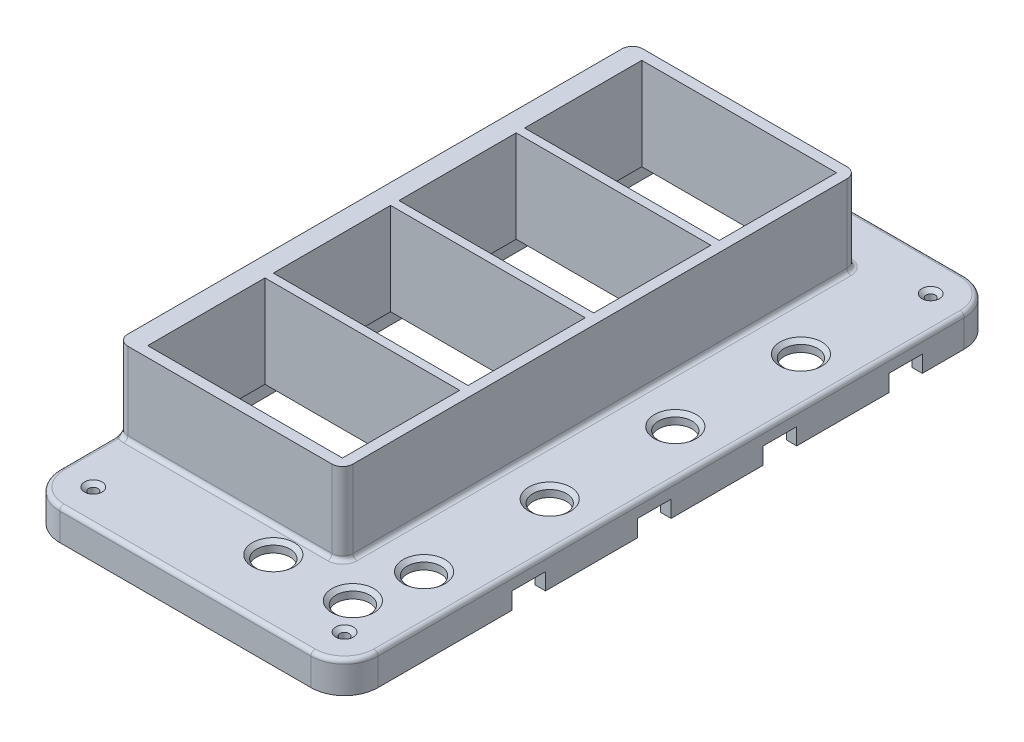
ISO-10303-21;
HEADER;
FILE_DESCRIPTION(('STEP AP214'),'2;1');
FILE_NAME('part.step','',(''),(''),'','','');
FILE_SCHEMA(('AUTOMOTIVE_DESIGN { 1 0 10303 214 1 1 1 1 }'));
ENDSEC;
DATA;
#1=APPLICATION_CONTEXT('core data for automotive mechanical design processes');
#2=APPLICATION_PROTOCOL_DEFINITION('international standard','automotive_design',2000,#1);
#3=PRODUCT_CONTEXT('',#1,'mechanical');
#4=PRODUCT('Part','Part','',(#3));
#5=PRODUCT_RELATED_PRODUCT_CATEGORY('part','',(#4));
#6=PRODUCT_DEFINITION_FORMATION('','',#4);
#7=PRODUCT_DEFINITION_CONTEXT('part definition',#1,'design');
#8=PRODUCT_DEFINITION('design','',#6,#7);
#9=PRODUCT_DEFINITION_SHAPE('','',#8);
#10=(LENGTH_UNIT() NAMED_UNIT(*) SI_UNIT(.MILLI.,.METRE.));
#11=(NAMED_UNIT(*) PLANE_ANGLE_UNIT() SI_UNIT($,.RADIAN.));
#12=(NAMED_UNIT(*) SI_UNIT($,.STERADIAN.) SOLID_ANGLE_UNIT());
#13=UNCERTAINTY_MEASURE_WITH_UNIT(LENGTH_MEASURE(1.E-05),#10,'distance_accuracy_value','');
#14=(GEOMETRIC_REPRESENTATION_CONTEXT(3) GLOBAL_UNCERTAINTY_ASSIGNED_CONTEXT((#13)) GLOBAL_UNIT_ASSIGNED_CONTEXT((#10,
#11,#12)) REPRESENTATION_CONTEXT('',''));
#15=CARTESIAN_POINT('',(0.,0.,0.));
#16=DIRECTION('',(0.,0.,1.));
#17=DIRECTION('',(1.,0.,0.));
#18=AXIS2_PLACEMENT_3D('',#15,#16,#17);
#19=CARTESIAN_POINT('',(0.,0.,0.));
#20=DIRECTION('',(0.,-1.,0.));
#21=DIRECTION('',(0.,0.,-1.));
#22=AXIS2_PLACEMENT_3D('',#19,#20,#21);
#23=PLANE('',#22);
#24=DIRECTION('',(-1.,0.,0.));
#25=VECTOR('',#24,1.);
#26=CARTESIAN_POINT('',(38.,0.,-52.));
#27=LINE('',#26,#25);
#28=CARTESIAN_POINT('',(38.,0.,-52.));
#29=VERTEX_POINT('',#28);
#30=CARTESIAN_POINT('',(35.5,0.,-52.));
#31=VERTEX_POINT('',#30);
#32=EDGE_CURVE('E496',#29,#31,#27,.T.);
#33=ORIENTED_EDGE('',*,*,#32,.F.);
#34=DIRECTION('',(0.,0.,-1.));
#35=VECTOR('',#34,1.);
#36=CARTESIAN_POINT('',(38.,0.,78.));
#37=LINE('',#36,#35);
#38=CARTESIAN_POINT('',(38.,0.,-30.));
#39=VERTEX_POINT('',#38);
#40=EDGE_CURVE('E481',#39,#29,#37,.T.);
#41=ORIENTED_EDGE('',*,*,#40,.F.);
#42=DIRECTION('',(-1.,0.,0.));
#43=VECTOR('',#42,1.);
#44=CARTESIAN_POINT('',(38.,0.,-30.));
#45=LINE('',#44,#43);
#46=CARTESIAN_POINT('',(35.5,0.,-30.));
#47=VERTEX_POINT('',#46);
#48=EDGE_CURVE('E493',#39,#47,#45,.T.);
#49=ORIENTED_EDGE('',*,*,#48,.T.);
#50=DIRECTION('',(0.,0.,-1.));
#51=VECTOR('',#50,1.);
#52=CARTESIAN_POINT('',(35.5,0.,75.5));
#53=LINE('',#52,#51);
#54=EDGE_CURVE('E2596',#47,#31,#53,.T.);
#55=ORIENTED_EDGE('',*,*,#54,.T.);
#56=EDGE_LOOP('',(#33,#41,#49,#55));
#57=FACE_BOUND('',#56,.T.);
#58=ADVANCED_FACE('F43',(#57),#23,.T.);
#59=DIRECTION('',(0.,0.,1.));
#60=VECTOR('',#59,1.);
#61=CARTESIAN_POINT('',(-38.,0.,78.));
#62=LINE('',#61,#60);
#63=CARTESIAN_POINT('',(-38.,0.,-70.));
#64=VERTEX_POINT('',#63);
#65=CARTESIAN_POINT('',(-38.,0.,70.));
#66=VERTEX_POINT('',#65);
#67=EDGE_CURVE('E887',#64,#66,#62,.T.);
#68=ORIENTED_EDGE('',*,*,#67,.F.);
#69=CARTESIAN_POINT('',(-30.,0.,-70.));
#70=DIRECTION('',(0.,-1.,0.));
#71=DIRECTION('',(0.,0.,-1.));
#72=AXIS2_PLACEMENT_3D('',#69,#70,#71);
#73=CIRCLE('',#72,8.);
#74=CARTESIAN_POINT('',(-30.,0.,-78.));
#75=VERTEX_POINT('',#74);
#76=EDGE_CURVE('E911',#64,#75,#73,.T.);
#77=ORIENTED_EDGE('',*,*,#76,.T.);
#78=DIRECTION('',(-1.,0.,0.));
#79=VECTOR('',#78,1.);
#80=CARTESIAN_POINT('',(-38.,0.,-78.));
#81=LINE('',#80,#79);
#82=CARTESIAN_POINT('',(30.,0.,-78.));
#83=VERTEX_POINT('',#82);
#84=EDGE_CURVE('E882',#83,#75,#81,.T.);
#85=ORIENTED_EDGE('',*,*,#84,.F.);
#86=CARTESIAN_POINT('',(30.,0.,-70.));
#87=DIRECTION('',(0.,-1.,0.));
#88=DIRECTION('',(0.,0.,-1.));
#89=AXIS2_PLACEMENT_3D('',#86,#87,#88);
#90=CIRCLE('',#89,8.);
#91=CARTESIAN_POINT('',(38.,0.,-70.));
#92=VERTEX_POINT('',#91);
#93=EDGE_CURVE('E908',#83,#92,#90,.T.);
#94=ORIENTED_EDGE('',*,*,#93,.T.);
#95=CARTESIAN_POINT('',(38.,0.,-60.));
#96=VERTEX_POINT('',#95);
#97=EDGE_CURVE('E863',#96,#92,#37,.T.);
#98=ORIENTED_EDGE('',*,*,#97,.F.);
#99=DIRECTION('',(-1.,0.,0.));
#100=VECTOR('',#99,1.);
#101=CARTESIAN_POINT('',(38.,0.,-60.));
#102=LINE('',#101,#100);
#103=CARTESIAN_POINT('',(35.5,0.,-60.));
#104=VERTEX_POINT('',#103);
#105=EDGE_CURVE('E500',#96,#104,#102,.T.);
#106=ORIENTED_EDGE('',*,*,#105,.T.);
#107=CARTESIAN_POINT('',(35.5,0.,-70.));
#108=VERTEX_POINT('',#107);
#109=EDGE_CURVE('E867',#104,#108,#53,.T.);
#110=ORIENTED_EDGE('',*,*,#109,.T.);
#111=CARTESIAN_POINT('',(30.,0.,-70.));
#112=DIRECTION('',(0.,-1.,0.));
#113=DIRECTION('',(0.,0.,-1.));
#114=AXIS2_PLACEMENT_3D('',#111,#112,#113);
#115=CIRCLE('',#114,5.5);
#116=CARTESIAN_POINT('',(30.,0.,-75.5));
#117=VERTEX_POINT('',#116);
#118=EDGE_CURVE('E982',#108,#117,#115,.F.);
#119=ORIENTED_EDGE('',*,*,#118,.T.);
#120=DIRECTION('',(-1.,0.,0.));
#121=VECTOR('',#120,1.);
#122=CARTESIAN_POINT('',(-35.5,0.,-75.5));
#123=LINE('',#122,#121);
#124=CARTESIAN_POINT('',(-30.,0.,-75.5));
#125=VERTEX_POINT('',#124);
#126=EDGE_CURVE('E871',#117,#125,#123,.T.);
#127=ORIENTED_EDGE('',*,*,#126,.T.);
#128=CARTESIAN_POINT('',(-30.,0.,-70.));
#129=DIRECTION('',(0.,-1.,0.));
#130=DIRECTION('',(0.,0.,-1.));
#131=AXIS2_PLACEMENT_3D('',#128,#129,#130);
#132=CIRCLE('',#131,5.5);
#133=CARTESIAN_POINT('',(-35.5,0.,-70.));
#134=VERTEX_POINT('',#133);
#135=EDGE_CURVE('E979',#125,#134,#132,.F.);
#136=ORIENTED_EDGE('',*,*,#135,.T.);
#137=DIRECTION('',(0.,0.,1.));
#138=VECTOR('',#137,1.);
#139=CARTESIAN_POINT('',(-35.5,0.,75.5));
#140=LINE('',#139,#138);
#141=CARTESIAN_POINT('',(-35.5,0.,70.));
#142=VERTEX_POINT('',#141);
#143=EDGE_CURVE('E851',#134,#142,#140,.T.);
#144=ORIENTED_EDGE('',*,*,#143,.T.);
#145=CARTESIAN_POINT('',(-30.,0.,70.));
#146=DIRECTION('',(0.,-1.,0.));
#147=DIRECTION('',(0.,0.,-1.));
#148=AXIS2_PLACEMENT_3D('',#145,#146,#147);
#149=CIRCLE('',#148,5.5);
#150=CARTESIAN_POINT('',(-30.,0.,75.5));
#151=VERTEX_POINT('',#150);
#152=EDGE_CURVE('E976',#142,#151,#149,.F.);
#153=ORIENTED_EDGE('',*,*,#152,.T.);
#154=DIRECTION('',(1.,0.,0.));
#155=VECTOR('',#154,1.);
#156=CARTESIAN_POINT('',(-35.5,0.,75.5));
#157=LINE('',#156,#155);
#158=CARTESIAN_POINT('',(30.,0.,75.5));
#159=VERTEX_POINT('',#158);
#160=EDGE_CURVE('E845',#151,#159,#157,.T.);
#161=ORIENTED_EDGE('',*,*,#160,.T.);
#162=CARTESIAN_POINT('',(30.,0.,70.));
#163=DIRECTION('',(0.,-1.,0.));
#164=DIRECTION('',(0.,0.,-1.));
#165=AXIS2_PLACEMENT_3D('',#162,#163,#164);
#166=CIRCLE('',#165,5.5);
#167=CARTESIAN_POINT('',(35.5,0.,70.));
#168=VERTEX_POINT('',#167);
#169=EDGE_CURVE('E973',#159,#168,#166,.F.);
#170=ORIENTED_EDGE('',*,*,#169,.T.);
#171=CARTESIAN_POINT('',(35.5,0.,38.));
#172=VERTEX_POINT('',#171);
#173=EDGE_CURVE('E868',#168,#172,#53,.T.);
#174=ORIENTED_EDGE('',*,*,#173,.T.);
#175=DIRECTION('',(-1.,0.,0.));
#176=VECTOR('',#175,1.);
#177=CARTESIAN_POINT('',(38.,0.,38.));
#178=LINE('',#177,#176);
#179=CARTESIAN_POINT('',(38.,0.,38.));
#180=VERTEX_POINT('',#179);
#181=EDGE_CURVE('E590',#180,#172,#178,.T.);
#182=ORIENTED_EDGE('',*,*,#181,.F.);
#183=CARTESIAN_POINT('',(38.,0.,70.));
#184=VERTEX_POINT('',#183);
#185=EDGE_CURVE('E879',#184,#180,#37,.T.);
#186=ORIENTED_EDGE('',*,*,#185,.F.);
#187=CARTESIAN_POINT('',(30.,0.,70.));
#188=DIRECTION('',(0.,-1.,0.));
#189=DIRECTION('',(0.,0.,-1.));
#190=AXIS2_PLACEMENT_3D('',#187,#188,#189);
#191=CIRCLE('',#190,8.);
#192=CARTESIAN_POINT('',(30.,0.,78.));
#193=VERTEX_POINT('',#192);
#194=EDGE_CURVE('E905',#184,#193,#191,.T.);
#195=ORIENTED_EDGE('',*,*,#194,.T.);
#196=DIRECTION('',(1.,0.,0.));
#197=VECTOR('',#196,1.);
#198=CARTESIAN_POINT('',(-38.,0.,78.));
#199=LINE('',#198,#197);
#200=CARTESIAN_POINT('',(-30.,0.,78.));
#201=VERTEX_POINT('',#200);
#202=EDGE_CURVE('E891',#201,#193,#199,.T.);
#203=ORIENTED_EDGE('',*,*,#202,.F.);
#204=CARTESIAN_POINT('',(-30.,0.,70.));
#205=DIRECTION('',(0.,-1.,0.));
#206=DIRECTION('',(0.,0.,-1.));
#207=AXIS2_PLACEMENT_3D('',#204,#205,#206);
#208=CIRCLE('',#207,8.);
#209=EDGE_CURVE('E902',#201,#66,#208,.T.);
#210=ORIENTED_EDGE('',*,*,#209,.T.);
#211=EDGE_LOOP('',(#68,#77,#85,#94,#98,#106,#110,#119,#127,#136,#144,#153,#161,#170,#174,#182,
#186,#195,#203,#210));
#212=FACE_BOUND('',#211,.T.);
#213=ADVANCED_FACE('F1293',(#212),#23,.T.);
#214=DIRECTION('',(-1.,0.,0.));
#215=VECTOR('',#214,1.);
#216=CARTESIAN_POINT('',(38.,0.,-22.));
#217=LINE('',#216,#215);
#218=CARTESIAN_POINT('',(38.,0.,-22.));
#219=VERTEX_POINT('',#218);
#220=CARTESIAN_POINT('',(35.5,0.,-22.));
#221=VERTEX_POINT('',#220);
#222=EDGE_CURVE('E518',#219,#221,#217,.T.);
#223=ORIENTED_EDGE('',*,*,#222,.F.);
#224=CARTESIAN_POINT('',(38.,0.,0.));
#225=VERTEX_POINT('',#224);
#226=EDGE_CURVE('E1321',#225,#219,#37,.T.);
#227=ORIENTED_EDGE('',*,*,#226,.F.);
#228=DIRECTION('',(-1.,0.,0.));
#229=VECTOR('',#228,1.);
#230=CARTESIAN_POINT('',(38.,0.,0.));
#231=LINE('',#230,#229);
#232=CARTESIAN_POINT('',(35.5,0.,0.));
#233=VERTEX_POINT('',#232);
#234=EDGE_CURVE('E524',#225,#233,#231,.T.);
#235=ORIENTED_EDGE('',*,*,#234,.T.);
#236=EDGE_CURVE('E2599',#233,#221,#53,.T.);
#237=ORIENTED_EDGE('',*,*,#236,.T.);
#238=EDGE_LOOP('',(#223,#227,#235,#237));
#239=FACE_BOUND('',#238,.T.);
#240=ADVANCED_FACE('F1300',(#239),#23,.T.);
#241=DIRECTION('',(-1.,0.,0.));
#242=VECTOR('',#241,1.);
#243=CARTESIAN_POINT('',(38.,0.,8.));
#244=LINE('',#243,#242);
#245=CARTESIAN_POINT('',(38.,0.,8.));
#246=VERTEX_POINT('',#245);
#247=CARTESIAN_POINT('',(35.5,0.,7.99999999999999));
#248=VERTEX_POINT('',#247);
#249=EDGE_CURVE('E554',#246,#248,#244,.T.);
#250=ORIENTED_EDGE('',*,*,#249,.F.);
#251=CARTESIAN_POINT('',(38.,0.,30.));
#252=VERTEX_POINT('',#251);
#253=EDGE_CURVE('E883',#252,#246,#37,.T.);
#254=ORIENTED_EDGE('',*,*,#253,.F.);
#255=DIRECTION('',(-1.,0.,0.));
#256=VECTOR('',#255,1.);
#257=CARTESIAN_POINT('',(38.,0.,30.));
#258=LINE('',#257,#256);
#259=CARTESIAN_POINT('',(35.5,0.,30.));
#260=VERTEX_POINT('',#259);
#261=EDGE_CURVE('E560',#252,#260,#258,.T.);
#262=ORIENTED_EDGE('',*,*,#261,.T.);
#263=EDGE_CURVE('E872',#260,#248,#53,.T.);
#264=ORIENTED_EDGE('',*,*,#263,.T.);
#265=EDGE_LOOP('',(#250,#254,#262,#264));
#266=FACE_BOUND('',#265,.T.);
#267=ADVANCED_FACE('F1296',(#266),#23,.T.);
#268=CARTESIAN_POINT('',(38.,5.,78.));
#269=DIRECTION('',(-1.,0.,0.));
#270=DIRECTION('',(0.,0.,1.));
#271=AXIS2_PLACEMENT_3D('',#268,#269,#270);
#272=PLANE('',#271);
#273=DIRECTION('',(0.,-1.,0.));
#274=VECTOR('',#273,1.);
#275=CARTESIAN_POINT('',(38.,5.,-70.));
#276=LINE('',#275,#274);
#277=CARTESIAN_POINT('',(38.,6.5,-70.));
#278=VERTEX_POINT('',#277);
#279=EDGE_CURVE('E924',#92,#278,#276,.F.);
#280=ORIENTED_EDGE('',*,*,#279,.T.);
#281=DIRECTION('',(0.,0.,-1.));
#282=VECTOR('',#281,1.);
#283=CARTESIAN_POINT('',(38.,6.5,70.));
#284=LINE('',#283,#282);
#285=CARTESIAN_POINT('',(38.,6.5,70.));
#286=VERTEX_POINT('',#285);
#287=EDGE_CURVE('E1341',#278,#286,#284,.F.);
#288=ORIENTED_EDGE('',*,*,#287,.T.);
#289=DIRECTION('',(0.,-1.,0.));
#290=VECTOR('',#289,1.);
#291=CARTESIAN_POINT('',(38.,5.,70.));
#292=LINE('',#291,#290);
#293=EDGE_CURVE('E921',#286,#184,#292,.T.);
#294=ORIENTED_EDGE('',*,*,#293,.T.);
#295=ORIENTED_EDGE('',*,*,#185,.T.);
#296=DIRECTION('',(0.,1.,0.));
#297=VECTOR('',#296,1.);
#298=CARTESIAN_POINT('',(38.,4.,38.));
#299=LINE('',#298,#297);
#300=CARTESIAN_POINT('',(38.,4.,38.));
#301=VERTEX_POINT('',#300);
#302=EDGE_CURVE('E577',#180,#301,#299,.T.);
#303=ORIENTED_EDGE('',*,*,#302,.T.);
#304=DIRECTION('',(0.,0.,-1.));
#305=VECTOR('',#304,1.);
#306=CARTESIAN_POINT('',(38.,4.,30.));
#307=LINE('',#306,#305);
#308=CARTESIAN_POINT('',(38.,4.,30.));
#309=VERTEX_POINT('',#308);
#310=EDGE_CURVE('E581',#301,#309,#307,.T.);
#311=ORIENTED_EDGE('',*,*,#310,.T.);
#312=DIRECTION('',(0.,-1.,0.));
#313=VECTOR('',#312,1.);
#314=CARTESIAN_POINT('',(38.,4.,30.));
#315=LINE('',#314,#313);
#316=EDGE_CURVE('E586',#309,#252,#315,.T.);
#317=ORIENTED_EDGE('',*,*,#316,.T.);
#318=ORIENTED_EDGE('',*,*,#253,.T.);
#319=DIRECTION('',(0.,1.,0.));
#320=VECTOR('',#319,1.);
#321=CARTESIAN_POINT('',(38.,4.,8.));
#322=LINE('',#321,#320);
#323=CARTESIAN_POINT('',(38.,4.,8.));
#324=VERTEX_POINT('',#323);
#325=EDGE_CURVE('E541',#246,#324,#322,.T.);
#326=ORIENTED_EDGE('',*,*,#325,.T.);
#327=DIRECTION('',(0.,0.,-1.));
#328=VECTOR('',#327,1.);
#329=CARTESIAN_POINT('',(38.,4.,0.));
#330=LINE('',#329,#328);
#331=CARTESIAN_POINT('',(38.,4.,0.));
#332=VERTEX_POINT('',#331);
#333=EDGE_CURVE('E545',#324,#332,#330,.T.);
#334=ORIENTED_EDGE('',*,*,#333,.T.);
#335=DIRECTION('',(0.,-1.,0.));
#336=VECTOR('',#335,1.);
#337=CARTESIAN_POINT('',(38.,4.,0.));
#338=LINE('',#337,#336);
#339=EDGE_CURVE('E550',#332,#225,#338,.T.);
#340=ORIENTED_EDGE('',*,*,#339,.T.);
#341=ORIENTED_EDGE('',*,*,#226,.T.);
#342=DIRECTION('',(0.,1.,0.));
#343=VECTOR('',#342,1.);
#344=CARTESIAN_POINT('',(38.,4.,-22.));
#345=LINE('',#344,#343);
#346=CARTESIAN_POINT('',(38.,4.,-22.));
#347=VERTEX_POINT('',#346);
#348=EDGE_CURVE('E506',#219,#347,#345,.T.);
#349=ORIENTED_EDGE('',*,*,#348,.T.);
#350=DIRECTION('',(0.,0.,-1.));
#351=VECTOR('',#350,1.);
#352=CARTESIAN_POINT('',(38.,4.,-30.));
#353=LINE('',#352,#351);
#354=CARTESIAN_POINT('',(38.,4.,-30.));
#355=VERTEX_POINT('',#354);
#356=EDGE_CURVE('E510',#347,#355,#353,.T.);
#357=ORIENTED_EDGE('',*,*,#356,.T.);
#358=DIRECTION('',(0.,-1.,0.));
#359=VECTOR('',#358,1.);
#360=CARTESIAN_POINT('',(38.,4.,-30.));
#361=LINE('',#360,#359);
#362=EDGE_CURVE('E515',#355,#39,#361,.T.);
#363=ORIENTED_EDGE('',*,*,#362,.T.);
#364=ORIENTED_EDGE('',*,*,#40,.T.);
#365=DIRECTION('',(0.,1.,0.));
#366=VECTOR('',#365,1.);
#367=CARTESIAN_POINT('',(38.,4.,-52.));
#368=LINE('',#367,#366);
#369=CARTESIAN_POINT('',(38.,4.,-52.));
#370=VERTEX_POINT('',#369);
#371=EDGE_CURVE('E457',#29,#370,#368,.T.);
#372=ORIENTED_EDGE('',*,*,#371,.T.);
#373=DIRECTION('',(0.,0.,-1.));
#374=VECTOR('',#373,1.);
#375=CARTESIAN_POINT('',(38.,4.,-60.));
#376=LINE('',#375,#374);
#377=CARTESIAN_POINT('',(38.,4.,-60.));
#378=VERTEX_POINT('',#377);
#379=EDGE_CURVE('E469',#370,#378,#376,.T.);
#380=ORIENTED_EDGE('',*,*,#379,.T.);
#381=DIRECTION('',(0.,-1.,0.));
#382=VECTOR('',#381,1.);
#383=CARTESIAN_POINT('',(38.,4.,-60.));
#384=LINE('',#383,#382);
#385=EDGE_CURVE('E466',#378,#96,#384,.T.);
#386=ORIENTED_EDGE('',*,*,#385,.T.);
#387=ORIENTED_EDGE('',*,*,#97,.T.);
#388=EDGE_LOOP('',(#280,#288,#294,#295,#303,#311,#317,#318,#326,#334,#340,#341,#349,#357,#363,
#364,#372,#380,#386,#387));
#389=FACE_BOUND('',#388,.T.);
#390=ADVANCED_FACE('F478',(#389),#272,.F.);
#391=CARTESIAN_POINT('',(-38.,5.,-78.));
#392=DIRECTION('',(0.,0.,1.));
#393=DIRECTION('',(1.,0.,0.));
#394=AXIS2_PLACEMENT_3D('',#391,#392,#393);
#395=PLANE('',#394);
#396=DIRECTION('',(0.,-1.,0.));
#397=VECTOR('',#396,1.);
#398=CARTESIAN_POINT('',(-30.,5.,-78.));
#399=LINE('',#398,#397);
#400=CARTESIAN_POINT('',(-30.,6.5,-78.));
#401=VERTEX_POINT('',#400);
#402=EDGE_CURVE('E917',#75,#401,#399,.F.);
#403=ORIENTED_EDGE('',*,*,#402,.T.);
#404=DIRECTION('',(-1.,0.,0.));
#405=VECTOR('',#404,1.);
#406=CARTESIAN_POINT('',(30.,6.5,-78.));
#407=LINE('',#406,#405);
#408=CARTESIAN_POINT('',(30.,6.5,-78.));
#409=VERTEX_POINT('',#408);
#410=EDGE_CURVE('E1342',#401,#409,#407,.F.);
#411=ORIENTED_EDGE('',*,*,#410,.T.);
#412=DIRECTION('',(0.,-1.,0.));
#413=VECTOR('',#412,1.);
#414=CARTESIAN_POINT('',(30.,5.,-78.));
#415=LINE('',#414,#413);
#416=EDGE_CURVE('E914',#409,#83,#415,.T.);
#417=ORIENTED_EDGE('',*,*,#416,.T.);
#418=ORIENTED_EDGE('',*,*,#84,.T.);
#419=EDGE_LOOP('',(#403,#411,#417,#418));
#420=FACE_BOUND('',#419,.T.);
#421=ADVANCED_FACE('F1309',(#420),#395,.F.);
#422=CARTESIAN_POINT('',(-38.,5.,78.));
#423=DIRECTION('',(1.,0.,0.));
#424=DIRECTION('',(0.,0.,-1.));
#425=AXIS2_PLACEMENT_3D('',#422,#423,#424);
#426=PLANE('',#425);
#427=DIRECTION('',(0.,-1.,0.));
#428=VECTOR('',#427,1.);
#429=CARTESIAN_POINT('',(-38.,5.,-64.25));
#430=LINE('',#429,#428);
#431=CARTESIAN_POINT('',(-38.,27.,-64.25));
#432=VERTEX_POINT('',#431);
#433=CARTESIAN_POINT('',(-38.,8.5,-64.25));
#434=VERTEX_POINT('',#433);
#435=EDGE_CURVE('E988',#432,#434,#430,.T.);
#436=ORIENTED_EDGE('',*,*,#435,.T.);
#437=CARTESIAN_POINT('',(-38.,6.67000804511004,-68.2872776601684));
#438=CARTESIAN_POINT('',(-38.,7.73459631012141,-67.8472425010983));
#439=CARTESIAN_POINT('',(-36.8594834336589,7.58500402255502,-67.9090747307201));
#440=CARTESIAN_POINT('',(-38.,6.64129241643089,-68.2178135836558));
#441=CARTESIAN_POINT('',(-38.,7.71131274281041,-67.8190716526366));
#442=CARTESIAN_POINT('',(-36.8686997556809,7.57064620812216,-67.8709156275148));
#443=CARTESIAN_POINT('',(-38.,6.61623228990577,-68.1469095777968));
#444=CARTESIAN_POINT('',(-38.,7.68851754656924,-67.7888074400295));
#445=CARTESIAN_POINT('',(-36.8784931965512,7.55811614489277,-67.8317398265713));
#446=CARTESIAN_POINT('',(-38.,6.57343660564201,-68.0029945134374));
#447=CARTESIAN_POINT('',(-38.,7.64466834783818,-67.7241206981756));
#448=CARTESIAN_POINT('',(-36.8993270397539,7.53671830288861,-67.7516129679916));
#449=CARTESIAN_POINT('',(-38.,6.55569409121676,-67.9299855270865));
#450=CARTESIAN_POINT('',(-38.,7.62361916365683,-67.6897894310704));
#451=CARTESIAN_POINT('',(-36.9103662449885,7.52784704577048,-67.7106636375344));
#452=CARTESIAN_POINT('',(-38.,6.5136557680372,-67.7101355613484));
#453=CARTESIAN_POINT('',(-38.,7.5645000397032,-67.581739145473));
#454=CARTESIAN_POINT('',(-36.9452997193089,7.50682788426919,-67.5862113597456));
#455=CARTESIAN_POINT('',(-38.,6.50001361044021,-67.5611453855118));
#456=CARTESIAN_POINT('',(-38.,7.52924313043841,-67.5016650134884));
#457=CARTESIAN_POINT('',(-36.9711786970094,7.50000680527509,-67.5003816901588));
#458=CARTESIAN_POINT('',(-38.,6.49998641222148,-67.2636578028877));
#459=CARTESIAN_POINT('',(-38.,7.471634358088,-67.3255725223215));
#460=CARTESIAN_POINT('',(-37.0287733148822,7.49999320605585,-67.3243203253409));
#461=CARTESIAN_POINT('',(-38.,6.5135560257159,-67.1151599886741));
#462=CARTESIAN_POINT('',(-38.,7.44903371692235,-67.2304293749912));
#463=CARTESIAN_POINT('',(-37.0604791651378,7.50677801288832,-67.2340961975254));
#464=CARTESIAN_POINT('',(-38.,6.56520812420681,-66.8222657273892));
#465=CARTESIAN_POINT('',(-38.,7.4200663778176,-67.0259399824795));
#466=CARTESIAN_POINT('',(-37.1303092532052,7.53260406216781,-67.0491287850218));
#467=CARTESIAN_POINT('',(-38.,6.60333817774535,-66.677877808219));
#468=CARTESIAN_POINT('',(-38.,7.41328684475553,-66.9174190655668));
#469=CARTESIAN_POINT('',(-37.1684458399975,7.55166908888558,-66.9543770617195));
#470=CARTESIAN_POINT('',(-38.,6.68341867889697,-66.4464131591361));
#471=CARTESIAN_POINT('',(-38.,7.41741418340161,-66.7288255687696));
#472=CARTESIAN_POINT('',(-37.2363443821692,7.59170933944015,-66.7941079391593));
#473=CARTESIAN_POINT('',(-38.,6.719246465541,-66.3571306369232));
#474=CARTESIAN_POINT('',(-38.,7.4226833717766,-66.6532555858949));
#475=CARTESIAN_POINT('',(-37.264296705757,7.60962323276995,-66.7301055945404));
#476=CARTESIAN_POINT('',(-38.,6.79870183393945,-66.1820728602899));
#477=CARTESIAN_POINT('',(-38.,7.44109685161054,-66.4986062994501));
#478=CARTESIAN_POINT('',(-37.3225902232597,7.64935091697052,-66.5992831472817));
#479=CARTESIAN_POINT('',(-38.,6.84233171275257,-66.0962986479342));
#480=CARTESIAN_POINT('',(-38.,7.45406029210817,-66.4196836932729));
#481=CARTESIAN_POINT('',(-37.3529321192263,7.67116585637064,-66.5324622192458));
#482=CARTESIAN_POINT('',(-38.,6.93638583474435,-65.9285170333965));
#483=CARTESIAN_POINT('',(-38.,7.48783000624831,-66.2592324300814));
#484=CARTESIAN_POINT('',(-37.4155518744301,7.71819291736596,-66.3952749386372));
#485=CARTESIAN_POINT('',(-38.,6.98681458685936,-65.8465121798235));
#486=CARTESIAN_POINT('',(-38.,7.50845823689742,-66.1778053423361));
#487=CARTESIAN_POINT('',(-37.4478310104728,7.74340729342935,-66.3249062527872));
#488=CARTESIAN_POINT('',(-38.,7.09342566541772,-65.6863693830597));
#489=CARTESIAN_POINT('',(-38.,7.55719771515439,-66.0132810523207));
#490=CARTESIAN_POINT('',(-37.5135171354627,7.79671283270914,-66.1798603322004));
#491=CARTESIAN_POINT('',(-38.,7.14960754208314,-65.6082311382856));
#492=CARTESIAN_POINT('',(-38.,7.58514544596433,-65.9302221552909));
#493=CARTESIAN_POINT('',(-37.5469240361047,7.82480377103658,-66.1051834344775));
#494=CARTESIAN_POINT('',(-38.,7.30019072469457,-65.4121363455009));
#495=CARTESIAN_POINT('',(-38.,7.66543554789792,-65.7167321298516));
#496=CARTESIAN_POINT('',(-37.6328446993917,7.90009536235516,-65.9065998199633));
#497=CARTESIAN_POINT('',(-38.,7.39811426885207,-65.2968882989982));
#498=CARTESIAN_POINT('',(-38.,7.72297457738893,-65.5841754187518));
#499=CARTESIAN_POINT('',(-37.6853886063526,7.94905713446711,-65.7789076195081));
#500=CARTESIAN_POINT('',(-38.,7.60236310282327,-65.074108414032));
#501=CARTESIAN_POINT('',(-38.,7.85193189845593,-65.3189663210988));
#502=CARTESIAN_POINT('',(-37.7843851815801,8.05118155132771,-65.5087364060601));
#503=CARTESIAN_POINT('',(-38.,7.7086944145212,-64.9665822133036));
#504=CARTESIAN_POINT('',(-38.,7.92327823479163,-65.1856912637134));
#505=CARTESIAN_POINT('',(-37.8308334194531,8.10434720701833,-65.3662467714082));
#506=CARTESIAN_POINT('',(-38.,7.92677284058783,-64.7570239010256));
#507=CARTESIAN_POINT('',(-38.,8.07535055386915,-64.9203295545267));
#508=CARTESIAN_POINT('',(-37.9099672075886,8.213386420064,-65.0673774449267));
#509=CARTESIAN_POINT('',(-38.,8.03852540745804,-64.6549975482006));
#510=CARTESIAN_POINT('',(-38.,8.15649689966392,-64.7871622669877));
#511=CARTESIAN_POINT('',(-37.942638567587,8.26926270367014,-64.9109836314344));
#512=CARTESIAN_POINT('',(-38.,8.26459079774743,-64.4539229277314));
#513=CARTESIAN_POINT('',(-38.,8.32299206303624,-64.5226268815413));
#514=CARTESIAN_POINT('',(-37.98741839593,8.38229539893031,-64.5896872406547));
#515=CARTESIAN_POINT('',(-38.,8.37890307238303,-64.3548740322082));
#516=CARTESIAN_POINT('',(-38.,8.4091686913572,-64.3898459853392));
#517=CARTESIAN_POINT('',(-37.9995312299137,8.43945153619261,-64.4247864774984));
#518=CARTESIAN_POINT('',(-38.,8.49549251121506,-64.2539035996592));
#519=CARTESIAN_POINT('',(-38.,8.4966193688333,-64.2552048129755));
#520=CARTESIAN_POINT('',(-37.9999956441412,8.49774625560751,-64.2565060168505));
#521=CARTESIAN_POINT('',(-38.,8.49774625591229,-64.2519517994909));
#522=CARTESIAN_POINT('',(-38.,8.49830968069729,-64.252602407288));
#523=CARTESIAN_POINT('',(-38.0000000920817,8.49887312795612,-64.2532530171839));
#524=CARTESIAN_POINT('',(-38.,8.5,-64.25));
#525=CARTESIAN_POINT('',(-38.,8.5,-64.25));
#526=CARTESIAN_POINT('',(-38.,8.5,-64.25));
#527=(BOUNDED_SURFACE() B_SPLINE_SURFACE(3,2,((#437,#438,#439),(#440,#441,#442),(#443,#444,
#445),(#446,#447,#448),(#449,#450,#451),(#452,#453,#454),(#455,#456,#457),(#458,#459,#460),
(#461,#462,#463),(#464,#465,#466),(#467,#468,#469),(#470,#471,#472),(#473,#474,#475),(#476,#477,
#478),(#479,#480,#481),(#482,#483,#484),(#485,#486,#487),(#488,#489,#490),(#491,#492,#493),
(#494,#495,#496),(#497,#498,#499),(#500,#501,#502),(#503,#504,#505),(#506,#507,#508),(#509,#510,
#511),(#512,#513,#514),(#515,#516,#517),(#518,#519,#520),(#521,#522,#523),(#524,#525,#526)),
.UNSPECIFIED.,.F.,.F.,.F.) B_SPLINE_SURFACE_WITH_KNOTS((4,2,2,2,2,2,2,2,2,2,2,2,2,2,4),(3,3),
(0.,0.225276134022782,0.450337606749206,0.896245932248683,1.34141181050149,1.78744248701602,
2.07569506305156,2.36403264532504,2.65256239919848,2.94106961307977,3.39413024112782,
3.84751835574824,4.30137232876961,4.75512991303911,4.76407418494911),(0.,1.),
.UNSPECIFIED.) GEOMETRIC_REPRESENTATION_ITEM() RATIONAL_B_SPLINE_SURFACE(((1.,0.655546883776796,
1.),(1.,0.659061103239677,1.),(1.,0.662768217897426,1.),(1.,0.670581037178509,1.),(1.,
0.674686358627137,1.),(1.,0.687548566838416,1.),(1.,0.696916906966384,1.),(1.,0.71727968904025,
1.),(1.,0.728271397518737,1.),(1.,0.751859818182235,1.),(1.,0.764459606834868,1.),(1.,
0.786286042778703,1.),(1.,0.79512927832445,1.),(1.,0.813250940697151,1.),(1.,0.822529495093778,
1.),(1.,0.841346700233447,1.),(1.,0.850885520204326,1.),(1.,0.869971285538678,1.),(1.,
0.87951823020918,1.),(1.,0.903679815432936,1.),(1.,0.9180791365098,1.),(1.,0.944653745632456,
1.),(1.,0.95682741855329,1.),(1.,0.97728753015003,1.),(1.,0.985569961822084,1.),(1.,
0.996867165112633,1.),(1.,0.999883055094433,1.),(1.,0.999998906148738,1.),(1.,1.00000001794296,
1.),(1.,1.,1.))) REPRESENTATION_ITEM('') SURFACE());
#528=CARTESIAN_POINT('',(-38.,6.67000804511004,-68.2872776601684));
#529=CARTESIAN_POINT('',(-38.,6.64129241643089,-68.2178135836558));
#530=CARTESIAN_POINT('',(-38.,6.61623228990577,-68.1469095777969));
#531=CARTESIAN_POINT('',(-38.,6.57343660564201,-68.0029945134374));
#532=CARTESIAN_POINT('',(-38.,6.55569409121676,-67.9299855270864));
#533=CARTESIAN_POINT('',(-38.,6.5136557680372,-67.7101355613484));
#534=CARTESIAN_POINT('',(-38.,6.50001361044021,-67.5611453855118));
#535=CARTESIAN_POINT('',(-38.,6.49998641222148,-67.2636578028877));
#536=CARTESIAN_POINT('',(-38.,6.5135560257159,-67.1151599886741));
#537=CARTESIAN_POINT('',(-38.,6.56520812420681,-66.8222657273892));
#538=CARTESIAN_POINT('',(-38.,6.60333817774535,-66.677877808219));
#539=CARTESIAN_POINT('',(-38.,6.68341867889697,-66.4464131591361));
#540=CARTESIAN_POINT('',(-38.,6.719246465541,-66.3571306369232));
#541=CARTESIAN_POINT('',(-38.,6.79870183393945,-66.1820728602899));
#542=CARTESIAN_POINT('',(-38.,6.84233171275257,-66.0962986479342));
#543=CARTESIAN_POINT('',(-38.,6.93638583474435,-65.9285170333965));
#544=CARTESIAN_POINT('',(-38.,6.98681458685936,-65.8465121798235));
#545=CARTESIAN_POINT('',(-38.,7.09342566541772,-65.6863693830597));
#546=CARTESIAN_POINT('',(-38.,7.14960754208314,-65.6082311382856));
#547=CARTESIAN_POINT('',(-38.,7.30019072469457,-65.4121363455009));
#548=CARTESIAN_POINT('',(-38.,7.39811426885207,-65.2968882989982));
#549=CARTESIAN_POINT('',(-38.,7.60236310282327,-65.074108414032));
#550=CARTESIAN_POINT('',(-38.,7.7086944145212,-64.9665822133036));
#551=CARTESIAN_POINT('',(-38.,7.92677284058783,-64.7570239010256));
#552=CARTESIAN_POINT('',(-38.,8.03852540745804,-64.6549975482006));
#553=CARTESIAN_POINT('',(-38.,8.26459079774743,-64.4539229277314));
#554=CARTESIAN_POINT('',(-38.,8.37890307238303,-64.3548740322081));
#555=CARTESIAN_POINT('',(-38.,8.49549251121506,-64.2539035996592));
#556=CARTESIAN_POINT('',(-38.,8.49774625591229,-64.251951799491));
#557=CARTESIAN_POINT('',(-38.,8.5,-64.25));
#558=B_SPLINE_CURVE_WITH_KNOTS('',3,(#528,#529,#530,#531,#532,#533,#534,#535,#536,#537,#538,
#539,#540,#541,#542,#543,#544,#545,#546,#547,#548,#549,#550,#551,#552,#553,#554,#555,#556,#557),
.UNSPECIFIED.,.F.,.F.,(4,2,2,2,2,2,2,2,2,2,2,2,2,2,4),(0.,0.225276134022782,0.450337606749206,
0.896245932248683,1.34141181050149,1.78744248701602,2.07569506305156,2.36403264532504,
2.65256239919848,2.94106961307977,3.39413024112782,3.84751835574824,4.30137232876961,
4.75512991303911,4.76407418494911),.UNSPECIFIED.);
#559=CARTESIAN_POINT('',(-38.,6.5,-67.4122776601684));
#560=VERTEX_POINT('',#559);
#561=EDGE_CURVE('E1712',#434,#560,#558,.F.);
#562=ORIENTED_EDGE('',*,*,#561,.T.);
#563=DIRECTION('',(0.,0.,1.));
#564=VECTOR('',#563,1.);
#565=CARTESIAN_POINT('',(-38.,6.5,-70.));
#566=LINE('',#565,#564);
#567=CARTESIAN_POINT('',(-38.,6.5,-70.));
#568=VERTEX_POINT('',#567);
#569=EDGE_CURVE('E1170',#560,#568,#566,.F.);
#570=ORIENTED_EDGE('',*,*,#569,.T.);
#571=DIRECTION('',(0.,-1.,0.));
#572=VECTOR('',#571,1.);
#573=CARTESIAN_POINT('',(-38.,5.,-70.));
#574=LINE('',#573,#572);
#575=EDGE_CURVE('E899',#568,#64,#574,.T.);
#576=ORIENTED_EDGE('',*,*,#575,.T.);
#577=ORIENTED_EDGE('',*,*,#67,.T.);
#578=DIRECTION('',(0.,-1.,0.));
#579=VECTOR('',#578,1.);
#580=CARTESIAN_POINT('',(-38.,5.,70.));
#581=LINE('',#580,#579);
#582=CARTESIAN_POINT('',(-38.,6.5,70.));
#583=VERTEX_POINT('',#582);
#584=EDGE_CURVE('E895',#66,#583,#581,.F.);
#585=ORIENTED_EDGE('',*,*,#584,.T.);
#586=DIRECTION('',(0.,0.,1.));
#587=VECTOR('',#586,1.);
#588=CARTESIAN_POINT('',(-38.,6.5,56.1994897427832));
#589=LINE('',#588,#587);
#590=CARTESIAN_POINT('',(-38.,6.5,56.9122776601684));
#591=VERTEX_POINT('',#590);
#592=EDGE_CURVE('E1157',#583,#591,#589,.F.);
#593=ORIENTED_EDGE('',*,*,#592,.T.);
#594=CARTESIAN_POINT('',(-36.8594834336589,7.58500402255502,57.4090747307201));
#595=CARTESIAN_POINT('',(-38.,7.73459631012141,57.3472425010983));
#596=CARTESIAN_POINT('',(-38.,6.67000804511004,57.7872776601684));
#597=CARTESIAN_POINT('',(-36.8686997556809,7.57064620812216,57.3709156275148));
#598=CARTESIAN_POINT('',(-38.,7.71131274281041,57.3190716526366));
#599=CARTESIAN_POINT('',(-38.,6.64129241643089,57.7178135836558));
#600=CARTESIAN_POINT('',(-36.8784931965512,7.55811614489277,57.3317398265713));
#601=CARTESIAN_POINT('',(-38.,7.68851754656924,57.2888074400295));
#602=CARTESIAN_POINT('',(-38.,6.61623228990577,57.6469095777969));
#603=CARTESIAN_POINT('',(-36.8993270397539,7.53671830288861,57.2516129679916));
#604=CARTESIAN_POINT('',(-38.,7.64466834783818,57.2241206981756));
#605=CARTESIAN_POINT('',(-38.,6.57343660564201,57.5029945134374));
#606=CARTESIAN_POINT('',(-36.9103662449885,7.52784704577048,57.2106636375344));
#607=CARTESIAN_POINT('',(-38.,7.62361916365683,57.1897894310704));
#608=CARTESIAN_POINT('',(-38.,6.55569409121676,57.4299855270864));
#609=CARTESIAN_POINT('',(-36.9452997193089,7.50682788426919,57.0862113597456));
#610=CARTESIAN_POINT('',(-38.,7.5645000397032,57.081739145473));
#611=CARTESIAN_POINT('',(-38.,6.5136557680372,57.2101355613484));
#612=CARTESIAN_POINT('',(-36.9711786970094,7.50000680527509,57.0003816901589));
#613=CARTESIAN_POINT('',(-38.,7.52924313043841,57.0016650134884));
#614=CARTESIAN_POINT('',(-38.,6.50001361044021,57.0611453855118));
#615=CARTESIAN_POINT('',(-37.0287733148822,7.49999320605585,56.8243203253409));
#616=CARTESIAN_POINT('',(-38.,7.471634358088,56.8255725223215));
#617=CARTESIAN_POINT('',(-38.,6.49998641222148,56.7636578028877));
#618=CARTESIAN_POINT('',(-37.0604791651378,7.50677801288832,56.7340961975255));
#619=CARTESIAN_POINT('',(-38.,7.44903371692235,56.7304293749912));
#620=CARTESIAN_POINT('',(-38.,6.5135560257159,56.6151599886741));
#621=CARTESIAN_POINT('',(-37.1303092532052,7.53260406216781,56.5491287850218));
#622=CARTESIAN_POINT('',(-38.,7.4200663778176,56.5259399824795));
#623=CARTESIAN_POINT('',(-38.,6.56520812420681,56.3222657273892));
#624=CARTESIAN_POINT('',(-37.1684458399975,7.55166908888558,56.4543770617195));
#625=CARTESIAN_POINT('',(-38.,7.41328684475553,56.4174190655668));
#626=CARTESIAN_POINT('',(-38.,6.60333817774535,56.177877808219));
#627=CARTESIAN_POINT('',(-37.2363443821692,7.59170933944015,56.2941079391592));
#628=CARTESIAN_POINT('',(-38.,7.41741418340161,56.2288255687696));
#629=CARTESIAN_POINT('',(-38.,6.68341867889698,55.9464131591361));
#630=CARTESIAN_POINT('',(-37.264296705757,7.60962323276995,56.2301055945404));
#631=CARTESIAN_POINT('',(-38.,7.4226833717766,56.1532555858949));
#632=CARTESIAN_POINT('',(-38.,6.71924646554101,55.8571306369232));
#633=CARTESIAN_POINT('',(-37.3225902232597,7.64935091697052,56.0992831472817));
#634=CARTESIAN_POINT('',(-38.,7.44109685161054,55.9986062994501));
#635=CARTESIAN_POINT('',(-38.,6.79870183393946,55.6820728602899));
#636=CARTESIAN_POINT('',(-37.3529321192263,7.67116585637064,56.0324622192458));
#637=CARTESIAN_POINT('',(-38.,7.45406029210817,55.9196836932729));
#638=CARTESIAN_POINT('',(-38.,6.84233171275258,55.5962986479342));
#639=CARTESIAN_POINT('',(-37.4155518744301,7.71819291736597,55.8952749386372));
#640=CARTESIAN_POINT('',(-38.,7.48783000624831,55.7592324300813));
#641=CARTESIAN_POINT('',(-38.,6.93638583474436,55.4285170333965));
#642=CARTESIAN_POINT('',(-37.4478310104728,7.74340729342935,55.8249062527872));
#643=CARTESIAN_POINT('',(-38.,7.50845823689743,55.6778053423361));
#644=CARTESIAN_POINT('',(-38.,6.98681458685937,55.3465121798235));
#645=CARTESIAN_POINT('',(-37.5135171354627,7.79671283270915,55.6798603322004));
#646=CARTESIAN_POINT('',(-38.,7.5571977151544,55.5132810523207));
#647=CARTESIAN_POINT('',(-38.,7.09342566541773,55.1863693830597));
#648=CARTESIAN_POINT('',(-37.5469240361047,7.82480377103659,55.6051834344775));
#649=CARTESIAN_POINT('',(-38.,7.58514544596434,55.4302221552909));
#650=CARTESIAN_POINT('',(-38.,7.14960754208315,55.1082311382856));
#651=CARTESIAN_POINT('',(-37.6328446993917,7.90009536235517,55.4065998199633));
#652=CARTESIAN_POINT('',(-38.,7.66543554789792,55.2167321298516));
#653=CARTESIAN_POINT('',(-38.,7.30019072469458,54.9121363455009));
#654=CARTESIAN_POINT('',(-37.6853886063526,7.94905713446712,55.2789076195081));
#655=CARTESIAN_POINT('',(-38.,7.72297457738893,55.0841754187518));
#656=CARTESIAN_POINT('',(-38.,7.39811426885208,54.7968882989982));
#657=CARTESIAN_POINT('',(-37.7843851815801,8.05118155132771,55.0087364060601));
#658=CARTESIAN_POINT('',(-38.,7.85193189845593,54.8189663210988));
#659=CARTESIAN_POINT('',(-38.,7.60236310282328,54.574108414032));
#660=CARTESIAN_POINT('',(-37.8308334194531,8.10434720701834,54.8662467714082));
#661=CARTESIAN_POINT('',(-38.,7.92327823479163,54.6856912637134));
#662=CARTESIAN_POINT('',(-38.,7.70869441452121,54.4665822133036));
#663=CARTESIAN_POINT('',(-37.9099672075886,8.213386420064,54.5673774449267));
#664=CARTESIAN_POINT('',(-38.,8.07535055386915,54.4203295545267));
#665=CARTESIAN_POINT('',(-38.,7.92677284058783,54.2570239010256));
#666=CARTESIAN_POINT('',(-37.942638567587,8.26926270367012,54.4109836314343));
#667=CARTESIAN_POINT('',(-38.,8.1564968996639,54.2871622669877));
#668=CARTESIAN_POINT('',(-38.,8.03852540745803,54.1549975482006));
#669=CARTESIAN_POINT('',(-37.98741839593,8.38229539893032,54.0896872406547));
#670=CARTESIAN_POINT('',(-38.,8.32299206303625,54.0226268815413));
#671=CARTESIAN_POINT('',(-38.,8.26459079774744,53.9539229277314));
#672=CARTESIAN_POINT('',(-37.9995312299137,8.43945153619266,53.9247864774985));
#673=CARTESIAN_POINT('',(-38.,8.40916869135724,53.8898459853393));
#674=CARTESIAN_POINT('',(-38.,8.37890307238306,53.8548740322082));
#675=CARTESIAN_POINT('',(-37.9999956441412,8.49774625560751,53.7565060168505));
#676=CARTESIAN_POINT('',(-38.,8.4966193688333,53.7552048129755));
#677=CARTESIAN_POINT('',(-38.,8.49549251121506,53.7539035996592));
#678=CARTESIAN_POINT('',(-38.0000000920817,8.49887312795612,53.7532530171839));
#679=CARTESIAN_POINT('',(-38.,8.49830968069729,53.7526024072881));
#680=CARTESIAN_POINT('',(-38.,8.49774625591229,53.7519517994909));
#681=CARTESIAN_POINT('',(-38.,8.5,53.75));
#682=CARTESIAN_POINT('',(-38.,8.5,53.75));
#683=CARTESIAN_POINT('',(-38.,8.5,53.75));
#684=(BOUNDED_SURFACE() B_SPLINE_SURFACE(3,2,((#594,#595,#596),(#597,#598,#599),(#600,#601,
#602),(#603,#604,#605),(#606,#607,#608),(#609,#610,#611),(#612,#613,#614),(#615,#616,#617),
(#618,#619,#620),(#621,#622,#623),(#624,#625,#626),(#627,#628,#629),(#630,#631,#632),(#633,#634,
#635),(#636,#637,#638),(#639,#640,#641),(#642,#643,#644),(#645,#646,#647),(#648,#649,#650),
(#651,#652,#653),(#654,#655,#656),(#657,#658,#659),(#660,#661,#662),(#663,#664,#665),(#666,#667,
#668),(#669,#670,#671),(#672,#673,#674),(#675,#676,#677),(#678,#679,#680),(#681,#682,#683)),
.UNSPECIFIED.,.F.,.F.,.F.) B_SPLINE_SURFACE_WITH_KNOTS((4,2,2,2,2,2,2,2,2,2,2,2,2,2,4),(3,3),
(0.,0.22527613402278,0.450337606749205,0.896245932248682,1.34141181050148,1.78744248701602,
2.07569506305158,2.36403264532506,2.6525623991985,2.94106961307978,3.39413024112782,
3.84751835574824,4.30137232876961,4.7551299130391,4.76407418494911),(0.,1.),
.UNSPECIFIED.) GEOMETRIC_REPRESENTATION_ITEM() RATIONAL_B_SPLINE_SURFACE(((1.,0.655546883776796,
1.),(1.,0.659061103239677,1.),(1.,0.662768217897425,1.),(1.,0.670581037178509,1.),(1.,
0.674686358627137,1.),(1.,0.687548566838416,1.),(1.,0.696916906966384,1.),(1.,0.71727968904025,
1.),(1.,0.728271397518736,1.),(1.,0.751859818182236,1.),(1.,0.76445960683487,1.),(1.,
0.786286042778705,1.),(1.,0.795129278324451,1.),(1.,0.813250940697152,1.),(1.,0.82252949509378,
1.),(1.,0.841346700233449,1.),(1.,0.850885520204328,1.),(1.,0.869971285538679,1.),(1.,
0.879518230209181,1.),(1.,0.903679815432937,1.),(1.,0.9180791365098,1.),(1.,0.944653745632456,
1.),(1.,0.956827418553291,1.),(1.,0.977287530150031,1.),(1.,0.985569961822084,1.),(1.,
0.996867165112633,1.),(1.,0.999883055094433,1.),(1.,0.999998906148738,1.),(1.,1.00000001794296,
1.),(1.,1.,1.))) REPRESENTATION_ITEM('') SURFACE());
#685=CARTESIAN_POINT('',(-38.,6.67000804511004,57.7872776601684));
#686=CARTESIAN_POINT('',(-38.,6.64129241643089,57.7178135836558));
#687=CARTESIAN_POINT('',(-38.,6.61623228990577,57.6469095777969));
#688=CARTESIAN_POINT('',(-38.,6.57343660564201,57.5029945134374));
#689=CARTESIAN_POINT('',(-38.,6.55569409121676,57.4299855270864));
#690=CARTESIAN_POINT('',(-38.,6.5136557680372,57.2101355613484));
#691=CARTESIAN_POINT('',(-38.,6.50001361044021,57.0611453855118));
#692=CARTESIAN_POINT('',(-38.,6.49998641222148,56.7636578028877));
#693=CARTESIAN_POINT('',(-38.,6.5135560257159,56.6151599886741));
#694=CARTESIAN_POINT('',(-38.,6.56520812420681,56.3222657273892));
#695=CARTESIAN_POINT('',(-38.,6.60333817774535,56.177877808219));
#696=CARTESIAN_POINT('',(-38.,6.68341867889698,55.9464131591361));
#697=CARTESIAN_POINT('',(-38.,6.71924646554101,55.8571306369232));
#698=CARTESIAN_POINT('',(-38.,6.79870183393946,55.6820728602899));
#699=CARTESIAN_POINT('',(-38.,6.84233171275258,55.5962986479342));
#700=CARTESIAN_POINT('',(-38.,6.93638583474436,55.4285170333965));
#701=CARTESIAN_POINT('',(-38.,6.98681458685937,55.3465121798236));
#702=CARTESIAN_POINT('',(-38.,7.09342566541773,55.1863693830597));
#703=CARTESIAN_POINT('',(-38.,7.14960754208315,55.1082311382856));
#704=CARTESIAN_POINT('',(-38.,7.30019072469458,54.9121363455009));
#705=CARTESIAN_POINT('',(-38.,7.39811426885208,54.7968882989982));
#706=CARTESIAN_POINT('',(-38.,7.60236310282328,54.574108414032));
#707=CARTESIAN_POINT('',(-38.,7.70869441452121,54.4665822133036));
#708=CARTESIAN_POINT('',(-38.,7.92677284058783,54.2570239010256));
#709=CARTESIAN_POINT('',(-38.,8.03852540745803,54.1549975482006));
#710=CARTESIAN_POINT('',(-38.,8.26459079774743,53.9539229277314));
#711=CARTESIAN_POINT('',(-38.,8.37890307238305,53.8548740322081));
#712=CARTESIAN_POINT('',(-38.,8.49549251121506,53.7539035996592));
#713=CARTESIAN_POINT('',(-38.,8.49774625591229,53.7519517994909));
#714=CARTESIAN_POINT('',(-38.,8.5,53.75));
#715=B_SPLINE_CURVE_WITH_KNOTS('',3,(#685,#686,#687,#688,#689,#690,#691,#692,#693,#694,#695,
#696,#697,#698,#699,#700,#701,#702,#703,#704,#705,#706,#707,#708,#709,#710,#711,#712,#713,#714),
.UNSPECIFIED.,.F.,.F.,(4,2,2,2,2,2,2,2,2,2,2,2,2,2,4),(0.,0.22527613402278,0.450337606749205,
0.896245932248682,1.34141181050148,1.78744248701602,2.07569506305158,2.36403264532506,
2.6525623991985,2.94106961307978,3.39413024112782,3.84751835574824,4.30137232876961,
4.7551299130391,4.76407418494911),.UNSPECIFIED.);
#716=CARTESIAN_POINT('',(-38.,8.5,53.75));
#717=VERTEX_POINT('',#716);
#718=EDGE_CURVE('E1160',#591,#717,#715,.T.);
#719=ORIENTED_EDGE('',*,*,#718,.T.);
#720=DIRECTION('',(0.,-1.,0.));
#721=VECTOR('',#720,1.);
#722=CARTESIAN_POINT('',(-38.,5.,53.75));
#723=LINE('',#722,#721);
#724=CARTESIAN_POINT('',(-38.,27.,53.75));
#725=VERTEX_POINT('',#724);
#726=EDGE_CURVE('E985',#717,#725,#723,.F.);
#727=ORIENTED_EDGE('',*,*,#726,.T.);
#728=DIRECTION('',(0.,0.,1.));
#729=VECTOR('',#728,1.);
#730=CARTESIAN_POINT('',(-38.,27.,-66.75));
#731=LINE('',#730,#729);
#732=EDGE_CURVE('E677',#432,#725,#731,.T.);
#733=ORIENTED_EDGE('',*,*,#732,.F.);
#734=EDGE_LOOP('',(#436,#562,#570,#576,#577,#585,#593,#719,#727,#733));
#735=FACE_BOUND('',#734,.T.);
#736=ADVANCED_FACE('F1172',(#735),#426,.F.);
#737=CARTESIAN_POINT('',(-38.,5.,78.));
#738=DIRECTION('',(0.,0.,-1.));
#739=DIRECTION('',(-1.,0.,0.));
#740=AXIS2_PLACEMENT_3D('',#737,#738,#739);
#741=PLANE('',#740);
#742=DIRECTION('',(0.,-1.,0.));
#743=VECTOR('',#742,1.);
#744=CARTESIAN_POINT('',(30.,5.,78.));
#745=LINE('',#744,#743);
#746=CARTESIAN_POINT('',(30.,6.5,78.));
#747=VERTEX_POINT('',#746);
#748=EDGE_CURVE('E930',#193,#747,#745,.F.);
#749=ORIENTED_EDGE('',*,*,#748,.T.);
#750=DIRECTION('',(1.,0.,0.));
#751=VECTOR('',#750,1.);
#752=CARTESIAN_POINT('',(-30.,6.5,78.));
#753=LINE('',#752,#751);
#754=CARTESIAN_POINT('',(-30.,6.5,78.));
#755=VERTEX_POINT('',#754);
#756=EDGE_CURVE('E60',#747,#755,#753,.F.);
#757=ORIENTED_EDGE('',*,*,#756,.T.);
#758=DIRECTION('',(0.,-1.,0.));
#759=VECTOR('',#758,1.);
#760=CARTESIAN_POINT('',(-30.,5.,78.));
#761=LINE('',#760,#759);
#762=EDGE_CURVE('E927',#755,#201,#761,.T.);
#763=ORIENTED_EDGE('',*,*,#762,.T.);
#764=ORIENTED_EDGE('',*,*,#202,.T.);
#765=EDGE_LOOP('',(#749,#757,#763,#764));
#766=FACE_BOUND('',#765,.T.);
#767=ADVANCED_FACE('F1636',(#766),#741,.F.);
#768=CARTESIAN_POINT('',(-35.5,5.,75.5));
#769=DIRECTION('',(0.,0.,-1.));
#770=DIRECTION('',(-1.,0.,0.));
#771=AXIS2_PLACEMENT_3D('',#768,#769,#770);
#772=PLANE('',#771);
#773=DIRECTION('',(1.,0.,0.));
#774=VECTOR('',#773,1.);
#775=CARTESIAN_POINT('',(-35.5,5.,75.5));
#776=LINE('',#775,#774);
#777=CARTESIAN_POINT('',(-30.,5.,75.5));
#778=VERTEX_POINT('',#777);
#779=CARTESIAN_POINT('',(30.,5.,75.5));
#780=VERTEX_POINT('',#779);
#781=EDGE_CURVE('E846',#778,#780,#776,.T.);
#782=ORIENTED_EDGE('',*,*,#781,.T.);
#783=DIRECTION('',(0.,-1.,0.));
#784=VECTOR('',#783,1.);
#785=CARTESIAN_POINT('',(30.,0.,75.5));
#786=LINE('',#785,#784);
#787=EDGE_CURVE('E936',#780,#159,#786,.T.);
#788=ORIENTED_EDGE('',*,*,#787,.T.);
#789=ORIENTED_EDGE('',*,*,#160,.F.);
#790=DIRECTION('',(0.,-1.,0.));
#791=VECTOR('',#790,1.);
#792=CARTESIAN_POINT('',(-30.,5.,75.5));
#793=LINE('',#792,#791);
#794=EDGE_CURVE('E933',#151,#778,#793,.F.);
#795=ORIENTED_EDGE('',*,*,#794,.T.);
#796=EDGE_LOOP('',(#782,#788,#789,#795));
#797=FACE_BOUND('',#796,.T.);
#798=ADVANCED_FACE('F1633',(#797),#772,.T.);
#799=CARTESIAN_POINT('',(35.5,5.,75.5));
#800=DIRECTION('',(-1.,0.,0.));
#801=DIRECTION('',(0.,0.,1.));
#802=AXIS2_PLACEMENT_3D('',#799,#800,#801);
#803=PLANE('',#802);
#804=ORIENTED_EDGE('',*,*,#173,.F.);
#805=DIRECTION('',(0.,-1.,0.));
#806=VECTOR('',#805,1.);
#807=CARTESIAN_POINT('',(35.5,5.,70.));
#808=LINE('',#807,#806);
#809=CARTESIAN_POINT('',(35.5,5.,70.));
#810=VERTEX_POINT('',#809);
#811=EDGE_CURVE('E944',#168,#810,#808,.F.);
#812=ORIENTED_EDGE('',*,*,#811,.T.);
#813=DIRECTION('',(0.,0.,-1.));
#814=VECTOR('',#813,1.);
#815=CARTESIAN_POINT('',(35.5,5.,75.5));
#816=LINE('',#815,#814);
#817=CARTESIAN_POINT('',(35.5,5.,-70.));
#818=VERTEX_POINT('',#817);
#819=EDGE_CURVE('E850',#810,#818,#816,.T.);
#820=ORIENTED_EDGE('',*,*,#819,.T.);
#821=DIRECTION('',(0.,-1.,0.));
#822=VECTOR('',#821,1.);
#823=CARTESIAN_POINT('',(35.5,0.,-70.));
#824=LINE('',#823,#822);
#825=EDGE_CURVE('E940',#818,#108,#824,.T.);
#826=ORIENTED_EDGE('',*,*,#825,.T.);
#827=ORIENTED_EDGE('',*,*,#109,.F.);
#828=DIRECTION('',(0.,-1.,0.));
#829=VECTOR('',#828,1.);
#830=CARTESIAN_POINT('',(35.5,4.,-60.));
#831=LINE('',#830,#829);
#832=CARTESIAN_POINT('',(35.5,4.,-60.));
#833=VERTEX_POINT('',#832);
#834=EDGE_CURVE('E483',#833,#104,#831,.T.);
#835=ORIENTED_EDGE('',*,*,#834,.F.);
#836=DIRECTION('',(0.,0.,-1.));
#837=VECTOR('',#836,1.);
#838=CARTESIAN_POINT('',(35.5,4.,-60.));
#839=LINE('',#838,#837);
#840=CARTESIAN_POINT('',(35.5,4.,-52.));
#841=VERTEX_POINT('',#840);
#842=EDGE_CURVE('E486',#841,#833,#839,.T.);
#843=ORIENTED_EDGE('',*,*,#842,.F.);
#844=DIRECTION('',(0.,1.,0.));
#845=VECTOR('',#844,1.);
#846=CARTESIAN_POINT('',(35.5,4.,-52.));
#847=LINE('',#846,#845);
#848=EDGE_CURVE('E460',#31,#841,#847,.T.);
#849=ORIENTED_EDGE('',*,*,#848,.F.);
#850=ORIENTED_EDGE('',*,*,#54,.F.);
#851=DIRECTION('',(0.,-1.,0.));
#852=VECTOR('',#851,1.);
#853=CARTESIAN_POINT('',(35.5,4.,-30.));
#854=LINE('',#853,#852);
#855=CARTESIAN_POINT('',(35.5,4.,-30.));
#856=VERTEX_POINT('',#855);
#857=EDGE_CURVE('E511',#856,#47,#854,.T.);
#858=ORIENTED_EDGE('',*,*,#857,.F.);
#859=DIRECTION('',(0.,0.,-1.));
#860=VECTOR('',#859,1.);
#861=CARTESIAN_POINT('',(35.5,4.,-30.));
#862=LINE('',#861,#860);
#863=CARTESIAN_POINT('',(35.5,4.,-22.));
#864=VERTEX_POINT('',#863);
#865=EDGE_CURVE('E523',#864,#856,#862,.T.);
#866=ORIENTED_EDGE('',*,*,#865,.F.);
#867=DIRECTION('',(0.,1.,0.));
#868=VECTOR('',#867,1.);
#869=CARTESIAN_POINT('',(35.5,4.,-22.));
#870=LINE('',#869,#868);
#871=EDGE_CURVE('E519',#221,#864,#870,.T.);
#872=ORIENTED_EDGE('',*,*,#871,.F.);
#873=ORIENTED_EDGE('',*,*,#236,.F.);
#874=DIRECTION('',(0.,-1.,0.));
#875=VECTOR('',#874,1.);
#876=CARTESIAN_POINT('',(35.5,4.,0.));
#877=LINE('',#876,#875);
#878=CARTESIAN_POINT('',(35.5,4.,0.));
#879=VERTEX_POINT('',#878);
#880=EDGE_CURVE('E546',#879,#233,#877,.T.);
#881=ORIENTED_EDGE('',*,*,#880,.F.);
#882=DIRECTION('',(0.,0.,-1.));
#883=VECTOR('',#882,1.);
#884=CARTESIAN_POINT('',(35.5,4.,0.));
#885=LINE('',#884,#883);
#886=CARTESIAN_POINT('',(35.5,4.,8.));
#887=VERTEX_POINT('',#886);
#888=EDGE_CURVE('E559',#887,#879,#885,.T.);
#889=ORIENTED_EDGE('',*,*,#888,.F.);
#890=DIRECTION('',(0.,1.,0.));
#891=VECTOR('',#890,1.);
#892=CARTESIAN_POINT('',(35.5,4.,8.));
#893=LINE('',#892,#891);
#894=EDGE_CURVE('E555',#248,#887,#893,.T.);
#895=ORIENTED_EDGE('',*,*,#894,.F.);
#896=ORIENTED_EDGE('',*,*,#263,.F.);
#897=DIRECTION('',(0.,-1.,0.));
#898=VECTOR('',#897,1.);
#899=CARTESIAN_POINT('',(35.5,4.,30.));
#900=LINE('',#899,#898);
#901=CARTESIAN_POINT('',(35.5,4.,30.));
#902=VERTEX_POINT('',#901);
#903=EDGE_CURVE('E582',#902,#260,#900,.T.);
#904=ORIENTED_EDGE('',*,*,#903,.F.);
#905=DIRECTION('',(0.,0.,-1.));
#906=VECTOR('',#905,1.);
#907=CARTESIAN_POINT('',(35.5,4.,30.));
#908=LINE('',#907,#906);
#909=CARTESIAN_POINT('',(35.5,4.,38.));
#910=VERTEX_POINT('',#909);
#911=EDGE_CURVE('E595',#910,#902,#908,.T.);
#912=ORIENTED_EDGE('',*,*,#911,.F.);
#913=DIRECTION('',(0.,1.,0.));
#914=VECTOR('',#913,1.);
#915=CARTESIAN_POINT('',(35.5,4.,38.));
#916=LINE('',#915,#914);
#917=EDGE_CURVE('E591',#172,#910,#916,.T.);
#918=ORIENTED_EDGE('',*,*,#917,.F.);
#919=EDGE_LOOP('',(#804,#812,#820,#826,#827,#835,#843,#849,#850,#858,#866,#872,#873,#881,#889,
#895,#896,#904,#912,#918));
#920=FACE_BOUND('',#919,.T.);
#921=ADVANCED_FACE('F1630',(#920),#803,.T.);
#922=CARTESIAN_POINT('',(-35.5,5.,-75.5));
#923=DIRECTION('',(0.,0.,1.));
#924=DIRECTION('',(1.,0.,0.));
#925=AXIS2_PLACEMENT_3D('',#922,#923,#924);
#926=PLANE('',#925);
#927=DIRECTION('',(-1.,0.,0.));
#928=VECTOR('',#927,1.);
#929=CARTESIAN_POINT('',(-35.5,5.,-75.5));
#930=LINE('',#929,#928);
#931=CARTESIAN_POINT('',(30.,5.,-75.5));
#932=VERTEX_POINT('',#931);
#933=CARTESIAN_POINT('',(-30.,5.,-75.5));
#934=VERTEX_POINT('',#933);
#935=EDGE_CURVE('E855',#932,#934,#930,.T.);
#936=ORIENTED_EDGE('',*,*,#935,.T.);
#937=DIRECTION('',(0.,-1.,0.));
#938=VECTOR('',#937,1.);
#939=CARTESIAN_POINT('',(-30.,0.,-75.5));
#940=LINE('',#939,#938);
#941=EDGE_CURVE('E969',#934,#125,#940,.T.);
#942=ORIENTED_EDGE('',*,*,#941,.T.);
#943=ORIENTED_EDGE('',*,*,#126,.F.);
#944=DIRECTION('',(0.,-1.,0.));
#945=VECTOR('',#944,1.);
#946=CARTESIAN_POINT('',(30.,5.,-75.5));
#947=LINE('',#946,#945);
#948=EDGE_CURVE('E966',#117,#932,#947,.F.);
#949=ORIENTED_EDGE('',*,*,#948,.T.);
#950=EDGE_LOOP('',(#936,#942,#943,#949));
#951=FACE_BOUND('',#950,.T.);
#952=ADVANCED_FACE('F1626',(#951),#926,.T.);
#953=CARTESIAN_POINT('',(-35.5,5.,75.5));
#954=DIRECTION('',(1.,0.,0.));
#955=DIRECTION('',(0.,0.,-1.));
#956=AXIS2_PLACEMENT_3D('',#953,#954,#955);
#957=PLANE('',#956);
#958=DIRECTION('',(0.,0.,1.));
#959=VECTOR('',#958,1.);
#960=CARTESIAN_POINT('',(-35.5,5.,75.5));
#961=LINE('',#960,#959);
#962=CARTESIAN_POINT('',(-35.5,5.,-70.));
#963=VERTEX_POINT('',#962);
#964=CARTESIAN_POINT('',(-35.5,5.,70.));
#965=VERTEX_POINT('',#964);
#966=EDGE_CURVE('E859',#963,#965,#961,.T.);
#967=ORIENTED_EDGE('',*,*,#966,.T.);
#968=DIRECTION('',(0.,-1.,0.));
#969=VECTOR('',#968,1.);
#970=CARTESIAN_POINT('',(-35.5,0.,70.));
#971=LINE('',#970,#969);
#972=EDGE_CURVE('E962',#965,#142,#971,.T.);
#973=ORIENTED_EDGE('',*,*,#972,.T.);
#974=ORIENTED_EDGE('',*,*,#143,.F.);
#975=DIRECTION('',(0.,-1.,0.));
#976=VECTOR('',#975,1.);
#977=CARTESIAN_POINT('',(-35.5,5.,-70.));
#978=LINE('',#977,#976);
#979=EDGE_CURVE('E959',#134,#963,#978,.F.);
#980=ORIENTED_EDGE('',*,*,#979,.T.);
#981=EDGE_LOOP('',(#967,#973,#974,#980));
#982=FACE_BOUND('',#981,.T.);
#983=ADVANCED_FACE('F1376',(#982),#957,.T.);
#984=CARTESIAN_POINT('',(0.,7.5,0.));
#985=DIRECTION('',(0.,1.,0.));
#986=DIRECTION('',(0.,0.,1.));
#987=AXIS2_PLACEMENT_3D('',#984,#985,#986);
#988=PLANE('',#987);
#989=CARTESIAN_POINT('',(24.5,7.5,62.5));
#990=DIRECTION('',(0.,1.,0.));
#991=DIRECTION('',(0.,0.,1.));
#992=AXIS2_PLACEMENT_3D('',#989,#990,#991);
#993=CIRCLE('',#992,5.00000000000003);
#994=CARTESIAN_POINT('',(24.5,7.5,67.5));
#995=VERTEX_POINT('',#994);
#996=EDGE_CURVE('E53',#995,#995,#993,.F.);
#997=ORIENTED_EDGE('',*,*,#996,.T.);
#998=EDGE_LOOP('',(#997));
#999=FACE_BOUND('',#998,.T.);
#1000=CARTESIAN_POINT('',(5.5,7.5,62.5));
#1001=DIRECTION('',(0.,1.,0.));
#1002=DIRECTION('',(0.,0.,1.));
#1003=AXIS2_PLACEMENT_3D('',#1000,#1001,#1002);
#1004=CIRCLE('',#1003,5.00000000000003);
#1005=CARTESIAN_POINT('',(5.5,7.5,67.5));
#1006=VERTEX_POINT('',#1005);
#1007=EDGE_CURVE('E1362',#1006,#1006,#1004,.F.);
#1008=ORIENTED_EDGE('',*,*,#1007,.T.);
#1009=EDGE_LOOP('',(#1008));
#1010=FACE_BOUND('',#1009,.T.);
#1011=CARTESIAN_POINT('',(-30.,7.5,-70.));
#1012=DIRECTION('',(0.,1.,0.));
#1013=DIRECTION('',(0.,0.,1.));
#1014=AXIS2_PLACEMENT_3D('',#1011,#1012,#1013);
#1015=CIRCLE('',#1014,2.10000000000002);
#1016=CARTESIAN_POINT('',(-30.,7.5,-67.9));
#1017=VERTEX_POINT('',#1016);
#1018=EDGE_CURVE('E1125',#1017,#1017,#1015,.F.);
#1019=ORIENTED_EDGE('',*,*,#1018,.T.);
#1020=EDGE_LOOP('',(#1019));
#1021=FACE_BOUND('',#1020,.T.);
#1022=CARTESIAN_POINT('',(-30.,7.5,70.));
#1023=DIRECTION('',(0.,1.,0.));
#1024=DIRECTION('',(0.,0.,1.));
#1025=AXIS2_PLACEMENT_3D('',#1022,#1023,#1024);
#1026=CIRCLE('',#1025,2.10000000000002);
#1027=CARTESIAN_POINT('',(-30.,7.5,72.1));
#1028=VERTEX_POINT('',#1027);
#1029=EDGE_CURVE('E1121',#1028,#1028,#1026,.F.);
#1030=ORIENTED_EDGE('',*,*,#1029,.T.);
#1031=EDGE_LOOP('',(#1030));
#1032=FACE_BOUND('',#1031,.T.);
#1033=CARTESIAN_POINT('',(30.,7.5,70.));
#1034=DIRECTION('',(0.,1.,0.));
#1035=DIRECTION('',(0.,0.,1.));
#1036=AXIS2_PLACEMENT_3D('',#1033,#1034,#1035);
#1037=CIRCLE('',#1036,2.10000000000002);
#1038=CARTESIAN_POINT('',(30.,7.5,72.1));
#1039=VERTEX_POINT('',#1038);
#1040=EDGE_CURVE('E1117',#1039,#1039,#1037,.F.);
#1041=ORIENTED_EDGE('',*,*,#1040,.T.);
#1042=EDGE_LOOP('',(#1041));
#1043=FACE_BOUND('',#1042,.T.);
#1044=CARTESIAN_POINT('',(27.0000000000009,7.5,48.));
#1045=DIRECTION('',(0.,1.,0.));
#1046=DIRECTION('',(0.,0.,1.));
#1047=AXIS2_PLACEMENT_3D('',#1044,#1045,#1046);
#1048=CIRCLE('',#1047,5.00000000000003);
#1049=CARTESIAN_POINT('',(27.0000000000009,7.5,53.));
#1050=VERTEX_POINT('',#1049);
#1051=EDGE_CURVE('E1113',#1050,#1050,#1048,.F.);
#1052=ORIENTED_EDGE('',*,*,#1051,.T.);
#1053=EDGE_LOOP('',(#1052));
#1054=FACE_BOUND('',#1053,.T.);
#1055=CARTESIAN_POINT('',(27.0000000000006,7.5,18.));
#1056=DIRECTION('',(0.,1.,0.));
#1057=DIRECTION('',(0.,0.,1.));
#1058=AXIS2_PLACEMENT_3D('',#1055,#1056,#1057);
#1059=CIRCLE('',#1058,5.00000000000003);
#1060=CARTESIAN_POINT('',(27.0000000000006,7.5,23.));
#1061=VERTEX_POINT('',#1060);
#1062=EDGE_CURVE('E1109',#1061,#1061,#1059,.F.);
#1063=ORIENTED_EDGE('',*,*,#1062,.T.);
#1064=EDGE_LOOP('',(#1063));
#1065=FACE_BOUND('',#1064,.T.);
#1066=CARTESIAN_POINT('',(27.0000000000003,7.5,-12.));
#1067=DIRECTION('',(0.,1.,0.));
#1068=DIRECTION('',(0.,0.,1.));
#1069=AXIS2_PLACEMENT_3D('',#1066,#1067,#1068);
#1070=CIRCLE('',#1069,5.00000000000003);
#1071=CARTESIAN_POINT('',(27.0000000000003,7.5,-6.99999999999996));
#1072=VERTEX_POINT('',#1071);
#1073=EDGE_CURVE('E1105',#1072,#1072,#1070,.F.);
#1074=ORIENTED_EDGE('',*,*,#1073,.T.);
#1075=EDGE_LOOP('',(#1074));
#1076=FACE_BOUND('',#1075,.T.);
#1077=CARTESIAN_POINT('',(27.,7.5,-42.));
#1078=DIRECTION('',(0.,1.,0.));
#1079=DIRECTION('',(0.,0.,1.));
#1080=AXIS2_PLACEMENT_3D('',#1077,#1078,#1079);
#1081=CIRCLE('',#1080,5.00000000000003);
#1082=CARTESIAN_POINT('',(27.,7.5,-37.));
#1083=VERTEX_POINT('',#1082);
#1084=EDGE_CURVE('E1101',#1083,#1083,#1081,.F.);
#1085=ORIENTED_EDGE('',*,*,#1084,.T.);
#1086=EDGE_LOOP('',(#1085));
#1087=FACE_BOUND('',#1086,.T.);
#1088=CARTESIAN_POINT('',(30.,7.5,-70.));
#1089=DIRECTION('',(0.,1.,0.));
#1090=DIRECTION('',(0.,0.,1.));
#1091=AXIS2_PLACEMENT_3D('',#1088,#1089,#1090);
#1092=CIRCLE('',#1091,2.10000000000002);
#1093=CARTESIAN_POINT('',(30.,7.5,-67.9));
#1094=VERTEX_POINT('',#1093);
#1095=EDGE_CURVE('E1097',#1094,#1094,#1092,.F.);
#1096=ORIENTED_EDGE('',*,*,#1095,.T.);
#1097=EDGE_LOOP('',(#1096));
#1098=FACE_BOUND('',#1097,.T.);
#1099=CARTESIAN_POINT('',(-30.,7.5,-70.));
#1100=DIRECTION('',(0.,1.,0.));
#1101=DIRECTION('',(0.,0.,1.));
#1102=AXIS2_PLACEMENT_3D('',#1099,#1100,#1101);
#1103=CIRCLE('',#1102,7.);
#1104=CARTESIAN_POINT('',(-30.,7.5,-77.));
#1105=VERTEX_POINT('',#1104);
#1106=CARTESIAN_POINT('',(-37.,7.5,-70.));
#1107=VERTEX_POINT('',#1106);
#1108=EDGE_CURVE('E1397',#1105,#1107,#1103,.T.);
#1109=ORIENTED_EDGE('',*,*,#1108,.T.);
#1110=DIRECTION('',(0.,0.,1.));
#1111=VECTOR('',#1110,1.);
#1112=CARTESIAN_POINT('',(-37.,7.5,-66.6994897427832));
#1113=LINE('',#1112,#1111);
#1114=CARTESIAN_POINT('',(-37.,7.5,-67.4122776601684));
#1115=VERTEX_POINT('',#1114);
#1116=EDGE_CURVE('E1399',#1107,#1115,#1113,.T.);
#1117=ORIENTED_EDGE('',*,*,#1116,.T.);
#1118=CARTESIAN_POINT('',(-35.5,7.5,-64.25));
#1119=DIRECTION('',(0.,1.,0.));
#1120=DIRECTION('',(0.,0.,1.));
#1121=AXIS2_PLACEMENT_3D('',#1118,#1119,#1120);
#1122=CIRCLE('',#1121,3.5);
#1123=CARTESIAN_POINT('',(-35.5,7.5,-67.75));
#1124=VERTEX_POINT('',#1123);
#1125=EDGE_CURVE('E1034',#1115,#1124,#1122,.F.);
#1126=ORIENTED_EDGE('',*,*,#1125,.T.);
#1127=DIRECTION('',(-1.,0.,0.));
#1128=VECTOR('',#1127,1.);
#1129=CARTESIAN_POINT('',(0.,7.5,-67.75));
#1130=LINE('',#1129,#1128);
#1131=CARTESIAN_POINT('',(13.25,7.5,-67.75));
#1132=VERTEX_POINT('',#1131);
#1133=EDGE_CURVE('E1031',#1124,#1132,#1130,.F.);
#1134=ORIENTED_EDGE('',*,*,#1133,.T.);
#1135=CARTESIAN_POINT('',(13.25,7.5,-64.25));
#1136=DIRECTION('',(0.,1.,0.));
#1137=DIRECTION('',(0.,0.,1.));
#1138=AXIS2_PLACEMENT_3D('',#1135,#1136,#1137);
#1139=CIRCLE('',#1138,3.5);
#1140=CARTESIAN_POINT('',(16.75,7.5,-64.25));
#1141=VERTEX_POINT('',#1140);
#1142=EDGE_CURVE('E1028',#1132,#1141,#1139,.F.);
#1143=ORIENTED_EDGE('',*,*,#1142,.T.);
#1144=DIRECTION('',(0.,0.,-1.));
#1145=VECTOR('',#1144,1.);
#1146=CARTESIAN_POINT('',(16.75,7.5,0.));
#1147=LINE('',#1146,#1145);
#1148=CARTESIAN_POINT('',(16.75,7.5,53.75));
#1149=VERTEX_POINT('',#1148);
#1150=EDGE_CURVE('E1025',#1141,#1149,#1147,.F.);
#1151=ORIENTED_EDGE('',*,*,#1150,.T.);
#1152=CARTESIAN_POINT('',(13.25,7.5,53.75));
#1153=DIRECTION('',(0.,1.,0.));
#1154=DIRECTION('',(0.,0.,1.));
#1155=AXIS2_PLACEMENT_3D('',#1152,#1153,#1154);
#1156=CIRCLE('',#1155,3.5);
#1157=CARTESIAN_POINT('',(13.25,7.5,57.25));
#1158=VERTEX_POINT('',#1157);
#1159=EDGE_CURVE('E1037',#1149,#1158,#1156,.F.);
#1160=ORIENTED_EDGE('',*,*,#1159,.T.);
#1161=DIRECTION('',(1.,0.,0.));
#1162=VECTOR('',#1161,1.);
#1163=CARTESIAN_POINT('',(0.,7.5,57.25));
#1164=LINE('',#1163,#1162);
#1165=CARTESIAN_POINT('',(-35.5,7.5,57.25));
#1166=VERTEX_POINT('',#1165);
#1167=EDGE_CURVE('E1040',#1158,#1166,#1164,.F.);
#1168=ORIENTED_EDGE('',*,*,#1167,.T.);
#1169=CARTESIAN_POINT('',(-35.5,7.5,53.75));
#1170=DIRECTION('',(0.,1.,0.));
#1171=DIRECTION('',(0.,0.,1.));
#1172=AXIS2_PLACEMENT_3D('',#1169,#1170,#1171);
#1173=CIRCLE('',#1172,3.5);
#1174=CARTESIAN_POINT('',(-37.,7.5,56.9122776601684));
#1175=VERTEX_POINT('',#1174);
#1176=EDGE_CURVE('E1043',#1166,#1175,#1173,.F.);
#1177=ORIENTED_EDGE('',*,*,#1176,.T.);
#1178=DIRECTION('',(0.,0.,1.));
#1179=VECTOR('',#1178,1.);
#1180=CARTESIAN_POINT('',(-37.,7.5,70.));
#1181=LINE('',#1180,#1179);
#1182=CARTESIAN_POINT('',(-37.,7.5,70.));
#1183=VERTEX_POINT('',#1182);
#1184=EDGE_CURVE('E1696',#1175,#1183,#1181,.T.);
#1185=ORIENTED_EDGE('',*,*,#1184,.T.);
#1186=CARTESIAN_POINT('',(-30.,7.5,70.));
#1187=DIRECTION('',(0.,1.,0.));
#1188=DIRECTION('',(0.,0.,1.));
#1189=AXIS2_PLACEMENT_3D('',#1186,#1187,#1188);
#1190=CIRCLE('',#1189,7.);
#1191=CARTESIAN_POINT('',(-30.,7.5,77.));
#1192=VERTEX_POINT('',#1191);
#1193=EDGE_CURVE('E1670',#1183,#1192,#1190,.T.);
#1194=ORIENTED_EDGE('',*,*,#1193,.T.);
#1195=DIRECTION('',(1.,0.,0.));
#1196=VECTOR('',#1195,1.);
#1197=CARTESIAN_POINT('',(30.,7.5,77.));
#1198=LINE('',#1197,#1196);
#1199=CARTESIAN_POINT('',(30.,7.5,77.));
#1200=VERTEX_POINT('',#1199);
#1201=EDGE_CURVE('E1669',#1192,#1200,#1198,.T.);
#1202=ORIENTED_EDGE('',*,*,#1201,.T.);
#1203=CARTESIAN_POINT('',(30.,7.5,70.));
#1204=DIRECTION('',(0.,1.,0.));
#1205=DIRECTION('',(0.,0.,1.));
#1206=AXIS2_PLACEMENT_3D('',#1203,#1204,#1205);
#1207=CIRCLE('',#1206,7.);
#1208=CARTESIAN_POINT('',(37.,7.5,70.));
#1209=VERTEX_POINT('',#1208);
#1210=EDGE_CURVE('E1667',#1200,#1209,#1207,.T.);
#1211=ORIENTED_EDGE('',*,*,#1210,.T.);
#1212=DIRECTION('',(0.,0.,-1.));
#1213=VECTOR('',#1212,1.);
#1214=CARTESIAN_POINT('',(37.,7.5,-70.));
#1215=LINE('',#1214,#1213);
#1216=CARTESIAN_POINT('',(37.,7.5,-70.));
#1217=VERTEX_POINT('',#1216);
#1218=EDGE_CURVE('E1687',#1209,#1217,#1215,.T.);
#1219=ORIENTED_EDGE('',*,*,#1218,.T.);
#1220=CARTESIAN_POINT('',(30.,7.5,-70.));
#1221=DIRECTION('',(0.,1.,0.));
#1222=DIRECTION('',(0.,0.,1.));
#1223=AXIS2_PLACEMENT_3D('',#1220,#1221,#1222);
#1224=CIRCLE('',#1223,7.);
#1225=CARTESIAN_POINT('',(30.,7.5,-77.));
#1226=VERTEX_POINT('',#1225);
#1227=EDGE_CURVE('E1684',#1217,#1226,#1224,.T.);
#1228=ORIENTED_EDGE('',*,*,#1227,.T.);
#1229=DIRECTION('',(-1.,0.,0.));
#1230=VECTOR('',#1229,1.);
#1231=CARTESIAN_POINT('',(-30.,7.5,-77.));
#1232=LINE('',#1231,#1230);
#1233=EDGE_CURVE('E1402',#1226,#1105,#1232,.T.);
#1234=ORIENTED_EDGE('',*,*,#1233,.T.);
#1235=EDGE_LOOP('',(#1109,#1117,#1126,#1134,#1143,#1151,#1160,#1168,#1177,#1185,#1194,#1202,
#1211,#1219,#1228,#1234));
#1236=FACE_BOUND('',#1235,.T.);
#1237=ADVANCED_FACE('F1372',(#999,#1010,#1021,#1032,#1043,#1054,#1065,#1076,#1087,#1098,#1236),
#988,.T.);
#1238=CARTESIAN_POINT('',(0.,5.,0.));
#1239=DIRECTION('',(0.,1.,0.));
#1240=DIRECTION('',(0.,0.,1.));
#1241=AXIS2_PLACEMENT_3D('',#1238,#1239,#1240);
#1242=PLANE('',#1241);
#1243=CARTESIAN_POINT('',(24.5,5.,62.5));
#1244=DIRECTION('',(0.,1.,0.));
#1245=DIRECTION('',(0.,0.,1.));
#1246=AXIS2_PLACEMENT_3D('',#1243,#1244,#1245);
#1247=CIRCLE('',#1246,4.);
#1248=CARTESIAN_POINT('',(24.5,5.,66.5));
#1249=VERTEX_POINT('',#1248);
#1250=EDGE_CURVE('E1368',#1249,#1249,#1247,.T.);
#1251=ORIENTED_EDGE('',*,*,#1250,.T.);
#1252=EDGE_LOOP('',(#1251));
#1253=FACE_BOUND('',#1252,.T.);
#1254=CARTESIAN_POINT('',(5.5,5.,62.5));
#1255=DIRECTION('',(0.,1.,0.));
#1256=DIRECTION('',(0.,0.,1.));
#1257=AXIS2_PLACEMENT_3D('',#1254,#1255,#1256);
#1258=CIRCLE('',#1257,4.);
#1259=CARTESIAN_POINT('',(5.5,5.,66.5));
#1260=VERTEX_POINT('',#1259);
#1261=EDGE_CURVE('E1273',#1260,#1260,#1258,.T.);
#1262=ORIENTED_EDGE('',*,*,#1261,.T.);
#1263=EDGE_LOOP('',(#1262));
#1264=FACE_BOUND('',#1263,.T.);
#1265=ORIENTED_EDGE('',*,*,#819,.F.);
#1266=CARTESIAN_POINT('',(30.,5.,70.));
#1267=DIRECTION('',(0.,1.,0.));
#1268=DIRECTION('',(0.,0.,1.));
#1269=AXIS2_PLACEMENT_3D('',#1266,#1267,#1268);
#1270=CIRCLE('',#1269,5.5);
#1271=EDGE_CURVE('E956',#810,#780,#1270,.F.);
#1272=ORIENTED_EDGE('',*,*,#1271,.T.);
#1273=ORIENTED_EDGE('',*,*,#781,.F.);
#1274=CARTESIAN_POINT('',(-30.,5.,70.));
#1275=DIRECTION('',(0.,1.,0.));
#1276=DIRECTION('',(0.,0.,1.));
#1277=AXIS2_PLACEMENT_3D('',#1274,#1275,#1276);
#1278=CIRCLE('',#1277,5.5);
#1279=EDGE_CURVE('E953',#778,#965,#1278,.F.);
#1280=ORIENTED_EDGE('',*,*,#1279,.T.);
#1281=ORIENTED_EDGE('',*,*,#966,.F.);
#1282=CARTESIAN_POINT('',(-30.,5.,-70.));
#1283=DIRECTION('',(0.,1.,0.));
#1284=DIRECTION('',(0.,0.,1.));
#1285=AXIS2_PLACEMENT_3D('',#1282,#1283,#1284);
#1286=CIRCLE('',#1285,5.5);
#1287=EDGE_CURVE('E950',#963,#934,#1286,.F.);
#1288=ORIENTED_EDGE('',*,*,#1287,.T.);
#1289=ORIENTED_EDGE('',*,*,#935,.F.);
#1290=CARTESIAN_POINT('',(30.,5.,-70.));
#1291=DIRECTION('',(0.,1.,0.));
#1292=DIRECTION('',(0.,0.,1.));
#1293=AXIS2_PLACEMENT_3D('',#1290,#1291,#1292);
#1294=CIRCLE('',#1293,5.5);
#1295=EDGE_CURVE('E947',#932,#818,#1294,.F.);
#1296=ORIENTED_EDGE('',*,*,#1295,.T.);
#1297=EDGE_LOOP('',(#1265,#1272,#1273,#1280,#1281,#1288,#1289,#1296));
#1298=FACE_BOUND('',#1297,.T.);
#1299=CARTESIAN_POINT('',(27.0000000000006,5.,18.));
#1300=DIRECTION('',(0.,1.,0.));
#1301=DIRECTION('',(0.,0.,1.));
#1302=AXIS2_PLACEMENT_3D('',#1299,#1300,#1301);
#1303=CIRCLE('',#1302,4.);
#1304=CARTESIAN_POINT('',(27.0000000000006,5.,22.));
#1305=VERTEX_POINT('',#1304);
#1306=EDGE_CURVE('E727',#1305,#1305,#1303,.T.);
#1307=ORIENTED_EDGE('',*,*,#1306,.T.);
#1308=EDGE_LOOP('',(#1307));
#1309=FACE_BOUND('',#1308,.T.);
#1310=DIRECTION('',(1.,0.,0.));
#1311=VECTOR('',#1310,1.);
#1312=CARTESIAN_POINT('',(-33.2499999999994,5.,23.75));
#1313=LINE('',#1312,#1311);
#1314=CARTESIAN_POINT('',(-33.2499999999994,5.,23.75));
#1315=VERTEX_POINT('',#1314);
#1316=CARTESIAN_POINT('',(13.2500000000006,5.,23.75));
#1317=VERTEX_POINT('',#1316);
#1318=EDGE_CURVE('E731',#1315,#1317,#1313,.T.);
#1319=ORIENTED_EDGE('',*,*,#1318,.T.);
#1320=DIRECTION('',(0.,0.,-1.));
#1321=VECTOR('',#1320,1.);
#1322=CARTESIAN_POINT('',(13.2500000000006,5.,23.75));
#1323=LINE('',#1322,#1321);
#1324=CARTESIAN_POINT('',(13.2500000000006,5.,-4.25));
#1325=VERTEX_POINT('',#1324);
#1326=EDGE_CURVE('E735',#1317,#1325,#1323,.T.);
#1327=ORIENTED_EDGE('',*,*,#1326,.T.);
#1328=DIRECTION('',(-1.,0.,0.));
#1329=VECTOR('',#1328,1.);
#1330=CARTESIAN_POINT('',(-33.2499999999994,5.,-4.25));
#1331=LINE('',#1330,#1329);
#1332=CARTESIAN_POINT('',(-33.2499999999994,5.,-4.25));
#1333=VERTEX_POINT('',#1332);
#1334=EDGE_CURVE('E739',#1325,#1333,#1331,.T.);
#1335=ORIENTED_EDGE('',*,*,#1334,.T.);
#1336=DIRECTION('',(0.,0.,1.));
#1337=VECTOR('',#1336,1.);
#1338=CARTESIAN_POINT('',(-33.2499999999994,5.,23.75));
#1339=LINE('',#1338,#1337);
#1340=EDGE_CURVE('E743',#1333,#1315,#1339,.T.);
#1341=ORIENTED_EDGE('',*,*,#1340,.T.);
#1342=EDGE_LOOP('',(#1319,#1327,#1335,#1341));
#1343=FACE_BOUND('',#1342,.T.);
#1344=CARTESIAN_POINT('',(27.,5.,-42.));
#1345=DIRECTION('',(0.,1.,0.));
#1346=DIRECTION('',(0.,0.,1.));
#1347=AXIS2_PLACEMENT_3D('',#1344,#1345,#1346);
#1348=CIRCLE('',#1347,4.);
#1349=CARTESIAN_POINT('',(27.,5.,-38.));
#1350=VERTEX_POINT('',#1349);
#1351=EDGE_CURVE('E795',#1350,#1350,#1348,.T.);
#1352=ORIENTED_EDGE('',*,*,#1351,.T.);
#1353=EDGE_LOOP('',(#1352));
#1354=FACE_BOUND('',#1353,.T.);
#1355=CARTESIAN_POINT('',(-30.,5.,70.));
#1356=DIRECTION('',(0.,1.,0.));
#1357=DIRECTION('',(0.,0.,-1.));
#1358=AXIS2_PLACEMENT_3D('',#1355,#1356,#1357);
#1359=CIRCLE('',#1358,1.1);
#1360=CARTESIAN_POINT('',(-30.,5.,68.9));
#1361=VERTEX_POINT('',#1360);
#1362=EDGE_CURVE('E799',#1361,#1361,#1359,.T.);
#1363=ORIENTED_EDGE('',*,*,#1362,.T.);
#1364=EDGE_LOOP('',(#1363));
#1365=FACE_BOUND('',#1364,.T.);
#1366=CARTESIAN_POINT('',(30.,5.,70.));
#1367=DIRECTION('',(0.,1.,0.));
#1368=DIRECTION('',(0.,0.,1.));
#1369=AXIS2_PLACEMENT_3D('',#1366,#1367,#1368);
#1370=CIRCLE('',#1369,1.1);
#1371=CARTESIAN_POINT('',(30.,5.,71.1));
#1372=VERTEX_POINT('',#1371);
#1373=EDGE_CURVE('E803',#1372,#1372,#1370,.T.);
#1374=ORIENTED_EDGE('',*,*,#1373,.T.);
#1375=EDGE_LOOP('',(#1374));
#1376=FACE_BOUND('',#1375,.T.);
#1377=CARTESIAN_POINT('',(30.,5.,-70.));
#1378=DIRECTION('',(0.,1.,0.));
#1379=DIRECTION('',(0.,0.,-1.));
#1380=AXIS2_PLACEMENT_3D('',#1377,#1378,#1379);
#1381=CIRCLE('',#1380,1.1);
#1382=CARTESIAN_POINT('',(30.,5.,-71.1));
#1383=VERTEX_POINT('',#1382);
#1384=EDGE_CURVE('E807',#1383,#1383,#1381,.T.);
#1385=ORIENTED_EDGE('',*,*,#1384,.T.);
#1386=EDGE_LOOP('',(#1385));
#1387=FACE_BOUND('',#1386,.T.);
#1388=DIRECTION('',(0.,0.,1.));
#1389=VECTOR('',#1388,1.);
#1390=CARTESIAN_POINT('',(-33.25,5.,-36.25));
#1391=LINE('',#1390,#1389);
#1392=CARTESIAN_POINT('',(-33.25,5.,-64.25));
#1393=VERTEX_POINT('',#1392);
#1394=CARTESIAN_POINT('',(-33.25,5.,-36.25));
#1395=VERTEX_POINT('',#1394);
#1396=EDGE_CURVE('E811',#1393,#1395,#1391,.T.);
#1397=ORIENTED_EDGE('',*,*,#1396,.T.);
#1398=DIRECTION('',(1.,0.,0.));
#1399=VECTOR('',#1398,1.);
#1400=CARTESIAN_POINT('',(-33.25,5.,-36.25));
#1401=LINE('',#1400,#1399);
#1402=CARTESIAN_POINT('',(13.25,5.,-36.25));
#1403=VERTEX_POINT('',#1402);
#1404=EDGE_CURVE('E815',#1395,#1403,#1401,.T.);
#1405=ORIENTED_EDGE('',*,*,#1404,.T.);
#1406=DIRECTION('',(0.,0.,-1.));
#1407=VECTOR('',#1406,1.);
#1408=CARTESIAN_POINT('',(13.25,5.,-36.25));
#1409=LINE('',#1408,#1407);
#1410=CARTESIAN_POINT('',(13.25,5.,-64.25));
#1411=VERTEX_POINT('',#1410);
#1412=EDGE_CURVE('E819',#1403,#1411,#1409,.T.);
#1413=ORIENTED_EDGE('',*,*,#1412,.T.);
#1414=DIRECTION('',(-1.,0.,0.));
#1415=VECTOR('',#1414,1.);
#1416=CARTESIAN_POINT('',(-33.25,5.,-64.25));
#1417=LINE('',#1416,#1415);
#1418=EDGE_CURVE('E823',#1411,#1393,#1417,.T.);
#1419=ORIENTED_EDGE('',*,*,#1418,.T.);
#1420=EDGE_LOOP('',(#1397,#1405,#1413,#1419));
#1421=FACE_BOUND('',#1420,.T.);
#1422=CARTESIAN_POINT('',(-30.,5.,-70.));
#1423=DIRECTION('',(0.,1.,0.));
#1424=DIRECTION('',(0.,0.,1.));
#1425=AXIS2_PLACEMENT_3D('',#1422,#1423,#1424);
#1426=CIRCLE('',#1425,1.1);
#1427=CARTESIAN_POINT('',(-30.,5.,-68.9));
#1428=VERTEX_POINT('',#1427);
#1429=EDGE_CURVE('E841',#1428,#1428,#1426,.T.);
#1430=ORIENTED_EDGE('',*,*,#1429,.T.);
#1431=EDGE_LOOP('',(#1430));
#1432=FACE_BOUND('',#1431,.T.);
#1433=DIRECTION('',(1.,0.,0.));
#1434=VECTOR('',#1433,1.);
#1435=CARTESIAN_POINT('',(-33.2499999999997,5.,-6.25000000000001));
#1436=LINE('',#1435,#1434);
#1437=CARTESIAN_POINT('',(-33.2499999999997,5.,-6.25000000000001));
#1438=VERTEX_POINT('',#1437);
#1439=CARTESIAN_POINT('',(13.2500000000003,5.,-6.25000000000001));
#1440=VERTEX_POINT('',#1439);
#1441=EDGE_CURVE('E765',#1438,#1440,#1436,.T.);
#1442=ORIENTED_EDGE('',*,*,#1441,.T.);
#1443=DIRECTION('',(0.,0.,-1.));
#1444=VECTOR('',#1443,1.);
#1445=CARTESIAN_POINT('',(13.2500000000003,5.,-6.25000000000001));
#1446=LINE('',#1445,#1444);
#1447=CARTESIAN_POINT('',(13.2500000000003,5.,-34.25));
#1448=VERTEX_POINT('',#1447);
#1449=EDGE_CURVE('E769',#1440,#1448,#1446,.T.);
#1450=ORIENTED_EDGE('',*,*,#1449,.T.);
#1451=DIRECTION('',(-1.,0.,0.));
#1452=VECTOR('',#1451,1.);
#1453=CARTESIAN_POINT('',(-33.2499999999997,5.,-34.25));
#1454=LINE('',#1453,#1452);
#1455=CARTESIAN_POINT('',(-33.2499999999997,5.,-34.25));
#1456=VERTEX_POINT('',#1455);
#1457=EDGE_CURVE('E773',#1448,#1456,#1454,.T.);
#1458=ORIENTED_EDGE('',*,*,#1457,.T.);
#1459=DIRECTION('',(0.,0.,1.));
#1460=VECTOR('',#1459,1.);
#1461=CARTESIAN_POINT('',(-33.2499999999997,5.,-6.25000000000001));
#1462=LINE('',#1461,#1460);
#1463=EDGE_CURVE('E777',#1456,#1438,#1462,.T.);
#1464=ORIENTED_EDGE('',*,*,#1463,.T.);
#1465=EDGE_LOOP('',(#1442,#1450,#1458,#1464));
#1466=FACE_BOUND('',#1465,.T.);
#1467=CARTESIAN_POINT('',(27.0000000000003,5.,-12.));
#1468=DIRECTION('',(0.,1.,0.));
#1469=DIRECTION('',(0.,0.,1.));
#1470=AXIS2_PLACEMENT_3D('',#1467,#1468,#1469);
#1471=CIRCLE('',#1470,4.);
#1472=CARTESIAN_POINT('',(27.0000000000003,5.,-8.));
#1473=VERTEX_POINT('',#1472);
#1474=EDGE_CURVE('E761',#1473,#1473,#1471,.T.);
#1475=ORIENTED_EDGE('',*,*,#1474,.T.);
#1476=EDGE_LOOP('',(#1475));
#1477=FACE_BOUND('',#1476,.T.);
#1478=DIRECTION('',(1.,0.,0.));
#1479=VECTOR('',#1478,1.);
#1480=CARTESIAN_POINT('',(-33.2499999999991,5.,53.75));
#1481=LINE('',#1480,#1479);
#1482=CARTESIAN_POINT('',(-33.2499999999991,5.,53.75));
#1483=VERTEX_POINT('',#1482);
#1484=CARTESIAN_POINT('',(13.2500000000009,5.,53.75));
#1485=VERTEX_POINT('',#1484);
#1486=EDGE_CURVE('E697',#1483,#1485,#1481,.T.);
#1487=ORIENTED_EDGE('',*,*,#1486,.T.);
#1488=DIRECTION('',(0.,0.,-1.));
#1489=VECTOR('',#1488,1.);
#1490=CARTESIAN_POINT('',(13.2500000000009,5.,53.75));
#1491=LINE('',#1490,#1489);
#1492=CARTESIAN_POINT('',(13.2500000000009,5.,25.75));
#1493=VERTEX_POINT('',#1492);
#1494=EDGE_CURVE('E701',#1485,#1493,#1491,.T.);
#1495=ORIENTED_EDGE('',*,*,#1494,.T.);
#1496=DIRECTION('',(-1.,0.,0.));
#1497=VECTOR('',#1496,1.);
#1498=CARTESIAN_POINT('',(-33.2499999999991,5.,25.75));
#1499=LINE('',#1498,#1497);
#1500=CARTESIAN_POINT('',(-33.2499999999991,5.,25.75));
#1501=VERTEX_POINT('',#1500);
#1502=EDGE_CURVE('E705',#1493,#1501,#1499,.T.);
#1503=ORIENTED_EDGE('',*,*,#1502,.T.);
#1504=DIRECTION('',(0.,0.,1.));
#1505=VECTOR('',#1504,1.);
#1506=CARTESIAN_POINT('',(-33.2499999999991,5.,53.75));
#1507=LINE('',#1506,#1505);
#1508=EDGE_CURVE('E709',#1501,#1483,#1507,.T.);
#1509=ORIENTED_EDGE('',*,*,#1508,.T.);
#1510=EDGE_LOOP('',(#1487,#1495,#1503,#1509));
#1511=FACE_BOUND('',#1510,.T.);
#1512=CARTESIAN_POINT('',(27.0000000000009,5.,48.));
#1513=DIRECTION('',(0.,1.,0.));
#1514=DIRECTION('',(0.,0.,1.));
#1515=AXIS2_PLACEMENT_3D('',#1512,#1513,#1514);
#1516=CIRCLE('',#1515,4.);
#1517=CARTESIAN_POINT('',(27.0000000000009,5.,52.));
#1518=VERTEX_POINT('',#1517);
#1519=EDGE_CURVE('E693',#1518,#1518,#1516,.T.);
#1520=ORIENTED_EDGE('',*,*,#1519,.T.);
#1521=EDGE_LOOP('',(#1520));
#1522=FACE_BOUND('',#1521,.T.);
#1523=ADVANCED_FACE('F1375',(#1253,#1264,#1298,#1309,#1343,#1354,#1365,#1376,#1387,#1421,#1432,
#1466,#1477,#1511,#1522),#1242,.F.);
#1524=CARTESIAN_POINT('',(-30.,7.5,-70.));
#1525=DIRECTION('',(0.,-1.,0.));
#1526=DIRECTION('',(0.,0.,-1.));
#1527=AXIS2_PLACEMENT_3D('',#1524,#1525,#1526);
#1528=CYLINDRICAL_SURFACE('',#1527,1.1);
#1529=CARTESIAN_POINT('',(-30.,6.6609003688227,-70.));
#1530=DIRECTION('',(0.,1.,0.));
#1531=DIRECTION('',(0.,0.,1.));
#1532=AXIS2_PLACEMENT_3D('',#1529,#1530,#1531);
#1533=CIRCLE('',#1532,1.1);
#1534=CARTESIAN_POINT('',(-30.,6.6609003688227,-68.9));
#1535=VERTEX_POINT('',#1534);
#1536=EDGE_CURVE('E1069',#1535,#1535,#1533,.T.);
#1537=ORIENTED_EDGE('',*,*,#1536,.T.);
#1538=EDGE_LOOP('',(#1537));
#1539=FACE_BOUND('',#1538,.T.);
#1540=ORIENTED_EDGE('',*,*,#1429,.F.);
#1541=EDGE_LOOP('',(#1540));
#1542=FACE_BOUND('',#1541,.T.);
#1543=ADVANCED_FACE('F1617',(#1539,#1542),#1528,.F.);
#1544=CARTESIAN_POINT('',(-33.25,7.5,-36.25));
#1545=DIRECTION('',(1.,0.,0.));
#1546=DIRECTION('',(0.,0.,-1.));
#1547=AXIS2_PLACEMENT_3D('',#1544,#1545,#1546);
#1548=PLANE('',#1547);
#1549=ORIENTED_EDGE('',*,*,#1396,.F.);
#1550=DIRECTION('',(0.,-1.,0.));
#1551=VECTOR('',#1550,1.);
#1552=CARTESIAN_POINT('',(-33.25,7.5,-64.25));
#1553=LINE('',#1552,#1551);
#1554=CARTESIAN_POINT('',(-33.25,27.,-64.25));
#1555=VERTEX_POINT('',#1554);
#1556=EDGE_CURVE('E827',#1555,#1393,#1553,.T.);
#1557=ORIENTED_EDGE('',*,*,#1556,.F.);
#1558=DIRECTION('',(0.,0.,1.));
#1559=VECTOR('',#1558,1.);
#1560=CARTESIAN_POINT('',(-33.25,27.,-64.25));
#1561=LINE('',#1560,#1559);
#1562=CARTESIAN_POINT('',(-33.25,27.,-36.25));
#1563=VERTEX_POINT('',#1562);
#1564=EDGE_CURVE('E661',#1555,#1563,#1561,.T.);
#1565=ORIENTED_EDGE('',*,*,#1564,.T.);
#1566=DIRECTION('',(0.,-1.,0.));
#1567=VECTOR('',#1566,1.);
#1568=CARTESIAN_POINT('',(-33.25,7.5,-36.25));
#1569=LINE('',#1568,#1567);
#1570=EDGE_CURVE('E837',#1563,#1395,#1569,.T.);
#1571=ORIENTED_EDGE('',*,*,#1570,.T.);
#1572=EDGE_LOOP('',(#1549,#1557,#1565,#1571));
#1573=FACE_BOUND('',#1572,.T.);
#1574=ADVANCED_FACE('F1613',(#1573),#1548,.T.);
#1575=CARTESIAN_POINT('',(-33.25,7.5,-36.25));
#1576=DIRECTION('',(0.,0.,-1.));
#1577=DIRECTION('',(-1.,0.,0.));
#1578=AXIS2_PLACEMENT_3D('',#1575,#1576,#1577);
#1579=PLANE('',#1578);
#1580=ORIENTED_EDGE('',*,*,#1404,.F.);
#1581=ORIENTED_EDGE('',*,*,#1570,.F.);
#1582=DIRECTION('',(1.,0.,0.));
#1583=VECTOR('',#1582,1.);
#1584=CARTESIAN_POINT('',(-33.25,27.,-36.25));
#1585=LINE('',#1584,#1583);
#1586=CARTESIAN_POINT('',(13.25,27.,-36.25));
#1587=VERTEX_POINT('',#1586);
#1588=EDGE_CURVE('E665',#1563,#1587,#1585,.T.);
#1589=ORIENTED_EDGE('',*,*,#1588,.T.);
#1590=DIRECTION('',(0.,-1.,0.));
#1591=VECTOR('',#1590,1.);
#1592=CARTESIAN_POINT('',(13.25,7.5,-36.25));
#1593=LINE('',#1592,#1591);
#1594=EDGE_CURVE('E834',#1587,#1403,#1593,.T.);
#1595=ORIENTED_EDGE('',*,*,#1594,.T.);
#1596=EDGE_LOOP('',(#1580,#1581,#1589,#1595));
#1597=FACE_BOUND('',#1596,.T.);
#1598=ADVANCED_FACE('F1609',(#1597),#1579,.T.);
#1599=CARTESIAN_POINT('',(13.25,7.5,-36.25));
#1600=DIRECTION('',(-1.,0.,0.));
#1601=DIRECTION('',(0.,0.,1.));
#1602=AXIS2_PLACEMENT_3D('',#1599,#1600,#1601);
#1603=PLANE('',#1602);
#1604=ORIENTED_EDGE('',*,*,#1412,.F.);
#1605=ORIENTED_EDGE('',*,*,#1594,.F.);
#1606=DIRECTION('',(0.,0.,-1.));
#1607=VECTOR('',#1606,1.);
#1608=CARTESIAN_POINT('',(13.25,27.,-64.25));
#1609=LINE('',#1608,#1607);
#1610=CARTESIAN_POINT('',(13.25,27.,-64.25));
#1611=VERTEX_POINT('',#1610);
#1612=EDGE_CURVE('E669',#1587,#1611,#1609,.T.);
#1613=ORIENTED_EDGE('',*,*,#1612,.T.);
#1614=DIRECTION('',(0.,-1.,0.));
#1615=VECTOR('',#1614,1.);
#1616=CARTESIAN_POINT('',(13.25,7.5,-64.25));
#1617=LINE('',#1616,#1615);
#1618=EDGE_CURVE('E831',#1611,#1411,#1617,.T.);
#1619=ORIENTED_EDGE('',*,*,#1618,.T.);
#1620=EDGE_LOOP('',(#1604,#1605,#1613,#1619));
#1621=FACE_BOUND('',#1620,.T.);
#1622=ADVANCED_FACE('F1605',(#1621),#1603,.T.);
#1623=CARTESIAN_POINT('',(-33.25,7.5,-64.25));
#1624=DIRECTION('',(0.,0.,1.));
#1625=DIRECTION('',(1.,0.,0.));
#1626=AXIS2_PLACEMENT_3D('',#1623,#1624,#1625);
#1627=PLANE('',#1626);
#1628=ORIENTED_EDGE('',*,*,#1418,.F.);
#1629=ORIENTED_EDGE('',*,*,#1618,.F.);
#1630=DIRECTION('',(-1.,0.,0.));
#1631=VECTOR('',#1630,1.);
#1632=CARTESIAN_POINT('',(-33.25,27.,-64.25));
#1633=LINE('',#1632,#1631);
#1634=EDGE_CURVE('E673',#1611,#1555,#1633,.T.);
#1635=ORIENTED_EDGE('',*,*,#1634,.T.);
#1636=ORIENTED_EDGE('',*,*,#1556,.T.);
#1637=EDGE_LOOP('',(#1628,#1629,#1635,#1636));
#1638=FACE_BOUND('',#1637,.T.);
#1639=ADVANCED_FACE('F1601',(#1638),#1627,.T.);
#1640=CARTESIAN_POINT('',(30.,7.5,-70.));
#1641=DIRECTION('',(0.,-1.,0.));
#1642=DIRECTION('',(0.,0.,-1.));
#1643=AXIS2_PLACEMENT_3D('',#1640,#1641,#1642);
#1644=CYLINDRICAL_SURFACE('',#1643,1.1);
#1645=CARTESIAN_POINT('',(30.,6.6609003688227,-70.));
#1646=DIRECTION('',(0.,1.,0.));
#1647=DIRECTION('',(0.,0.,1.));
#1648=AXIS2_PLACEMENT_3D('',#1645,#1646,#1647);
#1649=CIRCLE('',#1648,1.1);
#1650=CARTESIAN_POINT('',(30.,6.6609003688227,-68.9));
#1651=VERTEX_POINT('',#1650);
#1652=EDGE_CURVE('E1153',#1651,#1651,#1649,.T.);
#1653=ORIENTED_EDGE('',*,*,#1652,.T.);
#1654=EDGE_LOOP('',(#1653));
#1655=FACE_BOUND('',#1654,.T.);
#1656=ORIENTED_EDGE('',*,*,#1384,.F.);
#1657=EDGE_LOOP('',(#1656));
#1658=FACE_BOUND('',#1657,.T.);
#1659=ADVANCED_FACE('F1597',(#1655,#1658),#1644,.F.);
#1660=CARTESIAN_POINT('',(30.,7.5,70.));
#1661=DIRECTION('',(0.,-1.,0.));
#1662=DIRECTION('',(0.,0.,-1.));
#1663=AXIS2_PLACEMENT_3D('',#1660,#1661,#1662);
#1664=CYLINDRICAL_SURFACE('',#1663,1.1);
#1665=CARTESIAN_POINT('',(30.,6.6609003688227,70.));
#1666=DIRECTION('',(0.,1.,0.));
#1667=DIRECTION('',(0.,0.,1.));
#1668=AXIS2_PLACEMENT_3D('',#1665,#1666,#1667);
#1669=CIRCLE('',#1668,1.1);
#1670=CARTESIAN_POINT('',(30.,6.6609003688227,71.1));
#1671=VERTEX_POINT('',#1670);
#1672=EDGE_CURVE('E1133',#1671,#1671,#1669,.T.);
#1673=ORIENTED_EDGE('',*,*,#1672,.T.);
#1674=EDGE_LOOP('',(#1673));
#1675=FACE_BOUND('',#1674,.T.);
#1676=ORIENTED_EDGE('',*,*,#1373,.F.);
#1677=EDGE_LOOP('',(#1676));
#1678=FACE_BOUND('',#1677,.T.);
#1679=ADVANCED_FACE('F1593',(#1675,#1678),#1664,.F.);
#1680=CARTESIAN_POINT('',(-30.,7.5,70.));
#1681=DIRECTION('',(0.,-1.,0.));
#1682=DIRECTION('',(0.,0.,-1.));
#1683=AXIS2_PLACEMENT_3D('',#1680,#1681,#1682);
#1684=CYLINDRICAL_SURFACE('',#1683,1.1);
#1685=CARTESIAN_POINT('',(-30.,6.6609003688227,70.));
#1686=DIRECTION('',(0.,1.,0.));
#1687=DIRECTION('',(0.,0.,1.));
#1688=AXIS2_PLACEMENT_3D('',#1685,#1686,#1687);
#1689=CIRCLE('',#1688,1.1);
#1690=CARTESIAN_POINT('',(-30.,6.6609003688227,71.1));
#1691=VERTEX_POINT('',#1690);
#1692=EDGE_CURVE('E1129',#1691,#1691,#1689,.T.);
#1693=ORIENTED_EDGE('',*,*,#1692,.T.);
#1694=EDGE_LOOP('',(#1693));
#1695=FACE_BOUND('',#1694,.T.);
#1696=ORIENTED_EDGE('',*,*,#1362,.F.);
#1697=EDGE_LOOP('',(#1696));
#1698=FACE_BOUND('',#1697,.T.);
#1699=ADVANCED_FACE('F1589',(#1695,#1698),#1684,.F.);
#1700=CARTESIAN_POINT('',(27.,7.5,-42.));
#1701=DIRECTION('',(0.,-1.,0.));
#1702=DIRECTION('',(0.,0.,-1.));
#1703=AXIS2_PLACEMENT_3D('',#1700,#1701,#1702);
#1704=CYLINDRICAL_SURFACE('',#1703,4.);
#1705=CARTESIAN_POINT('',(27.,6.6609003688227,-42.));
#1706=DIRECTION('',(0.,1.,0.));
#1707=DIRECTION('',(0.,0.,1.));
#1708=AXIS2_PLACEMENT_3D('',#1705,#1706,#1707);
#1709=CIRCLE('',#1708,4.);
#1710=CARTESIAN_POINT('',(27.,6.6609003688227,-38.));
#1711=VERTEX_POINT('',#1710);
#1712=EDGE_CURVE('E1149',#1711,#1711,#1709,.T.);
#1713=ORIENTED_EDGE('',*,*,#1712,.T.);
#1714=EDGE_LOOP('',(#1713));
#1715=FACE_BOUND('',#1714,.T.);
#1716=ORIENTED_EDGE('',*,*,#1351,.F.);
#1717=EDGE_LOOP('',(#1716));
#1718=FACE_BOUND('',#1717,.T.);
#1719=ADVANCED_FACE('F1585',(#1715,#1718),#1704,.F.);
#1720=CARTESIAN_POINT('',(-33.2499999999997,7.5,-6.25000000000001));
#1721=DIRECTION('',(0.,0.,-1.));
#1722=DIRECTION('',(-1.,0.,0.));
#1723=AXIS2_PLACEMENT_3D('',#1720,#1721,#1722);
#1724=PLANE('',#1723);
#1725=ORIENTED_EDGE('',*,*,#1441,.F.);
#1726=DIRECTION('',(0.,-1.,0.));
#1727=VECTOR('',#1726,1.);
#1728=CARTESIAN_POINT('',(-33.2499999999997,7.5,-6.25000000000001));
#1729=LINE('',#1728,#1727);
#1730=CARTESIAN_POINT('',(-33.2499999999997,27.,-6.25000000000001));
#1731=VERTEX_POINT('',#1730);
#1732=EDGE_CURVE('E781',#1731,#1438,#1729,.T.);
#1733=ORIENTED_EDGE('',*,*,#1732,.F.);
#1734=DIRECTION('',(1.,0.,0.));
#1735=VECTOR('',#1734,1.);
#1736=CARTESIAN_POINT('',(-33.2499999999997,27.,-6.25000000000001));
#1737=LINE('',#1736,#1735);
#1738=CARTESIAN_POINT('',(13.2500000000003,27.,-6.25000000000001));
#1739=VERTEX_POINT('',#1738);
#1740=EDGE_CURVE('E653',#1731,#1739,#1737,.T.);
#1741=ORIENTED_EDGE('',*,*,#1740,.T.);
#1742=DIRECTION('',(0.,-1.,0.));
#1743=VECTOR('',#1742,1.);
#1744=CARTESIAN_POINT('',(13.2500000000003,7.5,-6.25000000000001));
#1745=LINE('',#1744,#1743);
#1746=EDGE_CURVE('E791',#1739,#1440,#1745,.T.);
#1747=ORIENTED_EDGE('',*,*,#1746,.T.);
#1748=EDGE_LOOP('',(#1725,#1733,#1741,#1747));
#1749=FACE_BOUND('',#1748,.T.);
#1750=ADVANCED_FACE('F1581',(#1749),#1724,.T.);
#1751=CARTESIAN_POINT('',(13.2500000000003,7.5,-6.25000000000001));
#1752=DIRECTION('',(-1.,0.,0.));
#1753=DIRECTION('',(0.,0.,1.));
#1754=AXIS2_PLACEMENT_3D('',#1751,#1752,#1753);
#1755=PLANE('',#1754);
#1756=ORIENTED_EDGE('',*,*,#1449,.F.);
#1757=ORIENTED_EDGE('',*,*,#1746,.F.);
#1758=DIRECTION('',(0.,0.,-1.));
#1759=VECTOR('',#1758,1.);
#1760=CARTESIAN_POINT('',(13.2500000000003,27.,-34.25));
#1761=LINE('',#1760,#1759);
#1762=CARTESIAN_POINT('',(13.2500000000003,27.,-34.25));
#1763=VERTEX_POINT('',#1762);
#1764=EDGE_CURVE('E657',#1739,#1763,#1761,.T.);
#1765=ORIENTED_EDGE('',*,*,#1764,.T.);
#1766=DIRECTION('',(0.,-1.,0.));
#1767=VECTOR('',#1766,1.);
#1768=CARTESIAN_POINT('',(13.2500000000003,7.5,-34.25));
#1769=LINE('',#1768,#1767);
#1770=EDGE_CURVE('E788',#1763,#1448,#1769,.T.);
#1771=ORIENTED_EDGE('',*,*,#1770,.T.);
#1772=EDGE_LOOP('',(#1756,#1757,#1765,#1771));
#1773=FACE_BOUND('',#1772,.T.);
#1774=ADVANCED_FACE('F1577',(#1773),#1755,.T.);
#1775=CARTESIAN_POINT('',(-33.2499999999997,7.5,-34.25));
#1776=DIRECTION('',(0.,0.,1.));
#1777=DIRECTION('',(1.,0.,0.));
#1778=AXIS2_PLACEMENT_3D('',#1775,#1776,#1777);
#1779=PLANE('',#1778);
#1780=ORIENTED_EDGE('',*,*,#1457,.F.);
#1781=ORIENTED_EDGE('',*,*,#1770,.F.);
#1782=DIRECTION('',(-1.,0.,0.));
#1783=VECTOR('',#1782,1.);
#1784=CARTESIAN_POINT('',(-33.2499999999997,27.,-34.25));
#1785=LINE('',#1784,#1783);
#1786=CARTESIAN_POINT('',(-33.2499999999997,27.,-34.25));
#1787=VERTEX_POINT('',#1786);
#1788=EDGE_CURVE('E645',#1763,#1787,#1785,.T.);
#1789=ORIENTED_EDGE('',*,*,#1788,.T.);
#1790=DIRECTION('',(0.,-1.,0.));
#1791=VECTOR('',#1790,1.);
#1792=CARTESIAN_POINT('',(-33.2499999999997,7.5,-34.25));
#1793=LINE('',#1792,#1791);
#1794=EDGE_CURVE('E785',#1787,#1456,#1793,.T.);
#1795=ORIENTED_EDGE('',*,*,#1794,.T.);
#1796=EDGE_LOOP('',(#1780,#1781,#1789,#1795));
#1797=FACE_BOUND('',#1796,.T.);
#1798=ADVANCED_FACE('F1573',(#1797),#1779,.T.);
#1799=CARTESIAN_POINT('',(-33.2499999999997,7.5,-6.25000000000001));
#1800=DIRECTION('',(1.,0.,0.));
#1801=DIRECTION('',(0.,0.,-1.));
#1802=AXIS2_PLACEMENT_3D('',#1799,#1800,#1801);
#1803=PLANE('',#1802);
#1804=ORIENTED_EDGE('',*,*,#1463,.F.);
#1805=ORIENTED_EDGE('',*,*,#1794,.F.);
#1806=DIRECTION('',(0.,0.,1.));
#1807=VECTOR('',#1806,1.);
#1808=CARTESIAN_POINT('',(-33.2499999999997,27.,-34.25));
#1809=LINE('',#1808,#1807);
#1810=EDGE_CURVE('E649',#1787,#1731,#1809,.T.);
#1811=ORIENTED_EDGE('',*,*,#1810,.T.);
#1812=ORIENTED_EDGE('',*,*,#1732,.T.);
#1813=EDGE_LOOP('',(#1804,#1805,#1811,#1812));
#1814=FACE_BOUND('',#1813,.T.);
#1815=ADVANCED_FACE('F1569',(#1814),#1803,.T.);
#1816=CARTESIAN_POINT('',(27.0000000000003,7.5,-12.));
#1817=DIRECTION('',(0.,-1.,0.));
#1818=DIRECTION('',(0.,0.,-1.));
#1819=AXIS2_PLACEMENT_3D('',#1816,#1817,#1818);
#1820=CYLINDRICAL_SURFACE('',#1819,4.);
#1821=CARTESIAN_POINT('',(27.0000000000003,6.6609003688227,-12.));
#1822=DIRECTION('',(0.,1.,0.));
#1823=DIRECTION('',(0.,0.,1.));
#1824=AXIS2_PLACEMENT_3D('',#1821,#1822,#1823);
#1825=CIRCLE('',#1824,4.);
#1826=CARTESIAN_POINT('',(27.0000000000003,6.6609003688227,-8.));
#1827=VERTEX_POINT('',#1826);
#1828=EDGE_CURVE('E1145',#1827,#1827,#1825,.T.);
#1829=ORIENTED_EDGE('',*,*,#1828,.T.);
#1830=EDGE_LOOP('',(#1829));
#1831=FACE_BOUND('',#1830,.T.);
#1832=ORIENTED_EDGE('',*,*,#1474,.F.);
#1833=EDGE_LOOP('',(#1832));
#1834=FACE_BOUND('',#1833,.T.);
#1835=ADVANCED_FACE('F1565',(#1831,#1834),#1820,.F.);
#1836=CARTESIAN_POINT('',(-33.2499999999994,7.5,23.75));
#1837=DIRECTION('',(0.,0.,-1.));
#1838=DIRECTION('',(-1.,0.,0.));
#1839=AXIS2_PLACEMENT_3D('',#1836,#1837,#1838);
#1840=PLANE('',#1839);
#1841=ORIENTED_EDGE('',*,*,#1318,.F.);
#1842=DIRECTION('',(0.,-1.,0.));
#1843=VECTOR('',#1842,1.);
#1844=CARTESIAN_POINT('',(-33.2499999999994,7.5,23.75));
#1845=LINE('',#1844,#1843);
#1846=CARTESIAN_POINT('',(-33.2499999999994,27.,23.75));
#1847=VERTEX_POINT('',#1846);
#1848=EDGE_CURVE('E747',#1847,#1315,#1845,.T.);
#1849=ORIENTED_EDGE('',*,*,#1848,.F.);
#1850=DIRECTION('',(1.,0.,0.));
#1851=VECTOR('',#1850,1.);
#1852=CARTESIAN_POINT('',(-33.2499999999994,27.,23.75));
#1853=LINE('',#1852,#1851);
#1854=CARTESIAN_POINT('',(13.2500000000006,27.,23.75));
#1855=VERTEX_POINT('',#1854);
#1856=EDGE_CURVE('E637',#1847,#1855,#1853,.T.);
#1857=ORIENTED_EDGE('',*,*,#1856,.T.);
#1858=DIRECTION('',(0.,-1.,0.));
#1859=VECTOR('',#1858,1.);
#1860=CARTESIAN_POINT('',(13.2500000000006,7.5,23.75));
#1861=LINE('',#1860,#1859);
#1862=EDGE_CURVE('E757',#1855,#1317,#1861,.T.);
#1863=ORIENTED_EDGE('',*,*,#1862,.T.);
#1864=EDGE_LOOP('',(#1841,#1849,#1857,#1863));
#1865=FACE_BOUND('',#1864,.T.);
#1866=ADVANCED_FACE('F1561',(#1865),#1840,.T.);
#1867=CARTESIAN_POINT('',(13.2500000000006,7.5,23.75));
#1868=DIRECTION('',(-1.,0.,0.));
#1869=DIRECTION('',(0.,0.,1.));
#1870=AXIS2_PLACEMENT_3D('',#1867,#1868,#1869);
#1871=PLANE('',#1870);
#1872=ORIENTED_EDGE('',*,*,#1326,.F.);
#1873=ORIENTED_EDGE('',*,*,#1862,.F.);
#1874=DIRECTION('',(0.,0.,-1.));
#1875=VECTOR('',#1874,1.);
#1876=CARTESIAN_POINT('',(13.2500000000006,27.,-4.25));
#1877=LINE('',#1876,#1875);
#1878=CARTESIAN_POINT('',(13.2500000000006,27.,-4.25));
#1879=VERTEX_POINT('',#1878);
#1880=EDGE_CURVE('E641',#1855,#1879,#1877,.T.);
#1881=ORIENTED_EDGE('',*,*,#1880,.T.);
#1882=DIRECTION('',(0.,-1.,0.));
#1883=VECTOR('',#1882,1.);
#1884=CARTESIAN_POINT('',(13.2500000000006,7.5,-4.25));
#1885=LINE('',#1884,#1883);
#1886=EDGE_CURVE('E754',#1879,#1325,#1885,.T.);
#1887=ORIENTED_EDGE('',*,*,#1886,.T.);
#1888=EDGE_LOOP('',(#1872,#1873,#1881,#1887));
#1889=FACE_BOUND('',#1888,.T.);
#1890=ADVANCED_FACE('F1557',(#1889),#1871,.T.);
#1891=CARTESIAN_POINT('',(-33.2499999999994,7.5,-4.25));
#1892=DIRECTION('',(0.,0.,1.));
#1893=DIRECTION('',(1.,0.,0.));
#1894=AXIS2_PLACEMENT_3D('',#1891,#1892,#1893);
#1895=PLANE('',#1894);
#1896=ORIENTED_EDGE('',*,*,#1334,.F.);
#1897=ORIENTED_EDGE('',*,*,#1886,.F.);
#1898=DIRECTION('',(-1.,0.,0.));
#1899=VECTOR('',#1898,1.);
#1900=CARTESIAN_POINT('',(-33.2499999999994,27.,-4.25));
#1901=LINE('',#1900,#1899);
#1902=CARTESIAN_POINT('',(-33.2499999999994,27.,-4.25));
#1903=VERTEX_POINT('',#1902);
#1904=EDGE_CURVE('E629',#1879,#1903,#1901,.T.);
#1905=ORIENTED_EDGE('',*,*,#1904,.T.);
#1906=DIRECTION('',(0.,-1.,0.));
#1907=VECTOR('',#1906,1.);
#1908=CARTESIAN_POINT('',(-33.2499999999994,7.5,-4.25));
#1909=LINE('',#1908,#1907);
#1910=EDGE_CURVE('E751',#1903,#1333,#1909,.T.);
#1911=ORIENTED_EDGE('',*,*,#1910,.T.);
#1912=EDGE_LOOP('',(#1896,#1897,#1905,#1911));
#1913=FACE_BOUND('',#1912,.T.);
#1914=ADVANCED_FACE('F1553',(#1913),#1895,.T.);
#1915=CARTESIAN_POINT('',(-33.2499999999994,7.5,23.75));
#1916=DIRECTION('',(1.,0.,0.));
#1917=DIRECTION('',(0.,0.,-1.));
#1918=AXIS2_PLACEMENT_3D('',#1915,#1916,#1917);
#1919=PLANE('',#1918);
#1920=ORIENTED_EDGE('',*,*,#1340,.F.);
#1921=ORIENTED_EDGE('',*,*,#1910,.F.);
#1922=DIRECTION('',(0.,0.,1.));
#1923=VECTOR('',#1922,1.);
#1924=CARTESIAN_POINT('',(-33.2499999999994,27.,-4.25));
#1925=LINE('',#1924,#1923);
#1926=EDGE_CURVE('E633',#1903,#1847,#1925,.T.);
#1927=ORIENTED_EDGE('',*,*,#1926,.T.);
#1928=ORIENTED_EDGE('',*,*,#1848,.T.);
#1929=EDGE_LOOP('',(#1920,#1921,#1927,#1928));
#1930=FACE_BOUND('',#1929,.T.);
#1931=ADVANCED_FACE('F1549',(#1930),#1919,.T.);
#1932=CARTESIAN_POINT('',(27.0000000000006,7.5,18.));
#1933=DIRECTION('',(0.,-1.,0.));
#1934=DIRECTION('',(0.,0.,-1.));
#1935=AXIS2_PLACEMENT_3D('',#1932,#1933,#1934);
#1936=CYLINDRICAL_SURFACE('',#1935,4.);
#1937=CARTESIAN_POINT('',(27.0000000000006,6.6609003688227,18.));
#1938=DIRECTION('',(0.,1.,0.));
#1939=DIRECTION('',(0.,0.,1.));
#1940=AXIS2_PLACEMENT_3D('',#1937,#1938,#1939);
#1941=CIRCLE('',#1940,4.);
#1942=CARTESIAN_POINT('',(27.0000000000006,6.6609003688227,22.));
#1943=VERTEX_POINT('',#1942);
#1944=EDGE_CURVE('E1141',#1943,#1943,#1941,.T.);
#1945=ORIENTED_EDGE('',*,*,#1944,.T.);
#1946=EDGE_LOOP('',(#1945));
#1947=FACE_BOUND('',#1946,.T.);
#1948=ORIENTED_EDGE('',*,*,#1306,.F.);
#1949=EDGE_LOOP('',(#1948));
#1950=FACE_BOUND('',#1949,.T.);
#1951=ADVANCED_FACE('F1545',(#1947,#1950),#1936,.F.);
#1952=CARTESIAN_POINT('',(-33.2499999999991,7.5,53.75));
#1953=DIRECTION('',(0.,0.,-1.));
#1954=DIRECTION('',(-1.,0.,0.));
#1955=AXIS2_PLACEMENT_3D('',#1952,#1953,#1954);
#1956=PLANE('',#1955);
#1957=ORIENTED_EDGE('',*,*,#1486,.F.);
#1958=DIRECTION('',(0.,-1.,0.));
#1959=VECTOR('',#1958,1.);
#1960=CARTESIAN_POINT('',(-33.2499999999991,7.5,53.75));
#1961=LINE('',#1960,#1959);
#1962=CARTESIAN_POINT('',(-33.2499999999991,27.,53.75));
#1963=VERTEX_POINT('',#1962);
#1964=EDGE_CURVE('E713',#1963,#1483,#1961,.T.);
#1965=ORIENTED_EDGE('',*,*,#1964,.F.);
#1966=DIRECTION('',(1.,0.,0.));
#1967=VECTOR('',#1966,1.);
#1968=CARTESIAN_POINT('',(-33.2499999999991,27.,53.75));
#1969=LINE('',#1968,#1967);
#1970=CARTESIAN_POINT('',(13.2500000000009,27.,53.75));
#1971=VERTEX_POINT('',#1970);
#1972=EDGE_CURVE('E621',#1963,#1971,#1969,.T.);
#1973=ORIENTED_EDGE('',*,*,#1972,.T.);
#1974=DIRECTION('',(0.,-1.,0.));
#1975=VECTOR('',#1974,1.);
#1976=CARTESIAN_POINT('',(13.2500000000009,7.5,53.75));
#1977=LINE('',#1976,#1975);
#1978=EDGE_CURVE('E723',#1971,#1485,#1977,.T.);
#1979=ORIENTED_EDGE('',*,*,#1978,.T.);
#1980=EDGE_LOOP('',(#1957,#1965,#1973,#1979));
#1981=FACE_BOUND('',#1980,.T.);
#1982=ADVANCED_FACE('F1541',(#1981),#1956,.T.);
#1983=CARTESIAN_POINT('',(13.2500000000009,7.5,53.75));
#1984=DIRECTION('',(-1.,0.,0.));
#1985=DIRECTION('',(0.,0.,1.));
#1986=AXIS2_PLACEMENT_3D('',#1983,#1984,#1985);
#1987=PLANE('',#1986);
#1988=ORIENTED_EDGE('',*,*,#1494,.F.);
#1989=ORIENTED_EDGE('',*,*,#1978,.F.);
#1990=DIRECTION('',(0.,0.,-1.));
#1991=VECTOR('',#1990,1.);
#1992=CARTESIAN_POINT('',(13.2500000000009,27.,25.75));
#1993=LINE('',#1992,#1991);
#1994=CARTESIAN_POINT('',(13.2500000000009,27.,25.75));
#1995=VERTEX_POINT('',#1994);
#1996=EDGE_CURVE('E625',#1971,#1995,#1993,.T.);
#1997=ORIENTED_EDGE('',*,*,#1996,.T.);
#1998=DIRECTION('',(0.,-1.,0.));
#1999=VECTOR('',#1998,1.);
#2000=CARTESIAN_POINT('',(13.2500000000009,7.5,25.75));
#2001=LINE('',#2000,#1999);
#2002=EDGE_CURVE('E720',#1995,#1493,#2001,.T.);
#2003=ORIENTED_EDGE('',*,*,#2002,.T.);
#2004=EDGE_LOOP('',(#1988,#1989,#1997,#2003));
#2005=FACE_BOUND('',#2004,.T.);
#2006=ADVANCED_FACE('F1537',(#2005),#1987,.T.);
#2007=CARTESIAN_POINT('',(-33.2499999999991,7.5,25.75));
#2008=DIRECTION('',(0.,0.,1.));
#2009=DIRECTION('',(1.,0.,0.));
#2010=AXIS2_PLACEMENT_3D('',#2007,#2008,#2009);
#2011=PLANE('',#2010);
#2012=ORIENTED_EDGE('',*,*,#1502,.F.);
#2013=ORIENTED_EDGE('',*,*,#2002,.F.);
#2014=DIRECTION('',(-1.,0.,0.));
#2015=VECTOR('',#2014,1.);
#2016=CARTESIAN_POINT('',(-33.2499999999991,27.,25.75));
#2017=LINE('',#2016,#2015);
#2018=CARTESIAN_POINT('',(-33.2499999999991,27.,25.75));
#2019=VERTEX_POINT('',#2018);
#2020=EDGE_CURVE('E499',#1995,#2019,#2017,.T.);
#2021=ORIENTED_EDGE('',*,*,#2020,.T.);
#2022=DIRECTION('',(0.,-1.,0.));
#2023=VECTOR('',#2022,1.);
#2024=CARTESIAN_POINT('',(-33.2499999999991,7.5,25.75));
#2025=LINE('',#2024,#2023);
#2026=EDGE_CURVE('E717',#2019,#1501,#2025,.T.);
#2027=ORIENTED_EDGE('',*,*,#2026,.T.);
#2028=EDGE_LOOP('',(#2012,#2013,#2021,#2027));
#2029=FACE_BOUND('',#2028,.T.);
#2030=ADVANCED_FACE('F1533',(#2029),#2011,.T.);
#2031=CARTESIAN_POINT('',(-33.2499999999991,7.5,53.75));
#2032=DIRECTION('',(1.,0.,0.));
#2033=DIRECTION('',(0.,0.,-1.));
#2034=AXIS2_PLACEMENT_3D('',#2031,#2032,#2033);
#2035=PLANE('',#2034);
#2036=ORIENTED_EDGE('',*,*,#1508,.F.);
#2037=ORIENTED_EDGE('',*,*,#2026,.F.);
#2038=DIRECTION('',(0.,0.,1.));
#2039=VECTOR('',#2038,1.);
#2040=CARTESIAN_POINT('',(-33.2499999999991,27.,25.75));
#2041=LINE('',#2040,#2039);
#2042=EDGE_CURVE('E617',#2019,#1963,#2041,.T.);
#2043=ORIENTED_EDGE('',*,*,#2042,.T.);
#2044=ORIENTED_EDGE('',*,*,#1964,.T.);
#2045=EDGE_LOOP('',(#2036,#2037,#2043,#2044));
#2046=FACE_BOUND('',#2045,.T.);
#2047=ADVANCED_FACE('F1529',(#2046),#2035,.T.);
#2048=CARTESIAN_POINT('',(27.0000000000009,7.5,48.));
#2049=DIRECTION('',(0.,-1.,0.));
#2050=DIRECTION('',(0.,0.,-1.));
#2051=AXIS2_PLACEMENT_3D('',#2048,#2049,#2050);
#2052=CYLINDRICAL_SURFACE('',#2051,4.);
#2053=CARTESIAN_POINT('',(27.0000000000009,6.6609003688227,48.));
#2054=DIRECTION('',(0.,1.,0.));
#2055=DIRECTION('',(0.,0.,1.));
#2056=AXIS2_PLACEMENT_3D('',#2053,#2054,#2055);
#2057=CIRCLE('',#2056,4.);
#2058=CARTESIAN_POINT('',(27.0000000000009,6.6609003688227,52.));
#2059=VERTEX_POINT('',#2058);
#2060=EDGE_CURVE('E1137',#2059,#2059,#2057,.T.);
#2061=ORIENTED_EDGE('',*,*,#2060,.T.);
#2062=EDGE_LOOP('',(#2061));
#2063=FACE_BOUND('',#2062,.T.);
#2064=ORIENTED_EDGE('',*,*,#1519,.F.);
#2065=EDGE_LOOP('',(#2064));
#2066=FACE_BOUND('',#2065,.T.);
#2067=ADVANCED_FACE('F1515',(#2063,#2066),#2052,.F.);
#2068=CARTESIAN_POINT('',(0.,27.,0.));
#2069=DIRECTION('',(0.,1.,0.));
#2070=DIRECTION('',(0.,0.,1.));
#2071=AXIS2_PLACEMENT_3D('',#2068,#2069,#2070);
#2072=PLANE('',#2071);
#2073=DIRECTION('',(-1.,0.,0.));
#2074=VECTOR('',#2073,1.);
#2075=CARTESIAN_POINT('',(-38.,27.,-66.75));
#2076=LINE('',#2075,#2074);
#2077=CARTESIAN_POINT('',(13.25,27.,-66.75));
#2078=VERTEX_POINT('',#2077);
#2079=CARTESIAN_POINT('',(-35.5,27.,-66.75));
#2080=VERTEX_POINT('',#2079);
#2081=EDGE_CURVE('E689',#2078,#2080,#2076,.T.);
#2082=ORIENTED_EDGE('',*,*,#2081,.T.);
#2083=CARTESIAN_POINT('',(-35.5,27.,-64.25));
#2084=DIRECTION('',(0.,1.,0.));
#2085=DIRECTION('',(0.,0.,1.));
#2086=AXIS2_PLACEMENT_3D('',#2083,#2084,#2085);
#2087=CIRCLE('',#2086,2.5);
#2088=EDGE_CURVE('E1008',#2080,#432,#2087,.T.);
#2089=ORIENTED_EDGE('',*,*,#2088,.T.);
#2090=ORIENTED_EDGE('',*,*,#732,.T.);
#2091=CARTESIAN_POINT('',(-35.5,27.,53.75));
#2092=DIRECTION('',(0.,1.,0.));
#2093=DIRECTION('',(0.,0.,1.));
#2094=AXIS2_PLACEMENT_3D('',#2091,#2092,#2093);
#2095=CIRCLE('',#2094,2.5);
#2096=CARTESIAN_POINT('',(-35.5,27.,56.25));
#2097=VERTEX_POINT('',#2096);
#2098=EDGE_CURVE('E1002',#725,#2097,#2095,.T.);
#2099=ORIENTED_EDGE('',*,*,#2098,.T.);
#2100=DIRECTION('',(1.,0.,0.));
#2101=VECTOR('',#2100,1.);
#2102=CARTESIAN_POINT('',(-38.,27.,56.25));
#2103=LINE('',#2102,#2101);
#2104=CARTESIAN_POINT('',(13.25,27.,56.25));
#2105=VERTEX_POINT('',#2104);
#2106=EDGE_CURVE('E681',#2097,#2105,#2103,.T.);
#2107=ORIENTED_EDGE('',*,*,#2106,.T.);
#2108=CARTESIAN_POINT('',(13.25,27.,53.75));
#2109=DIRECTION('',(0.,1.,0.));
#2110=DIRECTION('',(0.,0.,1.));
#2111=AXIS2_PLACEMENT_3D('',#2108,#2109,#2110);
#2112=CIRCLE('',#2111,2.5);
#2113=CARTESIAN_POINT('',(15.75,27.,53.75));
#2114=VERTEX_POINT('',#2113);
#2115=EDGE_CURVE('E999',#2105,#2114,#2112,.T.);
#2116=ORIENTED_EDGE('',*,*,#2115,.T.);
#2117=DIRECTION('',(0.,0.,-1.));
#2118=VECTOR('',#2117,1.);
#2119=CARTESIAN_POINT('',(15.75,27.,-66.75));
#2120=LINE('',#2119,#2118);
#2121=CARTESIAN_POINT('',(15.75,27.,-64.25));
#2122=VERTEX_POINT('',#2121);
#2123=EDGE_CURVE('E685',#2114,#2122,#2120,.T.);
#2124=ORIENTED_EDGE('',*,*,#2123,.T.);
#2125=CARTESIAN_POINT('',(13.25,27.,-64.25));
#2126=DIRECTION('',(0.,1.,0.));
#2127=DIRECTION('',(0.,0.,1.));
#2128=AXIS2_PLACEMENT_3D('',#2125,#2126,#2127);
#2129=CIRCLE('',#2128,2.5);
#2130=EDGE_CURVE('E1005',#2122,#2078,#2129,.T.);
#2131=ORIENTED_EDGE('',*,*,#2130,.T.);
#2132=EDGE_LOOP('',(#2082,#2089,#2090,#2099,#2107,#2116,#2124,#2131));
#2133=FACE_BOUND('',#2132,.T.);
#2134=ORIENTED_EDGE('',*,*,#1588,.F.);
#2135=ORIENTED_EDGE('',*,*,#1564,.F.);
#2136=ORIENTED_EDGE('',*,*,#1634,.F.);
#2137=ORIENTED_EDGE('',*,*,#1612,.F.);
#2138=EDGE_LOOP('',(#2134,#2135,#2136,#2137));
#2139=FACE_BOUND('',#2138,.T.);
#2140=ORIENTED_EDGE('',*,*,#1810,.F.);
#2141=ORIENTED_EDGE('',*,*,#1788,.F.);
#2142=ORIENTED_EDGE('',*,*,#1764,.F.);
#2143=ORIENTED_EDGE('',*,*,#1740,.F.);
#2144=EDGE_LOOP('',(#2140,#2141,#2142,#2143));
#2145=FACE_BOUND('',#2144,.T.);
#2146=ORIENTED_EDGE('',*,*,#1926,.F.);
#2147=ORIENTED_EDGE('',*,*,#1904,.F.);
#2148=ORIENTED_EDGE('',*,*,#1880,.F.);
#2149=ORIENTED_EDGE('',*,*,#1856,.F.);
#2150=EDGE_LOOP('',(#2146,#2147,#2148,#2149));
#2151=FACE_BOUND('',#2150,.T.);
#2152=ORIENTED_EDGE('',*,*,#2042,.F.);
#2153=ORIENTED_EDGE('',*,*,#2020,.F.);
#2154=ORIENTED_EDGE('',*,*,#1996,.F.);
#2155=ORIENTED_EDGE('',*,*,#1972,.F.);
#2156=EDGE_LOOP('',(#2152,#2153,#2154,#2155));
#2157=FACE_BOUND('',#2156,.T.);
#2158=ADVANCED_FACE('F1511',(#2133,#2139,#2145,#2151,#2157),#2072,.T.);
#2159=CARTESIAN_POINT('',(-38.,27.,56.25));
#2160=DIRECTION('',(0.,0.,-1.));
#2161=DIRECTION('',(-1.,0.,0.));
#2162=AXIS2_PLACEMENT_3D('',#2159,#2160,#2161);
#2163=PLANE('',#2162);
#2164=DIRECTION('',(0.,-1.,0.));
#2165=VECTOR('',#2164,1.);
#2166=CARTESIAN_POINT('',(-35.5,27.,56.25));
#2167=LINE('',#2166,#2165);
#2168=CARTESIAN_POINT('',(-35.5,8.5,56.25));
#2169=VERTEX_POINT('',#2168);
#2170=EDGE_CURVE('E1021',#2097,#2169,#2167,.T.);
#2171=ORIENTED_EDGE('',*,*,#2170,.T.);
#2172=DIRECTION('',(1.,0.,0.));
#2173=VECTOR('',#2172,1.);
#2174=CARTESIAN_POINT('',(-38.,8.5,56.25));
#2175=LINE('',#2174,#2173);
#2176=CARTESIAN_POINT('',(13.25,8.5,56.25));
#2177=VERTEX_POINT('',#2176);
#2178=EDGE_CURVE('E1050',#2169,#2177,#2175,.T.);
#2179=ORIENTED_EDGE('',*,*,#2178,.T.);
#2180=DIRECTION('',(0.,-1.,0.));
#2181=VECTOR('',#2180,1.);
#2182=CARTESIAN_POINT('',(13.25,27.,56.25));
#2183=LINE('',#2182,#2181);
#2184=EDGE_CURVE('E1018',#2177,#2105,#2183,.F.);
#2185=ORIENTED_EDGE('',*,*,#2184,.T.);
#2186=ORIENTED_EDGE('',*,*,#2106,.F.);
#2187=EDGE_LOOP('',(#2171,#2179,#2185,#2186));
#2188=FACE_BOUND('',#2187,.T.);
#2189=ADVANCED_FACE('F1514',(#2188),#2163,.F.);
#2190=CARTESIAN_POINT('',(15.75,27.,-66.75));
#2191=DIRECTION('',(-1.,0.,0.));
#2192=DIRECTION('',(0.,0.,1.));
#2193=AXIS2_PLACEMENT_3D('',#2190,#2191,#2192);
#2194=PLANE('',#2193);
#2195=DIRECTION('',(0.,-1.,0.));
#2196=VECTOR('',#2195,1.);
#2197=CARTESIAN_POINT('',(15.75,27.,53.75));
#2198=LINE('',#2197,#2196);
#2199=CARTESIAN_POINT('',(15.75,8.5,53.75));
#2200=VERTEX_POINT('',#2199);
#2201=EDGE_CURVE('E1011',#2114,#2200,#2198,.T.);
#2202=ORIENTED_EDGE('',*,*,#2201,.T.);
#2203=DIRECTION('',(0.,0.,-1.));
#2204=VECTOR('',#2203,1.);
#2205=CARTESIAN_POINT('',(15.75,8.5,-66.75));
#2206=LINE('',#2205,#2204);
#2207=CARTESIAN_POINT('',(15.75,8.5,-64.25));
#2208=VERTEX_POINT('',#2207);
#2209=EDGE_CURVE('E1066',#2200,#2208,#2206,.T.);
#2210=ORIENTED_EDGE('',*,*,#2209,.T.);
#2211=DIRECTION('',(0.,-1.,0.));
#2212=VECTOR('',#2211,1.);
#2213=CARTESIAN_POINT('',(15.75,27.,-64.25));
#2214=LINE('',#2213,#2212);
#2215=EDGE_CURVE('E1015',#2208,#2122,#2214,.F.);
#2216=ORIENTED_EDGE('',*,*,#2215,.T.);
#2217=ORIENTED_EDGE('',*,*,#2123,.F.);
#2218=EDGE_LOOP('',(#2202,#2210,#2216,#2217));
#2219=FACE_BOUND('',#2218,.T.);
#2220=ADVANCED_FACE('F1519',(#2219),#2194,.F.);
#2221=CARTESIAN_POINT('',(-38.,27.,-66.75));
#2222=DIRECTION('',(0.,0.,1.));
#2223=DIRECTION('',(1.,0.,0.));
#2224=AXIS2_PLACEMENT_3D('',#2221,#2222,#2223);
#2225=PLANE('',#2224);
#2226=DIRECTION('',(0.,-1.,0.));
#2227=VECTOR('',#2226,1.);
#2228=CARTESIAN_POINT('',(13.25,27.,-66.75));
#2229=LINE('',#2228,#2227);
#2230=CARTESIAN_POINT('',(13.25,8.5,-66.75));
#2231=VERTEX_POINT('',#2230);
#2232=EDGE_CURVE('E992',#2078,#2231,#2229,.T.);
#2233=ORIENTED_EDGE('',*,*,#2232,.T.);
#2234=DIRECTION('',(-1.,0.,0.));
#2235=VECTOR('',#2234,1.);
#2236=CARTESIAN_POINT('',(-38.,8.5,-66.75));
#2237=LINE('',#2236,#2235);
#2238=CARTESIAN_POINT('',(-35.5,8.5,-66.75));
#2239=VERTEX_POINT('',#2238);
#2240=EDGE_CURVE('E1060',#2231,#2239,#2237,.T.);
#2241=ORIENTED_EDGE('',*,*,#2240,.T.);
#2242=DIRECTION('',(0.,-1.,0.));
#2243=VECTOR('',#2242,1.);
#2244=CARTESIAN_POINT('',(-35.5,27.,-66.75));
#2245=LINE('',#2244,#2243);
#2246=EDGE_CURVE('E996',#2239,#2080,#2245,.F.);
#2247=ORIENTED_EDGE('',*,*,#2246,.T.);
#2248=ORIENTED_EDGE('',*,*,#2081,.F.);
#2249=EDGE_LOOP('',(#2233,#2241,#2247,#2248));
#2250=FACE_BOUND('',#2249,.T.);
#2251=ADVANCED_FACE('F1503',(#2250),#2225,.F.);
#2252=CARTESIAN_POINT('',(38.,4.,30.));
#2253=DIRECTION('',(0.,0.,-1.));
#2254=DIRECTION('',(-1.,0.,0.));
#2255=AXIS2_PLACEMENT_3D('',#2252,#2253,#2254);
#2256=PLANE('',#2255);
#2257=ORIENTED_EDGE('',*,*,#903,.T.);
#2258=ORIENTED_EDGE('',*,*,#261,.F.);
#2259=ORIENTED_EDGE('',*,*,#316,.F.);
#2260=DIRECTION('',(-1.,0.,0.));
#2261=VECTOR('',#2260,1.);
#2262=CARTESIAN_POINT('',(38.,4.,30.));
#2263=LINE('',#2262,#2261);
#2264=EDGE_CURVE('E605',#309,#902,#2263,.T.);
#2265=ORIENTED_EDGE('',*,*,#2264,.T.);
#2266=EDGE_LOOP('',(#2257,#2258,#2259,#2265));
#2267=FACE_BOUND('',#2266,.T.);
#2268=ADVANCED_FACE('F1499',(#2267),#2256,.F.);
#2269=CARTESIAN_POINT('',(38.,4.,30.));
#2270=DIRECTION('',(0.,1.,0.));
#2271=DIRECTION('',(0.,0.,1.));
#2272=AXIS2_PLACEMENT_3D('',#2269,#2270,#2271);
#2273=PLANE('',#2272);
#2274=ORIENTED_EDGE('',*,*,#911,.T.);
#2275=ORIENTED_EDGE('',*,*,#2264,.F.);
#2276=ORIENTED_EDGE('',*,*,#310,.F.);
#2277=DIRECTION('',(-1.,0.,0.));
#2278=VECTOR('',#2277,1.);
#2279=CARTESIAN_POINT('',(38.,4.,38.));
#2280=LINE('',#2279,#2278);
#2281=EDGE_CURVE('E608',#301,#910,#2280,.T.);
#2282=ORIENTED_EDGE('',*,*,#2281,.T.);
#2283=EDGE_LOOP('',(#2274,#2275,#2276,#2282));
#2284=FACE_BOUND('',#2283,.T.);
#2285=ADVANCED_FACE('F1502',(#2284),#2273,.F.);
#2286=CARTESIAN_POINT('',(38.,4.,38.));
#2287=DIRECTION('',(0.,0.,1.));
#2288=DIRECTION('',(1.,0.,0.));
#2289=AXIS2_PLACEMENT_3D('',#2286,#2287,#2288);
#2290=PLANE('',#2289);
#2291=ORIENTED_EDGE('',*,*,#917,.T.);
#2292=ORIENTED_EDGE('',*,*,#2281,.F.);
#2293=ORIENTED_EDGE('',*,*,#302,.F.);
#2294=ORIENTED_EDGE('',*,*,#181,.T.);
#2295=EDGE_LOOP('',(#2291,#2292,#2293,#2294));
#2296=FACE_BOUND('',#2295,.T.);
#2297=ADVANCED_FACE('F1492',(#2296),#2290,.F.);
#2298=CARTESIAN_POINT('',(38.,4.,0.));
#2299=DIRECTION('',(0.,0.,-1.));
#2300=DIRECTION('',(-1.,0.,0.));
#2301=AXIS2_PLACEMENT_3D('',#2298,#2299,#2300);
#2302=PLANE('',#2301);
#2303=ORIENTED_EDGE('',*,*,#880,.T.);
#2304=ORIENTED_EDGE('',*,*,#234,.F.);
#2305=ORIENTED_EDGE('',*,*,#339,.F.);
#2306=DIRECTION('',(-1.,0.,0.));
#2307=VECTOR('',#2306,1.);
#2308=CARTESIAN_POINT('',(38.,4.,0.));
#2309=LINE('',#2308,#2307);
#2310=EDGE_CURVE('E569',#332,#879,#2309,.T.);
#2311=ORIENTED_EDGE('',*,*,#2310,.T.);
#2312=EDGE_LOOP('',(#2303,#2304,#2305,#2311));
#2313=FACE_BOUND('',#2312,.T.);
#2314=ADVANCED_FACE('F1488',(#2313),#2302,.F.);
#2315=CARTESIAN_POINT('',(38.,4.,0.));
#2316=DIRECTION('',(0.,1.,0.));
#2317=DIRECTION('',(0.,0.,1.));
#2318=AXIS2_PLACEMENT_3D('',#2315,#2316,#2317);
#2319=PLANE('',#2318);
#2320=ORIENTED_EDGE('',*,*,#888,.T.);
#2321=ORIENTED_EDGE('',*,*,#2310,.F.);
#2322=ORIENTED_EDGE('',*,*,#333,.F.);
#2323=DIRECTION('',(-1.,0.,0.));
#2324=VECTOR('',#2323,1.);
#2325=CARTESIAN_POINT('',(38.,4.,8.));
#2326=LINE('',#2325,#2324);
#2327=EDGE_CURVE('E572',#324,#887,#2326,.T.);
#2328=ORIENTED_EDGE('',*,*,#2327,.T.);
#2329=EDGE_LOOP('',(#2320,#2321,#2322,#2328));
#2330=FACE_BOUND('',#2329,.T.);
#2331=ADVANCED_FACE('F1491',(#2330),#2319,.F.);
#2332=CARTESIAN_POINT('',(38.,4.,8.));
#2333=DIRECTION('',(0.,0.,1.));
#2334=DIRECTION('',(1.,0.,0.));
#2335=AXIS2_PLACEMENT_3D('',#2332,#2333,#2334);
#2336=PLANE('',#2335);
#2337=ORIENTED_EDGE('',*,*,#894,.T.);
#2338=ORIENTED_EDGE('',*,*,#2327,.F.);
#2339=ORIENTED_EDGE('',*,*,#325,.F.);
#2340=ORIENTED_EDGE('',*,*,#249,.T.);
#2341=EDGE_LOOP('',(#2337,#2338,#2339,#2340));
#2342=FACE_BOUND('',#2341,.T.);
#2343=ADVANCED_FACE('F1480',(#2342),#2336,.F.);
#2344=CARTESIAN_POINT('',(38.,4.,-30.));
#2345=DIRECTION('',(0.,0.,-1.));
#2346=DIRECTION('',(-1.,0.,0.));
#2347=AXIS2_PLACEMENT_3D('',#2344,#2345,#2346);
#2348=PLANE('',#2347);
#2349=ORIENTED_EDGE('',*,*,#857,.T.);
#2350=ORIENTED_EDGE('',*,*,#48,.F.);
#2351=ORIENTED_EDGE('',*,*,#362,.F.);
#2352=DIRECTION('',(-1.,0.,0.));
#2353=VECTOR('',#2352,1.);
#2354=CARTESIAN_POINT('',(38.,4.,-30.));
#2355=LINE('',#2354,#2353);
#2356=EDGE_CURVE('E533',#355,#856,#2355,.T.);
#2357=ORIENTED_EDGE('',*,*,#2356,.T.);
#2358=EDGE_LOOP('',(#2349,#2350,#2351,#2357));
#2359=FACE_BOUND('',#2358,.T.);
#2360=ADVANCED_FACE('F1476',(#2359),#2348,.F.);
#2361=CARTESIAN_POINT('',(38.,4.,-30.));
#2362=DIRECTION('',(0.,1.,0.));
#2363=DIRECTION('',(0.,0.,1.));
#2364=AXIS2_PLACEMENT_3D('',#2361,#2362,#2363);
#2365=PLANE('',#2364);
#2366=ORIENTED_EDGE('',*,*,#865,.T.);
#2367=ORIENTED_EDGE('',*,*,#2356,.F.);
#2368=ORIENTED_EDGE('',*,*,#356,.F.);
#2369=DIRECTION('',(-1.,0.,0.));
#2370=VECTOR('',#2369,1.);
#2371=CARTESIAN_POINT('',(38.,4.,-22.));
#2372=LINE('',#2371,#2370);
#2373=EDGE_CURVE('E536',#347,#864,#2372,.T.);
#2374=ORIENTED_EDGE('',*,*,#2373,.T.);
#2375=EDGE_LOOP('',(#2366,#2367,#2368,#2374));
#2376=FACE_BOUND('',#2375,.T.);
#2377=ADVANCED_FACE('F1479',(#2376),#2365,.F.);
#2378=CARTESIAN_POINT('',(38.,4.,-22.));
#2379=DIRECTION('',(0.,0.,1.));
#2380=DIRECTION('',(1.,0.,0.));
#2381=AXIS2_PLACEMENT_3D('',#2378,#2379,#2380);
#2382=PLANE('',#2381);
#2383=ORIENTED_EDGE('',*,*,#871,.T.);
#2384=ORIENTED_EDGE('',*,*,#2373,.F.);
#2385=ORIENTED_EDGE('',*,*,#348,.F.);
#2386=ORIENTED_EDGE('',*,*,#222,.T.);
#2387=EDGE_LOOP('',(#2383,#2384,#2385,#2386));
#2388=FACE_BOUND('',#2387,.T.);
#2389=ADVANCED_FACE('F1475',(#2388),#2382,.F.);
#2390=CARTESIAN_POINT('',(38.,4.,-52.));
#2391=DIRECTION('',(0.,0.,1.));
#2392=DIRECTION('',(1.,0.,0.));
#2393=AXIS2_PLACEMENT_3D('',#2390,#2391,#2392);
#2394=PLANE('',#2393);
#2395=ORIENTED_EDGE('',*,*,#848,.T.);
#2396=DIRECTION('',(-1.,0.,0.));
#2397=VECTOR('',#2396,1.);
#2398=CARTESIAN_POINT('',(38.,4.,-52.));
#2399=LINE('',#2398,#2397);
#2400=EDGE_CURVE('E453',#370,#841,#2399,.T.);
#2401=ORIENTED_EDGE('',*,*,#2400,.F.);
#2402=ORIENTED_EDGE('',*,*,#371,.F.);
#2403=ORIENTED_EDGE('',*,*,#32,.T.);
#2404=EDGE_LOOP('',(#2395,#2401,#2402,#2403));
#2405=FACE_BOUND('',#2404,.T.);
#2406=ADVANCED_FACE('F455',(#2405),#2394,.F.);
#2407=CARTESIAN_POINT('',(38.,4.,-60.));
#2408=DIRECTION('',(0.,0.,-1.));
#2409=DIRECTION('',(-1.,0.,0.));
#2410=AXIS2_PLACEMENT_3D('',#2407,#2408,#2409);
#2411=PLANE('',#2410);
#2412=ORIENTED_EDGE('',*,*,#834,.T.);
#2413=ORIENTED_EDGE('',*,*,#105,.F.);
#2414=ORIENTED_EDGE('',*,*,#385,.F.);
#2415=DIRECTION('',(-1.,0.,0.));
#2416=VECTOR('',#2415,1.);
#2417=CARTESIAN_POINT('',(38.,4.,-60.));
#2418=LINE('',#2417,#2416);
#2419=EDGE_CURVE('E465',#378,#833,#2418,.T.);
#2420=ORIENTED_EDGE('',*,*,#2419,.T.);
#2421=EDGE_LOOP('',(#2412,#2413,#2414,#2420));
#2422=FACE_BOUND('',#2421,.T.);
#2423=ADVANCED_FACE('F1466',(#2422),#2411,.F.);
#2424=CARTESIAN_POINT('',(38.,4.,-60.));
#2425=DIRECTION('',(0.,1.,0.));
#2426=DIRECTION('',(0.,0.,1.));
#2427=AXIS2_PLACEMENT_3D('',#2424,#2425,#2426);
#2428=PLANE('',#2427);
#2429=ORIENTED_EDGE('',*,*,#842,.T.);
#2430=ORIENTED_EDGE('',*,*,#2419,.F.);
#2431=ORIENTED_EDGE('',*,*,#379,.F.);
#2432=ORIENTED_EDGE('',*,*,#2400,.T.);
#2433=EDGE_LOOP('',(#2429,#2430,#2431,#2432));
#2434=FACE_BOUND('',#2433,.T.);
#2435=ADVANCED_FACE('F470',(#2434),#2428,.F.);
#2436=CARTESIAN_POINT('',(-30.,5.,-70.));
#2437=DIRECTION('',(0.,-1.,0.));
#2438=DIRECTION('',(0.,0.,-1.));
#2439=AXIS2_PLACEMENT_3D('',#2436,#2437,#2438);
#2440=CYLINDRICAL_SURFACE('',#2439,8.);
#2441=ORIENTED_EDGE('',*,*,#575,.F.);
#2442=CARTESIAN_POINT('',(-30.,6.5,-70.));
#2443=DIRECTION('',(0.,1.,0.));
#2444=DIRECTION('',(0.,0.,1.));
#2445=AXIS2_PLACEMENT_3D('',#2442,#2443,#2444);
#2446=CIRCLE('',#2445,8.);
#2447=EDGE_CURVE('E1347',#568,#401,#2446,.F.);
#2448=ORIENTED_EDGE('',*,*,#2447,.T.);
#2449=ORIENTED_EDGE('',*,*,#402,.F.);
#2450=ORIENTED_EDGE('',*,*,#76,.F.);
#2451=EDGE_LOOP('',(#2441,#2448,#2449,#2450));
#2452=FACE_BOUND('',#2451,.T.);
#2453=ADVANCED_FACE('F1472',(#2452),#2440,.T.);
#2454=CARTESIAN_POINT('',(30.,5.,-70.));
#2455=DIRECTION('',(0.,-1.,0.));
#2456=DIRECTION('',(0.,0.,-1.));
#2457=AXIS2_PLACEMENT_3D('',#2454,#2455,#2456);
#2458=CYLINDRICAL_SURFACE('',#2457,8.);
#2459=ORIENTED_EDGE('',*,*,#416,.F.);
#2460=CARTESIAN_POINT('',(30.,6.5,-70.));
#2461=DIRECTION('',(0.,1.,0.));
#2462=DIRECTION('',(0.,0.,1.));
#2463=AXIS2_PLACEMENT_3D('',#2460,#2461,#2462);
#2464=CIRCLE('',#2463,8.);
#2465=EDGE_CURVE('E1337',#409,#278,#2464,.F.);
#2466=ORIENTED_EDGE('',*,*,#2465,.T.);
#2467=ORIENTED_EDGE('',*,*,#279,.F.);
#2468=ORIENTED_EDGE('',*,*,#93,.F.);
#2469=EDGE_LOOP('',(#2459,#2466,#2467,#2468));
#2470=FACE_BOUND('',#2469,.T.);
#2471=ADVANCED_FACE('F1334',(#2470),#2458,.T.);
#2472=CARTESIAN_POINT('',(30.,5.,70.));
#2473=DIRECTION('',(0.,-1.,0.));
#2474=DIRECTION('',(0.,0.,-1.));
#2475=AXIS2_PLACEMENT_3D('',#2472,#2473,#2474);
#2476=CYLINDRICAL_SURFACE('',#2475,8.);
#2477=ORIENTED_EDGE('',*,*,#293,.F.);
#2478=CARTESIAN_POINT('',(30.,6.5,70.));
#2479=DIRECTION('',(0.,1.,0.));
#2480=DIRECTION('',(0.,0.,1.));
#2481=AXIS2_PLACEMENT_3D('',#2478,#2479,#2480);
#2482=CIRCLE('',#2481,8.);
#2483=EDGE_CURVE('E68',#286,#747,#2482,.F.);
#2484=ORIENTED_EDGE('',*,*,#2483,.T.);
#2485=ORIENTED_EDGE('',*,*,#748,.F.);
#2486=ORIENTED_EDGE('',*,*,#194,.F.);
#2487=EDGE_LOOP('',(#2477,#2484,#2485,#2486));
#2488=FACE_BOUND('',#2487,.T.);
#2489=ADVANCED_FACE('F1664',(#2488),#2476,.T.);
#2490=CARTESIAN_POINT('',(-30.,5.,70.));
#2491=DIRECTION('',(0.,-1.,0.));
#2492=DIRECTION('',(0.,0.,-1.));
#2493=AXIS2_PLACEMENT_3D('',#2490,#2491,#2492);
#2494=CYLINDRICAL_SURFACE('',#2493,8.);
#2495=ORIENTED_EDGE('',*,*,#762,.F.);
#2496=CARTESIAN_POINT('',(-30.,6.5,70.));
#2497=DIRECTION('',(0.,1.,0.));
#2498=DIRECTION('',(0.,0.,1.));
#2499=AXIS2_PLACEMENT_3D('',#2496,#2497,#2498);
#2500=CIRCLE('',#2499,8.);
#2501=EDGE_CURVE('E1354',#755,#583,#2500,.F.);
#2502=ORIENTED_EDGE('',*,*,#2501,.T.);
#2503=ORIENTED_EDGE('',*,*,#584,.F.);
#2504=ORIENTED_EDGE('',*,*,#209,.F.);
#2505=EDGE_LOOP('',(#2495,#2502,#2503,#2504));
#2506=FACE_BOUND('',#2505,.T.);
#2507=ADVANCED_FACE('F1674',(#2506),#2494,.T.);
#2508=CARTESIAN_POINT('',(30.,5.,70.));
#2509=DIRECTION('',(0.,1.,0.));
#2510=DIRECTION('',(0.,0.,1.));
#2511=AXIS2_PLACEMENT_3D('',#2508,#2509,#2510);
#2512=CYLINDRICAL_SURFACE('',#2511,5.5);
#2513=ORIENTED_EDGE('',*,*,#1271,.F.);
#2514=ORIENTED_EDGE('',*,*,#811,.F.);
#2515=ORIENTED_EDGE('',*,*,#169,.F.);
#2516=ORIENTED_EDGE('',*,*,#787,.F.);
#2517=EDGE_LOOP('',(#2513,#2514,#2515,#2516));
#2518=FACE_BOUND('',#2517,.T.);
#2519=ADVANCED_FACE('F1648',(#2518),#2512,.F.);
#2520=CARTESIAN_POINT('',(-30.,5.,70.));
#2521=DIRECTION('',(0.,1.,0.));
#2522=DIRECTION('',(0.,0.,1.));
#2523=AXIS2_PLACEMENT_3D('',#2520,#2521,#2522);
#2524=CYLINDRICAL_SURFACE('',#2523,5.5);
#2525=ORIENTED_EDGE('',*,*,#1279,.F.);
#2526=ORIENTED_EDGE('',*,*,#794,.F.);
#2527=ORIENTED_EDGE('',*,*,#152,.F.);
#2528=ORIENTED_EDGE('',*,*,#972,.F.);
#2529=EDGE_LOOP('',(#2525,#2526,#2527,#2528));
#2530=FACE_BOUND('',#2529,.T.);
#2531=ADVANCED_FACE('F1795',(#2530),#2524,.F.);
#2532=CARTESIAN_POINT('',(-30.,5.,-70.));
#2533=DIRECTION('',(0.,1.,0.));
#2534=DIRECTION('',(0.,0.,1.));
#2535=AXIS2_PLACEMENT_3D('',#2532,#2533,#2534);
#2536=CYLINDRICAL_SURFACE('',#2535,5.5);
#2537=ORIENTED_EDGE('',*,*,#1287,.F.);
#2538=ORIENTED_EDGE('',*,*,#979,.F.);
#2539=ORIENTED_EDGE('',*,*,#135,.F.);
#2540=ORIENTED_EDGE('',*,*,#941,.F.);
#2541=EDGE_LOOP('',(#2537,#2538,#2539,#2540));
#2542=FACE_BOUND('',#2541,.T.);
#2543=ADVANCED_FACE('F1791',(#2542),#2536,.F.);
#2544=CARTESIAN_POINT('',(30.,5.,-70.));
#2545=DIRECTION('',(0.,1.,0.));
#2546=DIRECTION('',(0.,0.,1.));
#2547=AXIS2_PLACEMENT_3D('',#2544,#2545,#2546);
#2548=CYLINDRICAL_SURFACE('',#2547,5.5);
#2549=ORIENTED_EDGE('',*,*,#1295,.F.);
#2550=ORIENTED_EDGE('',*,*,#948,.F.);
#2551=ORIENTED_EDGE('',*,*,#118,.F.);
#2552=ORIENTED_EDGE('',*,*,#825,.F.);
#2553=EDGE_LOOP('',(#2549,#2550,#2551,#2552));
#2554=FACE_BOUND('',#2553,.T.);
#2555=ADVANCED_FACE('F1788',(#2554),#2548,.F.);
#2556=CARTESIAN_POINT('',(-35.5,5.,-64.25));
#2557=DIRECTION('',(0.,-1.,0.));
#2558=DIRECTION('',(0.,0.,-1.));
#2559=AXIS2_PLACEMENT_3D('',#2556,#2557,#2558);
#2560=CYLINDRICAL_SURFACE('',#2559,2.5);
#2561=ORIENTED_EDGE('',*,*,#2246,.F.);
#2562=CARTESIAN_POINT('',(-35.5,8.5,-64.25));
#2563=DIRECTION('',(0.,1.,0.));
#2564=DIRECTION('',(0.,0.,1.));
#2565=AXIS2_PLACEMENT_3D('',#2562,#2563,#2564);
#2566=CIRCLE('',#2565,2.5);
#2567=EDGE_CURVE('E1056',#2239,#434,#2566,.T.);
#2568=ORIENTED_EDGE('',*,*,#2567,.T.);
#2569=ORIENTED_EDGE('',*,*,#435,.F.);
#2570=ORIENTED_EDGE('',*,*,#2088,.F.);
#2571=EDGE_LOOP('',(#2561,#2568,#2569,#2570));
#2572=FACE_BOUND('',#2571,.T.);
#2573=ADVANCED_FACE('F1729',(#2572),#2560,.T.);
#2574=CARTESIAN_POINT('',(13.25,27.,-64.25));
#2575=DIRECTION('',(0.,-1.,0.));
#2576=DIRECTION('',(0.,0.,-1.));
#2577=AXIS2_PLACEMENT_3D('',#2574,#2575,#2576);
#2578=CYLINDRICAL_SURFACE('',#2577,2.5);
#2579=ORIENTED_EDGE('',*,*,#2215,.F.);
#2580=CARTESIAN_POINT('',(13.25,8.5,-64.25));
#2581=DIRECTION('',(0.,1.,0.));
#2582=DIRECTION('',(0.,0.,1.));
#2583=AXIS2_PLACEMENT_3D('',#2580,#2581,#2582);
#2584=CIRCLE('',#2583,2.5);
#2585=EDGE_CURVE('E1063',#2208,#2231,#2584,.T.);
#2586=ORIENTED_EDGE('',*,*,#2585,.T.);
#2587=ORIENTED_EDGE('',*,*,#2232,.F.);
#2588=ORIENTED_EDGE('',*,*,#2130,.F.);
#2589=EDGE_LOOP('',(#2579,#2586,#2587,#2588));
#2590=FACE_BOUND('',#2589,.T.);
#2591=ADVANCED_FACE('F1739',(#2590),#2578,.T.);
#2592=CARTESIAN_POINT('',(-35.5,27.,53.75));
#2593=DIRECTION('',(0.,-1.,0.));
#2594=DIRECTION('',(0.,0.,-1.));
#2595=AXIS2_PLACEMENT_3D('',#2592,#2593,#2594);
#2596=CYLINDRICAL_SURFACE('',#2595,2.5);
#2597=ORIENTED_EDGE('',*,*,#726,.F.);
#2598=CARTESIAN_POINT('',(-35.5,8.5,53.75));
#2599=DIRECTION('',(0.,1.,0.));
#2600=DIRECTION('',(0.,0.,1.));
#2601=AXIS2_PLACEMENT_3D('',#2598,#2599,#2600);
#2602=CIRCLE('',#2601,2.5);
#2603=EDGE_CURVE('E1047',#717,#2169,#2602,.T.);
#2604=ORIENTED_EDGE('',*,*,#2603,.T.);
#2605=ORIENTED_EDGE('',*,*,#2170,.F.);
#2606=ORIENTED_EDGE('',*,*,#2098,.F.);
#2607=EDGE_LOOP('',(#2597,#2604,#2605,#2606));
#2608=FACE_BOUND('',#2607,.T.);
#2609=ADVANCED_FACE('F1769',(#2608),#2596,.T.);
#2610=CARTESIAN_POINT('',(13.25,27.,53.75));
#2611=DIRECTION('',(0.,-1.,0.));
#2612=DIRECTION('',(0.,0.,-1.));
#2613=AXIS2_PLACEMENT_3D('',#2610,#2611,#2612);
#2614=CYLINDRICAL_SURFACE('',#2613,2.5);
#2615=ORIENTED_EDGE('',*,*,#2184,.F.);
#2616=CARTESIAN_POINT('',(13.25,8.5,53.75));
#2617=DIRECTION('',(0.,1.,0.));
#2618=DIRECTION('',(0.,0.,1.));
#2619=AXIS2_PLACEMENT_3D('',#2616,#2617,#2618);
#2620=CIRCLE('',#2619,2.5);
#2621=EDGE_CURVE('E1053',#2177,#2200,#2620,.T.);
#2622=ORIENTED_EDGE('',*,*,#2621,.T.);
#2623=ORIENTED_EDGE('',*,*,#2201,.F.);
#2624=ORIENTED_EDGE('',*,*,#2115,.F.);
#2625=EDGE_LOOP('',(#2615,#2622,#2623,#2624));
#2626=FACE_BOUND('',#2625,.T.);
#2627=ADVANCED_FACE('F1776',(#2626),#2614,.T.);
#2628=CARTESIAN_POINT('',(-35.5,8.5,-64.25));
#2629=DIRECTION('',(0.,1.,0.));
#2630=DIRECTION('',(0.,0.,1.));
#2631=AXIS2_PLACEMENT_3D('',#2628,#2629,#2630);
#2632=TOROIDAL_SURFACE('',#2631,3.5,1.);
#2633=ORIENTED_EDGE('',*,*,#1125,.F.);
#2634=CARTESIAN_POINT('',(-36.8594834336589,7.58500402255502,-67.9090747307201));
#2635=CARTESIAN_POINT('',(-36.8686997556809,7.57064620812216,-67.8709156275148));
#2636=CARTESIAN_POINT('',(-36.8784931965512,7.55811614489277,-67.8317398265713));
#2637=CARTESIAN_POINT('',(-36.8993270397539,7.53671830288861,-67.7516129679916));
#2638=CARTESIAN_POINT('',(-36.9103662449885,7.52784704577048,-67.7106636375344));
#2639=CARTESIAN_POINT('',(-36.9452997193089,7.50682788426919,-67.5862113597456));
#2640=CARTESIAN_POINT('',(-36.9711786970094,7.50000680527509,-67.5003816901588));
#2641=CARTESIAN_POINT('',(-37.0287733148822,7.49999320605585,-67.3243203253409));
#2642=CARTESIAN_POINT('',(-37.0604791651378,7.50677801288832,-67.2340961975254));
#2643=CARTESIAN_POINT('',(-37.1303092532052,7.53260406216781,-67.0491287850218));
#2644=CARTESIAN_POINT('',(-37.1684458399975,7.55166908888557,-66.9543770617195));
#2645=CARTESIAN_POINT('',(-37.2363443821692,7.59170933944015,-66.7941079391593));
#2646=CARTESIAN_POINT('',(-37.264296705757,7.60962323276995,-66.7301055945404));
#2647=CARTESIAN_POINT('',(-37.3225902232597,7.64935091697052,-66.5992831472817));
#2648=CARTESIAN_POINT('',(-37.3529321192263,7.67116585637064,-66.5324622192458));
#2649=CARTESIAN_POINT('',(-37.4155518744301,7.71819291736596,-66.3952749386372));
#2650=CARTESIAN_POINT('',(-37.4478310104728,7.74340729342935,-66.3249062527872));
#2651=CARTESIAN_POINT('',(-37.5135171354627,7.79671283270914,-66.1798603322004));
#2652=CARTESIAN_POINT('',(-37.5469240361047,7.82480377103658,-66.1051834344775));
#2653=CARTESIAN_POINT('',(-37.6328446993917,7.90009536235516,-65.9065998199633));
#2654=CARTESIAN_POINT('',(-37.6853886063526,7.94905713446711,-65.7789076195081));
#2655=CARTESIAN_POINT('',(-37.7843851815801,8.05118155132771,-65.5087364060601));
#2656=CARTESIAN_POINT('',(-37.8308334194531,8.10434720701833,-65.3662467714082));
#2657=CARTESIAN_POINT('',(-37.9099672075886,8.213386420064,-65.0673774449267));
#2658=CARTESIAN_POINT('',(-37.942638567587,8.26926270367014,-64.9109836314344));
#2659=CARTESIAN_POINT('',(-37.98741839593,8.38229539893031,-64.5896872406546));
#2660=CARTESIAN_POINT('',(-37.9995312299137,8.43945153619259,-64.4247864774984));
#2661=CARTESIAN_POINT('',(-37.9999956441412,8.49774625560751,-64.2565060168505));
#2662=CARTESIAN_POINT('',(-38.0000000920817,8.49887312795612,-64.2532530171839));
#2663=CARTESIAN_POINT('',(-38.,8.5,-64.25));
#2664=B_SPLINE_CURVE_WITH_KNOTS('',3,(#2634,#2635,#2636,#2637,#2638,#2639,#2640,#2641,#2642,
#2643,#2644,#2645,#2646,#2647,#2648,#2649,#2650,#2651,#2652,#2653,#2654,#2655,#2656,#2657,#2658,
#2659,#2660,#2661,#2662,#2663),.UNSPECIFIED.,.F.,.F.,(4,2,2,2,2,2,2,2,2,2,2,2,2,2,4),(0.,
0.225276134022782,0.450337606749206,0.896245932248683,1.34141181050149,1.78744248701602,
2.07569506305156,2.36403264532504,2.65256239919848,2.94106961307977,3.39413024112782,
3.84751835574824,4.30137232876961,4.75512991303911,4.76407418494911),.UNSPECIFIED.);
#2665=EDGE_CURVE('E1699',#1115,#434,#2664,.T.);
#2666=ORIENTED_EDGE('',*,*,#2665,.T.);
#2667=ORIENTED_EDGE('',*,*,#2567,.F.);
#2668=CARTESIAN_POINT('',(-35.5,8.5,-67.75));
#2669=DIRECTION('',(-1.,0.,0.));
#2670=DIRECTION('',(0.,0.,1.));
#2671=AXIS2_PLACEMENT_3D('',#2668,#2669,#2670);
#2672=CIRCLE('',#2671,1.);
#2673=EDGE_CURVE('E596',#1124,#2239,#2672,.T.);
#2674=ORIENTED_EDGE('',*,*,#2673,.F.);
#2675=EDGE_LOOP('',(#2633,#2666,#2667,#2674));
#2676=FACE_BOUND('',#2675,.T.);
#2677=ADVANCED_FACE('F1261',(#2676),#2632,.F.);
#2678=CARTESIAN_POINT('',(-38.,8.5,-67.75));
#2679=DIRECTION('',(-1.,0.,0.));
#2680=DIRECTION('',(0.,0.,1.));
#2681=AXIS2_PLACEMENT_3D('',#2678,#2679,#2680);
#2682=CYLINDRICAL_SURFACE('',#2681,1.);
#2683=ORIENTED_EDGE('',*,*,#2673,.T.);
#2684=ORIENTED_EDGE('',*,*,#2240,.F.);
#2685=CARTESIAN_POINT('',(13.25,8.5,-67.75));
#2686=DIRECTION('',(-1.,0.,0.));
#2687=DIRECTION('',(0.,0.,1.));
#2688=AXIS2_PLACEMENT_3D('',#2685,#2686,#2687);
#2689=CIRCLE('',#2688,1.);
#2690=EDGE_CURVE('E1087',#1132,#2231,#2689,.T.);
#2691=ORIENTED_EDGE('',*,*,#2690,.F.);
#2692=ORIENTED_EDGE('',*,*,#1133,.F.);
#2693=EDGE_LOOP('',(#2683,#2684,#2691,#2692));
#2694=FACE_BOUND('',#2693,.T.);
#2695=ADVANCED_FACE('F1743',(#2694),#2682,.F.);
#2696=CARTESIAN_POINT('',(13.25,8.5,-64.25));
#2697=DIRECTION('',(0.,1.,0.));
#2698=DIRECTION('',(0.,0.,1.));
#2699=AXIS2_PLACEMENT_3D('',#2696,#2697,#2698);
#2700=TOROIDAL_SURFACE('',#2699,3.5,1.);
#2701=ORIENTED_EDGE('',*,*,#2690,.T.);
#2702=ORIENTED_EDGE('',*,*,#2585,.F.);
#2703=CARTESIAN_POINT('',(16.75,8.5,-64.25));
#2704=DIRECTION('',(0.,0.,-1.));
#2705=DIRECTION('',(-1.,0.,0.));
#2706=AXIS2_PLACEMENT_3D('',#2703,#2704,#2705);
#2707=CIRCLE('',#2706,1.);
#2708=EDGE_CURVE('E1083',#1141,#2208,#2707,.T.);
#2709=ORIENTED_EDGE('',*,*,#2708,.F.);
#2710=ORIENTED_EDGE('',*,*,#1142,.F.);
#2711=EDGE_LOOP('',(#2701,#2702,#2709,#2710));
#2712=FACE_BOUND('',#2711,.T.);
#2713=ADVANCED_FACE('F1747',(#2712),#2700,.F.);
#2714=CARTESIAN_POINT('',(16.75,8.5,-66.75));
#2715=DIRECTION('',(0.,0.,-1.));
#2716=DIRECTION('',(-1.,0.,0.));
#2717=AXIS2_PLACEMENT_3D('',#2714,#2715,#2716);
#2718=CYLINDRICAL_SURFACE('',#2717,1.);
#2719=ORIENTED_EDGE('',*,*,#2708,.T.);
#2720=ORIENTED_EDGE('',*,*,#2209,.F.);
#2721=CARTESIAN_POINT('',(16.75,8.5,53.75));
#2722=DIRECTION('',(0.,0.,-1.));
#2723=DIRECTION('',(-1.,0.,0.));
#2724=AXIS2_PLACEMENT_3D('',#2721,#2722,#2723);
#2725=CIRCLE('',#2724,1.);
#2726=EDGE_CURVE('E1079',#1149,#2200,#2725,.T.);
#2727=ORIENTED_EDGE('',*,*,#2726,.F.);
#2728=ORIENTED_EDGE('',*,*,#1150,.F.);
#2729=EDGE_LOOP('',(#2719,#2720,#2727,#2728));
#2730=FACE_BOUND('',#2729,.T.);
#2731=ADVANCED_FACE('F1755',(#2730),#2718,.F.);
#2732=CARTESIAN_POINT('',(13.25,8.5,53.75));
#2733=DIRECTION('',(0.,1.,0.));
#2734=DIRECTION('',(0.,0.,1.));
#2735=AXIS2_PLACEMENT_3D('',#2732,#2733,#2734);
#2736=TOROIDAL_SURFACE('',#2735,3.5,1.);
#2737=ORIENTED_EDGE('',*,*,#2726,.T.);
#2738=ORIENTED_EDGE('',*,*,#2621,.F.);
#2739=CARTESIAN_POINT('',(13.25,8.5,57.25));
#2740=DIRECTION('',(1.,0.,0.));
#2741=DIRECTION('',(0.,0.,-1.));
#2742=AXIS2_PLACEMENT_3D('',#2739,#2740,#2741);
#2743=CIRCLE('',#2742,1.);
#2744=EDGE_CURVE('E1074',#1158,#2177,#2743,.T.);
#2745=ORIENTED_EDGE('',*,*,#2744,.F.);
#2746=ORIENTED_EDGE('',*,*,#1159,.F.);
#2747=EDGE_LOOP('',(#2737,#2738,#2745,#2746));
#2748=FACE_BOUND('',#2747,.T.);
#2749=ADVANCED_FACE('F1758',(#2748),#2736,.F.);
#2750=CARTESIAN_POINT('',(-38.,8.5,57.25));
#2751=DIRECTION('',(1.,0.,0.));
#2752=DIRECTION('',(0.,0.,-1.));
#2753=AXIS2_PLACEMENT_3D('',#2750,#2751,#2752);
#2754=CYLINDRICAL_SURFACE('',#2753,1.);
#2755=ORIENTED_EDGE('',*,*,#2744,.T.);
#2756=ORIENTED_EDGE('',*,*,#2178,.F.);
#2757=CARTESIAN_POINT('',(-35.5,8.5,57.25));
#2758=DIRECTION('',(1.,0.,0.));
#2759=DIRECTION('',(0.,0.,-1.));
#2760=AXIS2_PLACEMENT_3D('',#2757,#2758,#2759);
#2761=CIRCLE('',#2760,1.);
#2762=EDGE_CURVE('E1070',#1166,#2169,#2761,.T.);
#2763=ORIENTED_EDGE('',*,*,#2762,.F.);
#2764=ORIENTED_EDGE('',*,*,#1167,.F.);
#2765=EDGE_LOOP('',(#2755,#2756,#2763,#2764));
#2766=FACE_BOUND('',#2765,.T.);
#2767=ADVANCED_FACE('F1763',(#2766),#2754,.F.);
#2768=CARTESIAN_POINT('',(-35.5,8.5,53.75));
#2769=DIRECTION('',(0.,1.,0.));
#2770=DIRECTION('',(0.,0.,1.));
#2771=AXIS2_PLACEMENT_3D('',#2768,#2769,#2770);
#2772=TOROIDAL_SURFACE('',#2771,3.5,1.);
#2773=ORIENTED_EDGE('',*,*,#2603,.F.);
#2774=CARTESIAN_POINT('',(-36.8594834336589,7.58500402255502,57.4090747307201));
#2775=CARTESIAN_POINT('',(-36.8686997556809,7.57064620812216,57.3709156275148));
#2776=CARTESIAN_POINT('',(-36.8784931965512,7.55811614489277,57.3317398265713));
#2777=CARTESIAN_POINT('',(-36.8993270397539,7.53671830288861,57.2516129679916));
#2778=CARTESIAN_POINT('',(-36.9103662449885,7.52784704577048,57.2106636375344));
#2779=CARTESIAN_POINT('',(-36.9452997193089,7.50682788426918,57.0862113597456));
#2780=CARTESIAN_POINT('',(-36.9711786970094,7.50000680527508,57.0003816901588));
#2781=CARTESIAN_POINT('',(-37.0287733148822,7.49999320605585,56.8243203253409));
#2782=CARTESIAN_POINT('',(-37.0604791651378,7.50677801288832,56.7340961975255));
#2783=CARTESIAN_POINT('',(-37.1303092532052,7.53260406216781,56.5491287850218));
#2784=CARTESIAN_POINT('',(-37.1684458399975,7.55166908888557,56.4543770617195));
#2785=CARTESIAN_POINT('',(-37.2363443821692,7.59170933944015,56.2941079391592));
#2786=CARTESIAN_POINT('',(-37.264296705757,7.60962323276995,56.2301055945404));
#2787=CARTESIAN_POINT('',(-37.3225902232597,7.64935091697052,56.0992831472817));
#2788=CARTESIAN_POINT('',(-37.3529321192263,7.67116585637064,56.0324622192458));
#2789=CARTESIAN_POINT('',(-37.4155518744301,7.71819291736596,55.8952749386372));
#2790=CARTESIAN_POINT('',(-37.4478310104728,7.74340729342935,55.8249062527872));
#2791=CARTESIAN_POINT('',(-37.5135171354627,7.79671283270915,55.6798603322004));
#2792=CARTESIAN_POINT('',(-37.5469240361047,7.82480377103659,55.6051834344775));
#2793=CARTESIAN_POINT('',(-37.6328446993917,7.90009536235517,55.4065998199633));
#2794=CARTESIAN_POINT('',(-37.6853886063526,7.94905713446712,55.2789076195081));
#2795=CARTESIAN_POINT('',(-37.7843851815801,8.05118155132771,55.0087364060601));
#2796=CARTESIAN_POINT('',(-37.8308334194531,8.10434720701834,54.8662467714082));
#2797=CARTESIAN_POINT('',(-37.9099672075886,8.213386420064,54.5673774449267));
#2798=CARTESIAN_POINT('',(-37.942638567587,8.26926270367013,54.4109836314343));
#2799=CARTESIAN_POINT('',(-37.98741839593,8.38229539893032,54.0896872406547));
#2800=CARTESIAN_POINT('',(-37.9995312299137,8.43945153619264,53.9247864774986));
#2801=CARTESIAN_POINT('',(-37.9999956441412,8.49774625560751,53.7565060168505));
#2802=CARTESIAN_POINT('',(-38.0000000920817,8.49887312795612,53.7532530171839));
#2803=CARTESIAN_POINT('',(-38.,8.5,53.75));
#2804=B_SPLINE_CURVE_WITH_KNOTS('',3,(#2774,#2775,#2776,#2777,#2778,#2779,#2780,#2781,#2782,
#2783,#2784,#2785,#2786,#2787,#2788,#2789,#2790,#2791,#2792,#2793,#2794,#2795,#2796,#2797,#2798,
#2799,#2800,#2801,#2802,#2803),.UNSPECIFIED.,.F.,.F.,(4,2,2,2,2,2,2,2,2,2,2,2,2,2,4),(0.,
0.22527613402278,0.450337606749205,0.896245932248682,1.34141181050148,1.78744248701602,
2.07569506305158,2.36403264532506,2.6525623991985,2.94106961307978,3.39413024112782,
3.84751835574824,4.30137232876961,4.7551299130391,4.76407418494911),.UNSPECIFIED.);
#2805=EDGE_CURVE('E1706',#717,#1175,#2804,.F.);
#2806=ORIENTED_EDGE('',*,*,#2805,.T.);
#2807=ORIENTED_EDGE('',*,*,#1176,.F.);
#2808=ORIENTED_EDGE('',*,*,#2762,.T.);
#2809=EDGE_LOOP('',(#2773,#2806,#2807,#2808));
#2810=FACE_BOUND('',#2809,.T.);
#2811=ADVANCED_FACE('F1200',(#2810),#2772,.F.);
#2812=CARTESIAN_POINT('',(-30.,6.6609003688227,-70.));
#2813=DIRECTION('',(0.,1.,0.));
#2814=DIRECTION('',(0.,0.,1.));
#2815=AXIS2_PLACEMENT_3D('',#2812,#2813,#2814);
#2816=CONICAL_SURFACE('',#2815,1.1,0.872664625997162);
#2817=ORIENTED_EDGE('',*,*,#1018,.F.);
#2818=EDGE_LOOP('',(#2817));
#2819=FACE_BOUND('',#2818,.T.);
#2820=ORIENTED_EDGE('',*,*,#1536,.F.);
#2821=EDGE_LOOP('',(#2820));
#2822=FACE_BOUND('',#2821,.T.);
#2823=ADVANCED_FACE('F1881',(#2819,#2822),#2816,.F.);
#2824=CARTESIAN_POINT('',(-30.,6.6609003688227,70.));
#2825=DIRECTION('',(0.,1.,0.));
#2826=DIRECTION('',(0.,0.,1.));
#2827=AXIS2_PLACEMENT_3D('',#2824,#2825,#2826);
#2828=CONICAL_SURFACE('',#2827,1.1,0.872664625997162);
#2829=ORIENTED_EDGE('',*,*,#1029,.F.);
#2830=EDGE_LOOP('',(#2829));
#2831=FACE_BOUND('',#2830,.T.);
#2832=ORIENTED_EDGE('',*,*,#1692,.F.);
#2833=EDGE_LOOP('',(#2832));
#2834=FACE_BOUND('',#2833,.T.);
#2835=ADVANCED_FACE('F2269',(#2831,#2834),#2828,.F.);
#2836=CARTESIAN_POINT('',(30.,6.6609003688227,70.));
#2837=DIRECTION('',(0.,1.,0.));
#2838=DIRECTION('',(0.,0.,1.));
#2839=AXIS2_PLACEMENT_3D('',#2836,#2837,#2838);
#2840=CONICAL_SURFACE('',#2839,1.1,0.872664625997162);
#2841=ORIENTED_EDGE('',*,*,#1040,.F.);
#2842=EDGE_LOOP('',(#2841));
#2843=FACE_BOUND('',#2842,.T.);
#2844=ORIENTED_EDGE('',*,*,#1672,.F.);
#2845=EDGE_LOOP('',(#2844));
#2846=FACE_BOUND('',#2845,.T.);
#2847=ADVANCED_FACE('F2278',(#2843,#2846),#2840,.F.);
#2848=CARTESIAN_POINT('',(27.0000000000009,6.6609003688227,48.));
#2849=DIRECTION('',(0.,1.,0.));
#2850=DIRECTION('',(0.,0.,1.));
#2851=AXIS2_PLACEMENT_3D('',#2848,#2849,#2850);
#2852=CONICAL_SURFACE('',#2851,4.,0.872664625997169);
#2853=ORIENTED_EDGE('',*,*,#1051,.F.);
#2854=EDGE_LOOP('',(#2853));
#2855=FACE_BOUND('',#2854,.T.);
#2856=ORIENTED_EDGE('',*,*,#2060,.F.);
#2857=EDGE_LOOP('',(#2856));
#2858=FACE_BOUND('',#2857,.T.);
#2859=ADVANCED_FACE('F2288',(#2855,#2858),#2852,.F.);
#2860=CARTESIAN_POINT('',(27.0000000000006,6.6609003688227,18.));
#2861=DIRECTION('',(0.,1.,0.));
#2862=DIRECTION('',(0.,0.,1.));
#2863=AXIS2_PLACEMENT_3D('',#2860,#2861,#2862);
#2864=CONICAL_SURFACE('',#2863,4.,0.872664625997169);
#2865=ORIENTED_EDGE('',*,*,#1062,.F.);
#2866=EDGE_LOOP('',(#2865));
#2867=FACE_BOUND('',#2866,.T.);
#2868=ORIENTED_EDGE('',*,*,#1944,.F.);
#2869=EDGE_LOOP('',(#2868));
#2870=FACE_BOUND('',#2869,.T.);
#2871=ADVANCED_FACE('F2298',(#2867,#2870),#2864,.F.);
#2872=CARTESIAN_POINT('',(27.0000000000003,6.6609003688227,-12.));
#2873=DIRECTION('',(0.,1.,0.));
#2874=DIRECTION('',(0.,0.,1.));
#2875=AXIS2_PLACEMENT_3D('',#2872,#2873,#2874);
#2876=CONICAL_SURFACE('',#2875,4.,0.872664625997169);
#2877=ORIENTED_EDGE('',*,*,#1073,.F.);
#2878=EDGE_LOOP('',(#2877));
#2879=FACE_BOUND('',#2878,.T.);
#2880=ORIENTED_EDGE('',*,*,#1828,.F.);
#2881=EDGE_LOOP('',(#2880));
#2882=FACE_BOUND('',#2881,.T.);
#2883=ADVANCED_FACE('F2308',(#2879,#2882),#2876,.F.);
#2884=CARTESIAN_POINT('',(27.,6.6609003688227,-42.));
#2885=DIRECTION('',(0.,1.,0.));
#2886=DIRECTION('',(0.,0.,1.));
#2887=AXIS2_PLACEMENT_3D('',#2884,#2885,#2886);
#2888=CONICAL_SURFACE('',#2887,4.,0.872664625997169);
#2889=ORIENTED_EDGE('',*,*,#1084,.F.);
#2890=EDGE_LOOP('',(#2889));
#2891=FACE_BOUND('',#2890,.T.);
#2892=ORIENTED_EDGE('',*,*,#1712,.F.);
#2893=EDGE_LOOP('',(#2892));
#2894=FACE_BOUND('',#2893,.T.);
#2895=ADVANCED_FACE('F2318',(#2891,#2894),#2888,.F.);
#2896=CARTESIAN_POINT('',(30.,6.6609003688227,-70.));
#2897=DIRECTION('',(0.,1.,0.));
#2898=DIRECTION('',(0.,0.,1.));
#2899=AXIS2_PLACEMENT_3D('',#2896,#2897,#2898);
#2900=CONICAL_SURFACE('',#2899,1.1,0.872664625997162);
#2901=ORIENTED_EDGE('',*,*,#1095,.F.);
#2902=EDGE_LOOP('',(#2901));
#2903=FACE_BOUND('',#2902,.T.);
#2904=ORIENTED_EDGE('',*,*,#1652,.F.);
#2905=EDGE_LOOP('',(#2904));
#2906=FACE_BOUND('',#2905,.T.);
#2907=ADVANCED_FACE('F1181',(#2903,#2906),#2900,.F.);
#2908=ORIENTED_EDGE('',*,*,#561,.F.);
#2909=ORIENTED_EDGE('',*,*,#2665,.F.);
#2910=CARTESIAN_POINT('',(-37.,6.5,-67.4122776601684));
#2911=DIRECTION('',(0.,0.,-1.));
#2912=DIRECTION('',(-1.,0.,0.));
#2913=AXIS2_PLACEMENT_3D('',#2910,#2911,#2912);
#2914=CIRCLE('',#2913,1.);
#2915=EDGE_CURVE('E1075',#560,#1115,#2914,.T.);
#2916=ORIENTED_EDGE('',*,*,#2915,.F.);
#2917=EDGE_LOOP('',(#2908,#2909,#2916));
#2918=FACE_BOUND('',#2917,.T.);
#2919=ADVANCED_FACE('F1250',(#2918),#527,.T.);
#2920=CARTESIAN_POINT('',(-37.,6.5,0.));
#2921=DIRECTION('',(0.,0.,-1.));
#2922=DIRECTION('',(-1.,0.,0.));
#2923=AXIS2_PLACEMENT_3D('',#2920,#2921,#2922);
#2924=CYLINDRICAL_SURFACE('',#2923,1.);
#2925=ORIENTED_EDGE('',*,*,#2915,.T.);
#2926=ORIENTED_EDGE('',*,*,#1116,.F.);
#2927=CARTESIAN_POINT('',(-37.,6.5,-70.));
#2928=DIRECTION('',(0.,0.,-1.));
#2929=DIRECTION('',(-1.,0.,0.));
#2930=AXIS2_PLACEMENT_3D('',#2927,#2928,#2929);
#2931=CIRCLE('',#2930,1.);
#2932=EDGE_CURVE('E1411',#568,#1107,#2931,.T.);
#2933=ORIENTED_EDGE('',*,*,#2932,.F.);
#2934=ORIENTED_EDGE('',*,*,#569,.F.);
#2935=EDGE_LOOP('',(#2925,#2926,#2933,#2934));
#2936=FACE_BOUND('',#2935,.T.);
#2937=ADVANCED_FACE('F1247',(#2936),#2924,.T.);
#2938=CARTESIAN_POINT('',(-30.,6.5,-70.));
#2939=DIRECTION('',(0.,1.,0.));
#2940=DIRECTION('',(0.,0.,1.));
#2941=AXIS2_PLACEMENT_3D('',#2938,#2939,#2940);
#2942=TOROIDAL_SURFACE('',#2941,7.,1.);
#2943=ORIENTED_EDGE('',*,*,#2932,.T.);
#2944=ORIENTED_EDGE('',*,*,#1108,.F.);
#2945=CARTESIAN_POINT('',(-30.,6.5,-77.));
#2946=DIRECTION('',(1.,0.,0.));
#2947=DIRECTION('',(0.,0.,-1.));
#2948=AXIS2_PLACEMENT_3D('',#2945,#2946,#2947);
#2949=CIRCLE('',#2948,1.);
#2950=EDGE_CURVE('E1417',#401,#1105,#2949,.T.);
#2951=ORIENTED_EDGE('',*,*,#2950,.F.);
#2952=ORIENTED_EDGE('',*,*,#2447,.F.);
#2953=EDGE_LOOP('',(#2943,#2944,#2951,#2952));
#2954=FACE_BOUND('',#2953,.T.);
#2955=ADVANCED_FACE('F1243',(#2954),#2942,.T.);
#2956=CARTESIAN_POINT('',(0.,6.5,-77.));
#2957=DIRECTION('',(1.,0.,0.));
#2958=DIRECTION('',(0.,0.,-1.));
#2959=AXIS2_PLACEMENT_3D('',#2956,#2957,#2958);
#2960=CYLINDRICAL_SURFACE('',#2959,1.);
#2961=ORIENTED_EDGE('',*,*,#2950,.T.);
#2962=ORIENTED_EDGE('',*,*,#1233,.F.);
#2963=CARTESIAN_POINT('',(30.,6.5,-77.));
#2964=DIRECTION('',(1.,0.,0.));
#2965=DIRECTION('',(0.,0.,-1.));
#2966=AXIS2_PLACEMENT_3D('',#2963,#2964,#2965);
#2967=CIRCLE('',#2966,1.);
#2968=EDGE_CURVE('E1420',#409,#1226,#2967,.T.);
#2969=ORIENTED_EDGE('',*,*,#2968,.F.);
#2970=ORIENTED_EDGE('',*,*,#410,.F.);
#2971=EDGE_LOOP('',(#2961,#2962,#2969,#2970));
#2972=FACE_BOUND('',#2971,.T.);
#2973=ADVANCED_FACE('F1239',(#2972),#2960,.T.);
#2974=CARTESIAN_POINT('',(30.,6.5,-70.));
#2975=DIRECTION('',(0.,1.,0.));
#2976=DIRECTION('',(0.,0.,1.));
#2977=AXIS2_PLACEMENT_3D('',#2974,#2975,#2976);
#2978=TOROIDAL_SURFACE('',#2977,7.,1.);
#2979=ORIENTED_EDGE('',*,*,#2968,.T.);
#2980=ORIENTED_EDGE('',*,*,#1227,.F.);
#2981=CARTESIAN_POINT('',(37.,6.5,-70.));
#2982=DIRECTION('',(0.,0.,1.));
#2983=DIRECTION('',(1.,0.,0.));
#2984=AXIS2_PLACEMENT_3D('',#2981,#2982,#2983);
#2985=CIRCLE('',#2984,1.);
#2986=EDGE_CURVE('E1425',#278,#1217,#2985,.T.);
#2987=ORIENTED_EDGE('',*,*,#2986,.F.);
#2988=ORIENTED_EDGE('',*,*,#2465,.F.);
#2989=EDGE_LOOP('',(#2979,#2980,#2987,#2988));
#2990=FACE_BOUND('',#2989,.T.);
#2991=ADVANCED_FACE('F1235',(#2990),#2978,.T.);
#2992=CARTESIAN_POINT('',(37.,6.5,0.));
#2993=DIRECTION('',(0.,0.,1.));
#2994=DIRECTION('',(1.,0.,0.));
#2995=AXIS2_PLACEMENT_3D('',#2992,#2993,#2994);
#2996=CYLINDRICAL_SURFACE('',#2995,1.);
#2997=ORIENTED_EDGE('',*,*,#2986,.T.);
#2998=ORIENTED_EDGE('',*,*,#1218,.F.);
#2999=CARTESIAN_POINT('',(37.,6.5,70.));
#3000=DIRECTION('',(0.,0.,1.));
#3001=DIRECTION('',(1.,0.,0.));
#3002=AXIS2_PLACEMENT_3D('',#2999,#3000,#3001);
#3003=CIRCLE('',#3002,1.);
#3004=EDGE_CURVE('E1429',#286,#1209,#3003,.T.);
#3005=ORIENTED_EDGE('',*,*,#3004,.F.);
#3006=ORIENTED_EDGE('',*,*,#287,.F.);
#3007=EDGE_LOOP('',(#2997,#2998,#3005,#3006));
#3008=FACE_BOUND('',#3007,.T.);
#3009=ADVANCED_FACE('F1231',(#3008),#2996,.T.);
#3010=CARTESIAN_POINT('',(30.,6.5,70.));
#3011=DIRECTION('',(0.,1.,0.));
#3012=DIRECTION('',(0.,0.,1.));
#3013=AXIS2_PLACEMENT_3D('',#3010,#3011,#3012);
#3014=TOROIDAL_SURFACE('',#3013,7.,1.);
#3015=ORIENTED_EDGE('',*,*,#3004,.T.);
#3016=ORIENTED_EDGE('',*,*,#1210,.F.);
#3017=CARTESIAN_POINT('',(30.,6.5,77.));
#3018=DIRECTION('',(-1.,0.,0.));
#3019=DIRECTION('',(0.,0.,1.));
#3020=AXIS2_PLACEMENT_3D('',#3017,#3018,#3019);
#3021=CIRCLE('',#3020,1.);
#3022=EDGE_CURVE('E1433',#747,#1200,#3021,.T.);
#3023=ORIENTED_EDGE('',*,*,#3022,.F.);
#3024=ORIENTED_EDGE('',*,*,#2483,.F.);
#3025=EDGE_LOOP('',(#3015,#3016,#3023,#3024));
#3026=FACE_BOUND('',#3025,.T.);
#3027=ADVANCED_FACE('F1227',(#3026),#3014,.T.);
#3028=CARTESIAN_POINT('',(0.,6.5,77.));
#3029=DIRECTION('',(-1.,0.,0.));
#3030=DIRECTION('',(0.,0.,1.));
#3031=AXIS2_PLACEMENT_3D('',#3028,#3029,#3030);
#3032=CYLINDRICAL_SURFACE('',#3031,1.);
#3033=ORIENTED_EDGE('',*,*,#3022,.T.);
#3034=ORIENTED_EDGE('',*,*,#1201,.F.);
#3035=CARTESIAN_POINT('',(-30.,6.5,77.));
#3036=DIRECTION('',(-1.,0.,0.));
#3037=DIRECTION('',(0.,0.,1.));
#3038=AXIS2_PLACEMENT_3D('',#3035,#3036,#3037);
#3039=CIRCLE('',#3038,1.);
#3040=EDGE_CURVE('E1436',#755,#1192,#3039,.T.);
#3041=ORIENTED_EDGE('',*,*,#3040,.F.);
#3042=ORIENTED_EDGE('',*,*,#756,.F.);
#3043=EDGE_LOOP('',(#3033,#3034,#3041,#3042));
#3044=FACE_BOUND('',#3043,.T.);
#3045=ADVANCED_FACE('F1223',(#3044),#3032,.T.);
#3046=CARTESIAN_POINT('',(-30.,6.5,70.));
#3047=DIRECTION('',(0.,1.,0.));
#3048=DIRECTION('',(0.,0.,1.));
#3049=AXIS2_PLACEMENT_3D('',#3046,#3047,#3048);
#3050=TOROIDAL_SURFACE('',#3049,7.,1.);
#3051=ORIENTED_EDGE('',*,*,#3040,.T.);
#3052=ORIENTED_EDGE('',*,*,#1193,.F.);
#3053=CARTESIAN_POINT('',(-37.,6.5,70.));
#3054=DIRECTION('',(0.,0.,-1.));
#3055=DIRECTION('',(-1.,0.,0.));
#3056=AXIS2_PLACEMENT_3D('',#3053,#3054,#3055);
#3057=CIRCLE('',#3056,1.);
#3058=EDGE_CURVE('E1213',#583,#1183,#3057,.T.);
#3059=ORIENTED_EDGE('',*,*,#3058,.F.);
#3060=ORIENTED_EDGE('',*,*,#2501,.F.);
#3061=EDGE_LOOP('',(#3051,#3052,#3059,#3060));
#3062=FACE_BOUND('',#3061,.T.);
#3063=ADVANCED_FACE('F1219',(#3062),#3050,.T.);
#3064=CARTESIAN_POINT('',(-37.,6.5,0.));
#3065=DIRECTION('',(0.,0.,-1.));
#3066=DIRECTION('',(-1.,0.,0.));
#3067=AXIS2_PLACEMENT_3D('',#3064,#3065,#3066);
#3068=CYLINDRICAL_SURFACE('',#3067,1.);
#3069=ORIENTED_EDGE('',*,*,#3058,.T.);
#3070=ORIENTED_EDGE('',*,*,#1184,.F.);
#3071=CARTESIAN_POINT('',(-37.,6.5,56.9122776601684));
#3072=DIRECTION('',(0.,0.,-1.));
#3073=DIRECTION('',(-1.,0.,0.));
#3074=AXIS2_PLACEMENT_3D('',#3071,#3072,#3073);
#3075=CIRCLE('',#3074,1.);
#3076=EDGE_CURVE('E1211',#591,#1175,#3075,.T.);
#3077=ORIENTED_EDGE('',*,*,#3076,.F.);
#3078=ORIENTED_EDGE('',*,*,#592,.F.);
#3079=EDGE_LOOP('',(#3069,#3070,#3077,#3078));
#3080=FACE_BOUND('',#3079,.T.);
#3081=ADVANCED_FACE('F1194',(#3080),#3068,.T.);
#3082=ORIENTED_EDGE('',*,*,#3076,.T.);
#3083=ORIENTED_EDGE('',*,*,#2805,.F.);
#3084=ORIENTED_EDGE('',*,*,#718,.F.);
#3085=EDGE_LOOP('',(#3082,#3083,#3084));
#3086=FACE_BOUND('',#3085,.T.);
#3087=ADVANCED_FACE('F1186',(#3086),#684,.T.);
#3088=CARTESIAN_POINT('',(5.5,0.,62.5));
#3089=DIRECTION('',(0.,1.,0.));
#3090=DIRECTION('',(0.,0.,1.));
#3091=AXIS2_PLACEMENT_3D('',#3088,#3089,#3090);
#3092=CYLINDRICAL_SURFACE('',#3091,4.);
#3093=CARTESIAN_POINT('',(5.5,6.66090036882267,62.5));
#3094=DIRECTION('',(0.,1.,0.));
#3095=DIRECTION('',(0.,0.,1.));
#3096=AXIS2_PLACEMENT_3D('',#3093,#3094,#3095);
#3097=CIRCLE('',#3096,4.);
#3098=CARTESIAN_POINT('',(5.5,6.66090036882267,66.5));
#3099=VERTEX_POINT('',#3098);
#3100=EDGE_CURVE('E11',#3099,#3099,#3097,.T.);
#3101=ORIENTED_EDGE('',*,*,#3100,.T.);
#3102=EDGE_LOOP('',(#3101));
#3103=FACE_BOUND('',#3102,.T.);
#3104=ORIENTED_EDGE('',*,*,#1261,.F.);
#3105=EDGE_LOOP('',(#3104));
#3106=FACE_BOUND('',#3105,.T.);
#3107=ADVANCED_FACE('F1193',(#3103,#3106),#3092,.F.);
#3108=CARTESIAN_POINT('',(24.5,0.,62.5));
#3109=DIRECTION('',(0.,1.,0.));
#3110=DIRECTION('',(0.,0.,1.));
#3111=AXIS2_PLACEMENT_3D('',#3108,#3109,#3110);
#3112=CYLINDRICAL_SURFACE('',#3111,4.);
#3113=CARTESIAN_POINT('',(24.5,6.66090036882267,62.5));
#3114=DIRECTION('',(0.,1.,0.));
#3115=DIRECTION('',(0.,0.,1.));
#3116=AXIS2_PLACEMENT_3D('',#3113,#3114,#3115);
#3117=CIRCLE('',#3116,4.);
#3118=CARTESIAN_POINT('',(24.5,6.66090036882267,66.5));
#3119=VERTEX_POINT('',#3118);
#3120=EDGE_CURVE('E1356',#3119,#3119,#3117,.T.);
#3121=ORIENTED_EDGE('',*,*,#3120,.T.);
#3122=EDGE_LOOP('',(#3121));
#3123=FACE_BOUND('',#3122,.T.);
#3124=ORIENTED_EDGE('',*,*,#1250,.F.);
#3125=EDGE_LOOP('',(#3124));
#3126=FACE_BOUND('',#3125,.T.);
#3127=ADVANCED_FACE('F1281',(#3123,#3126),#3112,.F.);
#3128=CARTESIAN_POINT('',(24.5,6.66090036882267,62.5));
#3129=DIRECTION('',(0.,1.,0.));
#3130=DIRECTION('',(0.,0.,1.));
#3131=AXIS2_PLACEMENT_3D('',#3128,#3129,#3130);
#3132=CONICAL_SURFACE('',#3131,4.,0.872664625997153);
#3133=ORIENTED_EDGE('',*,*,#996,.F.);
#3134=EDGE_LOOP('',(#3133));
#3135=FACE_BOUND('',#3134,.T.);
#3136=ORIENTED_EDGE('',*,*,#3120,.F.);
#3137=EDGE_LOOP('',(#3136));
#3138=FACE_BOUND('',#3137,.T.);
#3139=ADVANCED_FACE('F1277',(#3135,#3138),#3132,.F.);
#3140=CARTESIAN_POINT('',(5.5,6.66090036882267,62.5));
#3141=DIRECTION('',(0.,1.,0.));
#3142=DIRECTION('',(0.,0.,1.));
#3143=AXIS2_PLACEMENT_3D('',#3140,#3141,#3142);
#3144=CONICAL_SURFACE('',#3143,4.,0.872664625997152);
#3145=CARTESIAN_POINT('',(5.5,7.5,67.5));
#3146=CARTESIAN_POINT('',(5.5,7.4912593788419,67.4895833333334));
#3147=CARTESIAN_POINT('',(5.5,7.4825187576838,67.4791666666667));
#3148=CARTESIAN_POINT('',(5.5,7.46503751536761,67.4583333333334));
#3149=CARTESIAN_POINT('',(5.5,7.45629689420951,67.4479166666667));
#3150=CARTESIAN_POINT('',(5.5,7.43881565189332,67.4270833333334));
#3151=CARTESIAN_POINT('',(5.5,7.43007503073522,67.4166666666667));
#3152=CARTESIAN_POINT('',(5.5,7.41259378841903,67.3958333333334));
#3153=CARTESIAN_POINT('',(5.5,7.40385316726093,67.3854166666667));
#3154=CARTESIAN_POINT('',(5.5,7.38637192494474,67.3645833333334));
#3155=CARTESIAN_POINT('',(5.5,7.37763130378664,67.3541666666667));
#3156=CARTESIAN_POINT('',(5.5,7.36015006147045,67.3333333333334));
#3157=CARTESIAN_POINT('',(5.5,7.35140944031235,67.3229166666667));
#3158=CARTESIAN_POINT('',(5.5,7.33392819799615,67.3020833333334));
#3159=CARTESIAN_POINT('',(5.5,7.32518757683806,67.2916666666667));
#3160=CARTESIAN_POINT('',(5.5,7.30770633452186,67.2708333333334));
#3161=CARTESIAN_POINT('',(5.5,7.29896571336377,67.2604166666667));
#3162=CARTESIAN_POINT('',(5.5,7.28148447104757,67.2395833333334));
#3163=CARTESIAN_POINT('',(5.5,7.27274384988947,67.2291666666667));
#3164=CARTESIAN_POINT('',(5.5,7.25526260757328,67.2083333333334));
#3165=CARTESIAN_POINT('',(5.5,7.24652198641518,67.1979166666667));
#3166=CARTESIAN_POINT('',(5.5,7.22904074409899,67.1770833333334));
#3167=CARTESIAN_POINT('',(5.5,7.22030012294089,67.1666666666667));
#3168=CARTESIAN_POINT('',(5.5,7.2028188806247,67.1458333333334));
#3169=CARTESIAN_POINT('',(5.5,7.1940782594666,67.1354166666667));
#3170=CARTESIAN_POINT('',(5.5,7.17659701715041,67.1145833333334));
#3171=CARTESIAN_POINT('',(5.5,7.16785639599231,67.1041666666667));
#3172=CARTESIAN_POINT('',(5.5,7.15037515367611,67.0833333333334));
#3173=CARTESIAN_POINT('',(5.5,7.14163453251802,67.0729166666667));
#3174=CARTESIAN_POINT('',(5.5,7.12415329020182,67.0520833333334));
#3175=CARTESIAN_POINT('',(5.5,7.11541266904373,67.0416666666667));
#3176=CARTESIAN_POINT('',(5.5,7.09793142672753,67.0208333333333));
#3177=CARTESIAN_POINT('',(5.5,7.08919080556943,67.0104166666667));
#3178=CARTESIAN_POINT('',(5.5,7.07170956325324,66.9895833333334));
#3179=CARTESIAN_POINT('',(5.5,7.06296894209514,66.9791666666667));
#3180=CARTESIAN_POINT('',(5.5,7.04548769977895,66.9583333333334));
#3181=CARTESIAN_POINT('',(5.5,7.03674707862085,66.9479166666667));
#3182=CARTESIAN_POINT('',(5.5,7.01926583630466,66.9270833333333));
#3183=CARTESIAN_POINT('',(5.5,7.01052521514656,66.9166666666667));
#3184=CARTESIAN_POINT('',(5.5,6.99304397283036,66.8958333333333));
#3185=CARTESIAN_POINT('',(5.5,6.98430335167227,66.8854166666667));
#3186=CARTESIAN_POINT('',(5.5,6.96682210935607,66.8645833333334));
#3187=CARTESIAN_POINT('',(5.5,6.95808148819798,66.8541666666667));
#3188=CARTESIAN_POINT('',(5.5,6.94060024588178,66.8333333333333));
#3189=CARTESIAN_POINT('',(5.5,6.93185962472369,66.8229166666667));
#3190=CARTESIAN_POINT('',(5.5,6.91437838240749,66.8020833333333));
#3191=CARTESIAN_POINT('',(5.5,6.90563776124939,66.7916666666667));
#3192=CARTESIAN_POINT('',(5.5,6.8881565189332,66.7708333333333));
#3193=CARTESIAN_POINT('',(5.5,6.8794158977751,66.7604166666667));
#3194=CARTESIAN_POINT('',(5.5,6.86193465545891,66.7395833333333));
#3195=CARTESIAN_POINT('',(5.5,6.85319403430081,66.7291666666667));
#3196=CARTESIAN_POINT('',(5.5,6.83571279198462,66.7083333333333));
#3197=CARTESIAN_POINT('',(5.5,6.82697217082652,66.6979166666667));
#3198=CARTESIAN_POINT('',(5.5,6.80949092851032,66.6770833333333));
#3199=CARTESIAN_POINT('',(5.5,6.80075030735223,66.6666666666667));
#3200=CARTESIAN_POINT('',(5.5,6.78326906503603,66.6458333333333));
#3201=CARTESIAN_POINT('',(5.5,6.77452844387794,66.6354166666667));
#3202=CARTESIAN_POINT('',(5.5,6.75704720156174,66.6145833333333));
#3203=CARTESIAN_POINT('',(5.5,6.74830658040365,66.6041666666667));
#3204=CARTESIAN_POINT('',(5.5,6.73082533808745,66.5833333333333));
#3205=CARTESIAN_POINT('',(5.5,6.72208471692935,66.5729166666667));
#3206=CARTESIAN_POINT('',(5.5,6.70460347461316,66.5520833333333));
#3207=CARTESIAN_POINT('',(5.5,6.69586285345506,66.5416666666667));
#3208=CARTESIAN_POINT('',(5.5,6.67838161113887,66.5208333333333));
#3209=CARTESIAN_POINT('',(5.5,6.66964098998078,66.5104166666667));
#3210=CARTESIAN_POINT('',(5.5,6.66090036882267,66.5));
#3211=B_SPLINE_CURVE_WITH_KNOTS('',3,(#3145,#3146,#3147,#3148,#3149,#3150,#3151,#3152,#3153,
#3154,#3155,#3156,#3157,#3158,#3159,#3160,#3161,#3162,#3163,#3164,#3165,#3166,#3167,#3168,#3169,
#3170,#3171,#3172,#3173,#3174,#3175,#3176,#3177,#3178,#3179,#3180,#3181,#3182,#3183,#3184,#3185,
#3186,#3187,#3188,#3189,#3190,#3191,#3192,#3193,#3194,#3195,#3196,#3197,#3198,#3199,#3200,#3201,
#3202,#3203,#3204,#3205,#3206,#3207,#3208,#3209,#3210),.UNSPECIFIED.,.F.,.F.,(4,2,2,2,2,2,2,2,2,
2,2,2,2,2,2,2,2,2,2,2,2,2,2,2,2,2,2,2,2,2,2,2,4),(0.,0.0407939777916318,0.0815879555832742,
0.122381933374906,0.163175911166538,0.203969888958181,0.244763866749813,0.285557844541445,
0.326351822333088,0.367145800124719,0.407939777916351,0.448733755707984,0.489527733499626,
0.530321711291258,0.57111568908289,0.611909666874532,0.652703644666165,0.693497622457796,
0.734291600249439,0.775085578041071,0.815879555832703,0.856673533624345,0.897467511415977,
0.938261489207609,0.979055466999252,1.01984944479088,1.06064342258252,1.10143740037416,
1.14223137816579,1.18302535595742,1.22381933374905,1.2646133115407,1.30540728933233),.UNSPECIFIED.);
#3212=EDGE_CURVE('BSEAM46',#1006,#3099,#3211,.T.);
#3213=ORIENTED_EDGE('',*,*,#1007,.F.);
#3214=ORIENTED_EDGE('',*,*,#3100,.F.);
#3215=ORIENTED_EDGE('',*,*,#3212,.T.);
#3216=ORIENTED_EDGE('',*,*,#3212,.F.);
#3217=EDGE_LOOP('',(#3213,#3215,#3214,#3216));
#3218=FACE_BOUND('',#3217,.T.);
#3219=ADVANCED_FACE('F46',(#3218),#3144,.F.);
#3220=CLOSED_SHELL('',(#58,#213,#240,#267,#390,#421,#736,#767,#798,#921,#952,#983,#1237,#1523,
#1543,#1574,#1598,#1622,#1639,#1659,#1679,#1699,#1719,#1750,#1774,#1798,#1815,#1835,#1866,#1890,
#1914,#1931,#1951,#1982,#2006,#2030,#2047,#2067,#2158,#2189,#2220,#2251,#2268,#2285,#2297,#2314,
#2331,#2343,#2360,#2377,#2389,#2406,#2423,#2435,#2453,#2471,#2489,#2507,#2519,#2531,#2543,#2555,
#2573,#2591,#2609,#2627,#2677,#2695,#2713,#2731,#2749,#2767,#2811,#2823,#2835,#2847,#2859,#2871,
#2883,#2895,#2907,#2919,#2937,#2955,#2973,#2991,#3009,#3027,#3045,#3063,#3081,#3087,#3107,#3127,
#3139,#3219));
#3221=MANIFOLD_SOLID_BREP('B2',#3220);
#3222=ADVANCED_BREP_SHAPE_REPRESENTATION('',(#18,#3221),#14);
#3223=SHAPE_DEFINITION_REPRESENTATION(#9,#3222);
ENDSEC;
END-ISO-10303-21;
